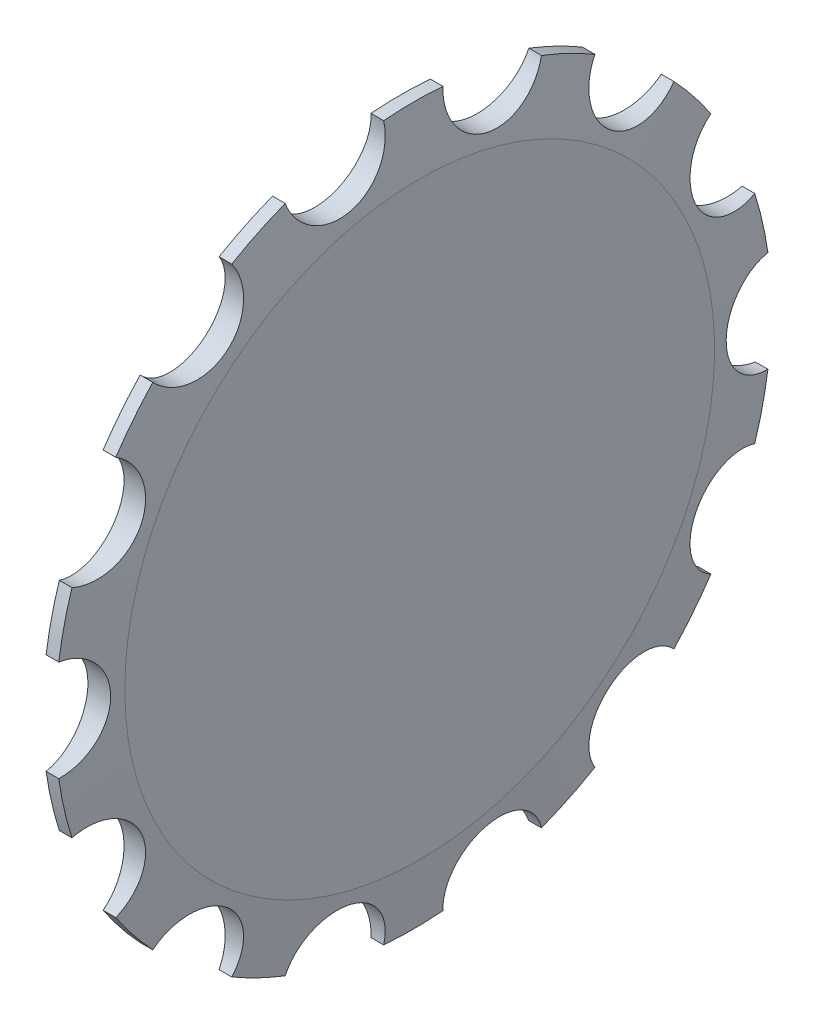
ISO-10303-21;
HEADER;
FILE_DESCRIPTION(('STEP AP214'),'2;1');
FILE_NAME('part.step','',(''),(''),'','','');
FILE_SCHEMA(('AUTOMOTIVE_DESIGN { 1 0 10303 214 1 1 1 1 }'));
ENDSEC;
DATA;
#1=APPLICATION_CONTEXT('core data for automotive mechanical design processes');
#2=APPLICATION_PROTOCOL_DEFINITION('international standard','automotive_design',2000,#1);
#3=PRODUCT_CONTEXT('',#1,'mechanical');
#4=PRODUCT('Part','Part','',(#3));
#5=PRODUCT_RELATED_PRODUCT_CATEGORY('part','',(#4));
#6=PRODUCT_DEFINITION_FORMATION('','',#4);
#7=PRODUCT_DEFINITION_CONTEXT('part definition',#1,'design');
#8=PRODUCT_DEFINITION('design','',#6,#7);
#9=PRODUCT_DEFINITION_SHAPE('','',#8);
#10=(LENGTH_UNIT() NAMED_UNIT(*) SI_UNIT(.MILLI.,.METRE.));
#11=(NAMED_UNIT(*) PLANE_ANGLE_UNIT() SI_UNIT($,.RADIAN.));
#12=(NAMED_UNIT(*) SI_UNIT($,.STERADIAN.) SOLID_ANGLE_UNIT());
#13=UNCERTAINTY_MEASURE_WITH_UNIT(LENGTH_MEASURE(1.E-05),#10,'distance_accuracy_value','');
#14=(GEOMETRIC_REPRESENTATION_CONTEXT(3) GLOBAL_UNCERTAINTY_ASSIGNED_CONTEXT((#13)) GLOBAL_UNIT_ASSIGNED_CONTEXT((#10,
#11,#12)) REPRESENTATION_CONTEXT('',''));
#15=CARTESIAN_POINT('',(0.,0.,0.));
#16=DIRECTION('',(0.,0.,1.));
#17=DIRECTION('',(1.,0.,0.));
#18=AXIS2_PLACEMENT_3D('',#15,#16,#17);
#19=CARTESIAN_POINT('',(-40.,-2.3,0.));
#20=DIRECTION('',(-1.,0.,0.));
#21=DIRECTION('',(0.,0.,1.));
#22=AXIS2_PLACEMENT_3D('',#19,#20,#21);
#23=CYLINDRICAL_SURFACE('',#22,28.3);
#24=CARTESIAN_POINT('',(-0.5,-2.3,0.));
#25=DIRECTION('',(-1.,0.,0.));
#26=DIRECTION('',(0.,0.,1.));
#27=AXIS2_PLACEMENT_3D('',#24,#25,#26);
#28=CIRCLE('',#27,28.3);
#29=CARTESIAN_POINT('',(-0.5,13.4500046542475,23.5122809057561));
#30=VERTEX_POINT('',#29);
#31=CARTESIAN_POINT('',(-0.5,17.1180731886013,20.5870938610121));
#32=VERTEX_POINT('',#31);
#33=EDGE_CURVE('E224',#30,#32,#28,.T.);
#34=ORIENTED_EDGE('',*,*,#33,.F.);
#35=DIRECTION('',(1.,0.,0.));
#36=VECTOR('',#35,1.);
#37=CARTESIAN_POINT('',(0.00415170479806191,13.4500046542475,23.5122809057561));
#38=LINE('',#37,#36);
#39=CARTESIAN_POINT('',(0.500000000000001,13.4500046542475,23.5122809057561));
#40=VERTEX_POINT('',#39);
#41=EDGE_CURVE('E218',#30,#40,#38,.T.);
#42=ORIENTED_EDGE('',*,*,#41,.T.);
#43=CARTESIAN_POINT('',(0.5,-2.3,0.));
#44=DIRECTION('',(-1.,0.,0.));
#45=DIRECTION('',(0.,0.,1.));
#46=AXIS2_PLACEMENT_3D('',#43,#44,#45);
#47=CIRCLE('',#46,28.3);
#48=CARTESIAN_POINT('',(0.5,17.1180731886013,20.5870938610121));
#49=VERTEX_POINT('',#48);
#50=EDGE_CURVE('E56',#40,#49,#47,.T.);
#51=ORIENTED_EDGE('',*,*,#50,.T.);
#52=DIRECTION('',(1.,0.,0.));
#53=VECTOR('',#52,1.);
#54=CARTESIAN_POINT('',(0.00415170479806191,17.1180731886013,20.5870938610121));
#55=LINE('',#54,#53);
#56=EDGE_CURVE('E587',#49,#32,#55,.F.);
#57=ORIENTED_EDGE('',*,*,#56,.T.);
#58=EDGE_LOOP('',(#34,#42,#51,#57));
#59=FACE_BOUND('',#58,.T.);
#60=ADVANCED_FACE('F29',(#59),#23,.T.);
#61=CARTESIAN_POINT('',(-0.5,22.091860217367,14.3501621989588));
#62=VERTEX_POINT('',#61);
#63=CARTESIAN_POINT('',(-0.5,24.1274846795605,10.1231444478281));
#64=VERTEX_POINT('',#63);
#65=EDGE_CURVE('E580',#62,#64,#28,.T.);
#66=ORIENTED_EDGE('',*,*,#65,.F.);
#67=DIRECTION('',(1.,0.,0.));
#68=VECTOR('',#67,1.);
#69=CARTESIAN_POINT('',(0.00415170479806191,22.091860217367,14.3501621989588));
#70=LINE('',#69,#68);
#71=CARTESIAN_POINT('',(0.500000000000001,22.091860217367,14.3501621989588));
#72=VERTEX_POINT('',#71);
#73=EDGE_CURVE('E394',#62,#72,#70,.T.);
#74=ORIENTED_EDGE('',*,*,#73,.T.);
#75=CARTESIAN_POINT('',(0.5,24.1274846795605,10.1231444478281));
#76=VERTEX_POINT('',#75);
#77=EDGE_CURVE('E232',#72,#76,#47,.T.);
#78=ORIENTED_EDGE('',*,*,#77,.T.);
#79=DIRECTION('',(1.,0.,0.));
#80=VECTOR('',#79,1.);
#81=CARTESIAN_POINT('',(0.00415170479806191,24.1274846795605,10.1231444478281));
#82=LINE('',#81,#80);
#83=EDGE_CURVE('E393',#76,#64,#82,.F.);
#84=ORIENTED_EDGE('',*,*,#83,.T.);
#85=EDGE_LOOP('',(#66,#74,#78,#84));
#86=FACE_BOUND('',#85,.T.);
#87=ADVANCED_FACE('F511',(#86),#23,.T.);
#88=CARTESIAN_POINT('',(-0.5,25.9026087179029,2.34581787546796));
#89=VERTEX_POINT('',#88);
#90=CARTESIAN_POINT('',(-0.5,25.902608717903,-2.34581787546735));
#91=VERTEX_POINT('',#90);
#92=EDGE_CURVE('E576',#89,#91,#28,.T.);
#93=ORIENTED_EDGE('',*,*,#92,.F.);
#94=DIRECTION('',(1.,0.,0.));
#95=VECTOR('',#94,1.);
#96=CARTESIAN_POINT('',(0.00415170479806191,25.9026087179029,2.34581787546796));
#97=LINE('',#96,#95);
#98=CARTESIAN_POINT('',(0.500000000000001,25.9026087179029,2.34581787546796));
#99=VERTEX_POINT('',#98);
#100=EDGE_CURVE('E660',#89,#99,#97,.T.);
#101=ORIENTED_EDGE('',*,*,#100,.T.);
#102=CARTESIAN_POINT('',(0.5,25.902608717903,-2.34581787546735));
#103=VERTEX_POINT('',#102);
#104=EDGE_CURVE('E236',#99,#103,#47,.T.);
#105=ORIENTED_EDGE('',*,*,#104,.T.);
#106=DIRECTION('',(1.,0.,0.));
#107=VECTOR('',#106,1.);
#108=CARTESIAN_POINT('',(0.00415170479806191,25.902608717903,-2.34581787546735));
#109=LINE('',#108,#107);
#110=EDGE_CURVE('E655',#103,#91,#109,.F.);
#111=ORIENTED_EDGE('',*,*,#110,.T.);
#112=EDGE_LOOP('',(#93,#101,#105,#111));
#113=FACE_BOUND('',#112,.T.);
#114=ADVANCED_FACE('F515',(#113),#23,.T.);
#115=CARTESIAN_POINT('',(-0.5,24.1274846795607,-10.1231444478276));
#116=VERTEX_POINT('',#115);
#117=CARTESIAN_POINT('',(-0.5,22.0918602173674,-14.3501621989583));
#118=VERTEX_POINT('',#117);
#119=EDGE_CURVE('E572',#116,#118,#28,.T.);
#120=ORIENTED_EDGE('',*,*,#119,.F.);
#121=DIRECTION('',(1.,0.,0.));
#122=VECTOR('',#121,1.);
#123=CARTESIAN_POINT('',(0.00415170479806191,24.1274846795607,-10.1231444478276));
#124=LINE('',#123,#122);
#125=CARTESIAN_POINT('',(0.500000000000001,24.1274846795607,-10.1231444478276));
#126=VERTEX_POINT('',#125);
#127=EDGE_CURVE('E653',#116,#126,#124,.T.);
#128=ORIENTED_EDGE('',*,*,#127,.T.);
#129=CARTESIAN_POINT('',(0.5,22.0918602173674,-14.3501621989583));
#130=VERTEX_POINT('',#129);
#131=EDGE_CURVE('E666',#126,#130,#47,.T.);
#132=ORIENTED_EDGE('',*,*,#131,.T.);
#133=DIRECTION('',(1.,0.,0.));
#134=VECTOR('',#133,1.);
#135=CARTESIAN_POINT('',(0.00415170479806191,22.0918602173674,-14.3501621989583));
#136=LINE('',#135,#134);
#137=EDGE_CURVE('E648',#130,#118,#136,.F.);
#138=ORIENTED_EDGE('',*,*,#137,.T.);
#139=EDGE_LOOP('',(#120,#128,#132,#138));
#140=FACE_BOUND('',#139,.T.);
#141=ADVANCED_FACE('F757',(#140),#23,.T.);
#142=CARTESIAN_POINT('',(-0.5,17.1180731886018,-20.5870938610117));
#143=VERTEX_POINT('',#142);
#144=CARTESIAN_POINT('',(-0.5,13.450004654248,-23.5122809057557));
#145=VERTEX_POINT('',#144);
#146=EDGE_CURVE('E568',#143,#145,#28,.T.);
#147=ORIENTED_EDGE('',*,*,#146,.F.);
#148=DIRECTION('',(1.,0.,0.));
#149=VECTOR('',#148,1.);
#150=CARTESIAN_POINT('',(0.00415170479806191,17.1180731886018,-20.5870938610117));
#151=LINE('',#150,#149);
#152=CARTESIAN_POINT('',(0.500000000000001,17.1180731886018,-20.5870938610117));
#153=VERTEX_POINT('',#152);
#154=EDGE_CURVE('E646',#143,#153,#151,.T.);
#155=ORIENTED_EDGE('',*,*,#154,.T.);
#156=CARTESIAN_POINT('',(0.5,13.450004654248,-23.5122809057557));
#157=VERTEX_POINT('',#156);
#158=EDGE_CURVE('E667',#153,#157,#47,.T.);
#159=ORIENTED_EDGE('',*,*,#158,.T.);
#160=DIRECTION('',(1.,0.,0.));
#161=VECTOR('',#160,1.);
#162=CARTESIAN_POINT('',(0.00415170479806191,13.450004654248,-23.5122809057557));
#163=LINE('',#162,#161);
#164=EDGE_CURVE('E641',#157,#145,#163,.F.);
#165=ORIENTED_EDGE('',*,*,#164,.T.);
#166=EDGE_LOOP('',(#147,#155,#159,#165));
#167=FACE_BOUND('',#166,.T.);
#168=ADVANCED_FACE('F763',(#167),#23,.T.);
#169=CARTESIAN_POINT('',(-0.5,6.26267415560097,-26.9735168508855));
#170=VERTEX_POINT('',#169);
#171=CARTESIAN_POINT('',(-0.5,1.68866750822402,-28.0175040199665));
#172=VERTEX_POINT('',#171);
#173=EDGE_CURVE('E564',#170,#172,#28,.T.);
#174=ORIENTED_EDGE('',*,*,#173,.F.);
#175=DIRECTION('',(1.,0.,0.));
#176=VECTOR('',#175,1.);
#177=CARTESIAN_POINT('',(0.00415170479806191,6.26267415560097,-26.9735168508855));
#178=LINE('',#177,#176);
#179=CARTESIAN_POINT('',(0.500000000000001,6.26267415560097,-26.9735168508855));
#180=VERTEX_POINT('',#179);
#181=EDGE_CURVE('E639',#170,#180,#178,.T.);
#182=ORIENTED_EDGE('',*,*,#181,.T.);
#183=CARTESIAN_POINT('',(0.5,1.68866750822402,-28.0175040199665));
#184=VERTEX_POINT('',#183);
#185=EDGE_CURVE('E668',#180,#184,#47,.T.);
#186=ORIENTED_EDGE('',*,*,#185,.T.);
#187=DIRECTION('',(1.,0.,0.));
#188=VECTOR('',#187,1.);
#189=CARTESIAN_POINT('',(0.00415170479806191,1.68866750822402,-28.0175040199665));
#190=LINE('',#189,#188);
#191=EDGE_CURVE('E634',#184,#172,#190,.F.);
#192=ORIENTED_EDGE('',*,*,#191,.T.);
#193=EDGE_LOOP('',(#174,#182,#186,#192));
#194=FACE_BOUND('',#193,.T.);
#195=ADVANCED_FACE('F769',(#194),#23,.T.);
#196=CARTESIAN_POINT('',(-0.5,-6.28866750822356,-28.0175040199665));
#197=VERTEX_POINT('',#196);
#198=CARTESIAN_POINT('',(-0.5,-10.8626741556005,-26.9735168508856));
#199=VERTEX_POINT('',#198);
#200=EDGE_CURVE('E560',#197,#199,#28,.T.);
#201=ORIENTED_EDGE('',*,*,#200,.F.);
#202=DIRECTION('',(1.,0.,0.));
#203=VECTOR('',#202,1.);
#204=CARTESIAN_POINT('',(0.00415170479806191,-6.28866750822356,-28.0175040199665));
#205=LINE('',#204,#203);
#206=CARTESIAN_POINT('',(0.500000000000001,-6.28866750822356,-28.0175040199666));
#207=VERTEX_POINT('',#206);
#208=EDGE_CURVE('E632',#197,#207,#205,.T.);
#209=ORIENTED_EDGE('',*,*,#208,.T.);
#210=CARTESIAN_POINT('',(0.5,-10.8626741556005,-26.9735168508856));
#211=VERTEX_POINT('',#210);
#212=EDGE_CURVE('E669',#207,#211,#47,.T.);
#213=ORIENTED_EDGE('',*,*,#212,.T.);
#214=DIRECTION('',(1.,0.,0.));
#215=VECTOR('',#214,1.);
#216=CARTESIAN_POINT('',(0.00415170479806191,-10.8626741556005,-26.9735168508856));
#217=LINE('',#216,#215);
#218=EDGE_CURVE('E627',#211,#199,#217,.F.);
#219=ORIENTED_EDGE('',*,*,#218,.T.);
#220=EDGE_LOOP('',(#201,#209,#213,#219));
#221=FACE_BOUND('',#220,.T.);
#222=ADVANCED_FACE('F775',(#221),#23,.T.);
#223=CARTESIAN_POINT('',(-0.5,-18.0500046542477,-23.512280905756));
#224=VERTEX_POINT('',#223);
#225=CARTESIAN_POINT('',(-0.5,-21.7180731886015,-20.587093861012));
#226=VERTEX_POINT('',#225);
#227=EDGE_CURVE('E556',#224,#226,#28,.T.);
#228=ORIENTED_EDGE('',*,*,#227,.F.);
#229=DIRECTION('',(1.,0.,0.));
#230=VECTOR('',#229,1.);
#231=CARTESIAN_POINT('',(0.00415170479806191,-18.0500046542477,-23.512280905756));
#232=LINE('',#231,#230);
#233=CARTESIAN_POINT('',(0.500000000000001,-18.0500046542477,-23.512280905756));
#234=VERTEX_POINT('',#233);
#235=EDGE_CURVE('E625',#224,#234,#232,.T.);
#236=ORIENTED_EDGE('',*,*,#235,.T.);
#237=CARTESIAN_POINT('',(0.5,-21.7180731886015,-20.587093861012));
#238=VERTEX_POINT('',#237);
#239=EDGE_CURVE('E670',#234,#238,#47,.T.);
#240=ORIENTED_EDGE('',*,*,#239,.T.);
#241=DIRECTION('',(1.,0.,0.));
#242=VECTOR('',#241,1.);
#243=CARTESIAN_POINT('',(0.00415170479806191,-21.7180731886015,-20.587093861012));
#244=LINE('',#243,#242);
#245=EDGE_CURVE('E620',#238,#226,#244,.F.);
#246=ORIENTED_EDGE('',*,*,#245,.T.);
#247=EDGE_LOOP('',(#228,#236,#240,#246));
#248=FACE_BOUND('',#247,.T.);
#249=ADVANCED_FACE('F781',(#248),#23,.T.);
#250=CARTESIAN_POINT('',(-0.5,-26.6918602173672,-14.3501621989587));
#251=VERTEX_POINT('',#250);
#252=CARTESIAN_POINT('',(-0.5,-28.7274846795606,-10.123144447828));
#253=VERTEX_POINT('',#252);
#254=EDGE_CURVE('E552',#251,#253,#28,.T.);
#255=ORIENTED_EDGE('',*,*,#254,.F.);
#256=DIRECTION('',(1.,0.,0.));
#257=VECTOR('',#256,1.);
#258=CARTESIAN_POINT('',(0.00415170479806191,-26.6918602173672,-14.3501621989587));
#259=LINE('',#258,#257);
#260=CARTESIAN_POINT('',(0.500000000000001,-26.6918602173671,-14.3501621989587));
#261=VERTEX_POINT('',#260);
#262=EDGE_CURVE('E618',#251,#261,#259,.T.);
#263=ORIENTED_EDGE('',*,*,#262,.T.);
#264=CARTESIAN_POINT('',(0.5,-28.7274846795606,-10.123144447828));
#265=VERTEX_POINT('',#264);
#266=EDGE_CURVE('E671',#261,#265,#47,.T.);
#267=ORIENTED_EDGE('',*,*,#266,.T.);
#268=DIRECTION('',(1.,0.,0.));
#269=VECTOR('',#268,1.);
#270=CARTESIAN_POINT('',(0.00415170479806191,-28.7274846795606,-10.123144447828));
#271=LINE('',#270,#269);
#272=EDGE_CURVE('E613',#265,#253,#271,.F.);
#273=ORIENTED_EDGE('',*,*,#272,.T.);
#274=EDGE_LOOP('',(#255,#263,#267,#273));
#275=FACE_BOUND('',#274,.T.);
#276=ADVANCED_FACE('F787',(#275),#23,.T.);
#277=CARTESIAN_POINT('',(-0.5,-30.502608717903,-2.34581787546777));
#278=VERTEX_POINT('',#277);
#279=CARTESIAN_POINT('',(-0.5,-30.502608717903,2.34581787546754));
#280=VERTEX_POINT('',#279);
#281=EDGE_CURVE('E548',#278,#280,#28,.T.);
#282=ORIENTED_EDGE('',*,*,#281,.F.);
#283=DIRECTION('',(1.,0.,0.));
#284=VECTOR('',#283,1.);
#285=CARTESIAN_POINT('',(0.00415170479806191,-30.502608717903,-2.34581787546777));
#286=LINE('',#285,#284);
#287=CARTESIAN_POINT('',(0.500000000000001,-30.502608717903,-2.34581787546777));
#288=VERTEX_POINT('',#287);
#289=EDGE_CURVE('E611',#278,#288,#286,.T.);
#290=ORIENTED_EDGE('',*,*,#289,.T.);
#291=CARTESIAN_POINT('',(0.5,-30.502608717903,2.34581787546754));
#292=VERTEX_POINT('',#291);
#293=EDGE_CURVE('E672',#288,#292,#47,.T.);
#294=ORIENTED_EDGE('',*,*,#293,.T.);
#295=DIRECTION('',(1.,0.,0.));
#296=VECTOR('',#295,1.);
#297=CARTESIAN_POINT('',(0.00415170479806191,-30.502608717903,2.34581787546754));
#298=LINE('',#297,#296);
#299=EDGE_CURVE('E606',#292,#280,#298,.F.);
#300=ORIENTED_EDGE('',*,*,#299,.T.);
#301=EDGE_LOOP('',(#282,#290,#294,#300));
#302=FACE_BOUND('',#301,.T.);
#303=ADVANCED_FACE('F793',(#302),#23,.T.);
#304=CARTESIAN_POINT('',(-0.5,-28.7274846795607,10.1231444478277));
#305=VERTEX_POINT('',#304);
#306=CARTESIAN_POINT('',(-0.5,-26.6918602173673,14.3501621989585));
#307=VERTEX_POINT('',#306);
#308=EDGE_CURVE('E544',#305,#307,#28,.T.);
#309=ORIENTED_EDGE('',*,*,#308,.F.);
#310=DIRECTION('',(1.,0.,0.));
#311=VECTOR('',#310,1.);
#312=CARTESIAN_POINT('',(0.00415170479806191,-28.7274846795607,10.1231444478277));
#313=LINE('',#312,#311);
#314=CARTESIAN_POINT('',(0.500000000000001,-28.7274846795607,10.1231444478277));
#315=VERTEX_POINT('',#314);
#316=EDGE_CURVE('E604',#305,#315,#313,.T.);
#317=ORIENTED_EDGE('',*,*,#316,.T.);
#318=CARTESIAN_POINT('',(0.5,-26.6918602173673,14.3501621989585));
#319=VERTEX_POINT('',#318);
#320=EDGE_CURVE('E673',#315,#319,#47,.T.);
#321=ORIENTED_EDGE('',*,*,#320,.T.);
#322=DIRECTION('',(1.,0.,0.));
#323=VECTOR('',#322,1.);
#324=CARTESIAN_POINT('',(0.00415170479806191,-26.6918602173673,14.3501621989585));
#325=LINE('',#324,#323);
#326=EDGE_CURVE('E600',#319,#307,#325,.F.);
#327=ORIENTED_EDGE('',*,*,#326,.T.);
#328=EDGE_LOOP('',(#309,#317,#321,#327));
#329=FACE_BOUND('',#328,.T.);
#330=ADVANCED_FACE('F531',(#329),#23,.T.);
#331=CARTESIAN_POINT('',(-0.5,-21.7180731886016,20.5870938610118));
#332=VERTEX_POINT('',#331);
#333=CARTESIAN_POINT('',(-0.5,-18.0500046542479,23.5122809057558));
#334=VERTEX_POINT('',#333);
#335=EDGE_CURVE('E543',#332,#334,#28,.T.);
#336=ORIENTED_EDGE('',*,*,#335,.F.);
#337=DIRECTION('',(1.,0.,0.));
#338=VECTOR('',#337,1.);
#339=CARTESIAN_POINT('',(0.00415170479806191,-21.7180731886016,20.5870938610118));
#340=LINE('',#339,#338);
#341=CARTESIAN_POINT('',(0.500000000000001,-21.7180731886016,20.5870938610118));
#342=VERTEX_POINT('',#341);
#343=EDGE_CURVE('E598',#332,#342,#340,.T.);
#344=ORIENTED_EDGE('',*,*,#343,.T.);
#345=CARTESIAN_POINT('',(0.5,-18.0500046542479,23.5122809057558));
#346=VERTEX_POINT('',#345);
#347=EDGE_CURVE('E674',#342,#346,#47,.T.);
#348=ORIENTED_EDGE('',*,*,#347,.T.);
#349=DIRECTION('',(1.,0.,0.));
#350=VECTOR('',#349,1.);
#351=CARTESIAN_POINT('',(0.00415170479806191,-18.0500046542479,23.5122809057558));
#352=LINE('',#351,#350);
#353=EDGE_CURVE('E595',#346,#334,#352,.F.);
#354=ORIENTED_EDGE('',*,*,#353,.T.);
#355=EDGE_LOOP('',(#336,#344,#348,#354));
#356=FACE_BOUND('',#355,.T.);
#357=ADVANCED_FACE('F524',(#356),#23,.T.);
#358=CARTESIAN_POINT('',(-0.5,-10.8626741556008,26.9735168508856));
#359=VERTEX_POINT('',#358);
#360=CARTESIAN_POINT('',(-0.5,-6.2886675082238,28.0175040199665));
#361=VERTEX_POINT('',#360);
#362=EDGE_CURVE('E234',#359,#361,#28,.T.);
#363=ORIENTED_EDGE('',*,*,#362,.F.);
#364=DIRECTION('',(1.,0.,0.));
#365=VECTOR('',#364,1.);
#366=CARTESIAN_POINT('',(0.00415170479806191,-10.8626741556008,26.9735168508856));
#367=LINE('',#366,#365);
#368=CARTESIAN_POINT('',(0.500000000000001,-10.8626741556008,26.9735168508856));
#369=VERTEX_POINT('',#368);
#370=EDGE_CURVE('E536',#359,#369,#367,.T.);
#371=ORIENTED_EDGE('',*,*,#370,.T.);
#372=CARTESIAN_POINT('',(0.5,-6.28866750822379,28.0175040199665));
#373=VERTEX_POINT('',#372);
#374=EDGE_CURVE('E235',#369,#373,#47,.T.);
#375=ORIENTED_EDGE('',*,*,#374,.T.);
#376=DIRECTION('',(1.,0.,0.));
#377=VECTOR('',#376,1.);
#378=CARTESIAN_POINT('',(0.00415170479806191,-6.2886675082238,28.0175040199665));
#379=LINE('',#378,#377);
#380=EDGE_CURVE('E539',#373,#361,#379,.F.);
#381=ORIENTED_EDGE('',*,*,#380,.T.);
#382=EDGE_LOOP('',(#363,#371,#375,#381));
#383=FACE_BOUND('',#382,.T.);
#384=ADVANCED_FACE('F519',(#383),#23,.T.);
#385=CARTESIAN_POINT('',(-0.995848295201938,-2.3,0.));
#386=DIRECTION('',(1.,0.,0.));
#387=DIRECTION('',(0.,0.,-1.));
#388=AXIS2_PLACEMENT_3D('',#385,#386,#387);
#389=PLANE('',#388);
#390=CARTESIAN_POINT('',(-0.995848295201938,-2.3,0.));
#391=DIRECTION('',(-1.,0.,0.));
#392=DIRECTION('',(0.,0.,1.));
#393=AXIS2_PLACEMENT_3D('',#390,#391,#392);
#394=CIRCLE('',#393,23.3);
#395=CARTESIAN_POINT('',(-0.995848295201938,-2.3,23.3));
#396=VERTEX_POINT('',#395);
#397=EDGE_CURVE('E244',#396,#396,#394,.T.);
#398=ORIENTED_EDGE('',*,*,#397,.T.);
#399=EDGE_LOOP('',(#398));
#400=FACE_BOUND('',#399,.T.);
#401=ADVANCED_FACE('F31',(#400),#389,.F.);
#402=CARTESIAN_POINT('',(-0.5,-2.3,0.));
#403=DIRECTION('',(1.,0.,0.));
#404=DIRECTION('',(0.,0.,-1.));
#405=AXIS2_PLACEMENT_3D('',#402,#403,#404);
#406=CONICAL_SURFACE('',#405,28.3,1.47194986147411);
#407=ORIENTED_EDGE('',*,*,#397,.F.);
#408=EDGE_LOOP('',(#407));
#409=FACE_BOUND('',#408,.T.);
#410=CARTESIAN_POINT('',(-0.5,1.68866750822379,28.0175040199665));
#411=VERTEX_POINT('',#410);
#412=CARTESIAN_POINT('',(-0.5,6.26267415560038,26.9735168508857));
#413=VERTEX_POINT('',#412);
#414=EDGE_CURVE('E241',#411,#413,#28,.T.);
#415=ORIENTED_EDGE('',*,*,#414,.T.);
#416=CARTESIAN_POINT('',(-0.4998,6.26341213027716,26.9753985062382));
#417=CARTESIAN_POINT('',(-0.510975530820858,6.22213666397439,26.8702629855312));
#418=CARTESIAN_POINT('',(-0.522182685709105,6.18533690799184,26.7633796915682));
#419=CARTESIAN_POINT('',(-0.544579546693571,6.12090230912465,26.5468881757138));
#420=CARTESIAN_POINT('',(-0.555769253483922,6.09326709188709,26.4372800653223));
#421=CARTESIAN_POINT('',(-0.578045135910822,6.04738465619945,26.2161634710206));
#422=CARTESIAN_POINT('',(-0.589131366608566,6.02913212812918,26.1046560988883));
#423=CARTESIAN_POINT('',(-0.611118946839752,6.00211485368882,25.8805121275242));
#424=CARTESIAN_POINT('',(-0.622020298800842,5.99334998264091,25.7678755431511));
#425=CARTESIAN_POINT('',(-0.654331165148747,5.98142705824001,25.4293327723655));
#426=CARTESIAN_POINT('',(-0.675356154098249,5.99262293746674,25.2027076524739));
#427=CARTESIAN_POINT('',(-0.715618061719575,6.05312102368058,24.7546122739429));
#428=CARTESIAN_POINT('',(-0.734855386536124,6.10241455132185,24.5331408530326));
#429=CARTESIAN_POINT('',(-0.770829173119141,6.23762374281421,24.1019177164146));
#430=CARTESIAN_POINT('',(-0.787570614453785,6.32346513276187,23.8921432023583));
#431=CARTESIAN_POINT('',(-0.817944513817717,6.52942529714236,23.4898758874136));
#432=CARTESIAN_POINT('',(-0.831576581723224,6.64954836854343,23.2973852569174));
#433=CARTESIAN_POINT('',(-0.855095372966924,6.91995414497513,22.9362916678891));
#434=CARTESIAN_POINT('',(-0.865002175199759,7.07006828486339,22.7675638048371));
#435=CARTESIAN_POINT('',(-0.88074096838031,7.39661755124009,22.4576554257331));
#436=CARTESIAN_POINT('',(-0.886573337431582,7.57305023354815,22.3164723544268));
#437=CARTESIAN_POINT('',(-0.893879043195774,7.94615749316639,22.0664409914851));
#438=CARTESIAN_POINT('',(-0.895376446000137,8.14271401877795,21.9574172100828));
#439=CARTESIAN_POINT('',(-0.894012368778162,8.55127544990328,21.7737759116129));
#440=CARTESIAN_POINT('',(-0.89115095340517,8.76328012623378,21.6991578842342));
#441=CARTESIAN_POINT('',(-0.881211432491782,9.19618834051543,21.5865568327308));
#442=CARTESIAN_POINT('',(-0.8741429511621,9.41707049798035,21.5484907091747));
#443=CARTESIAN_POINT('',(-0.856110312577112,9.86193870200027,21.5097082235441));
#444=CARTESIAN_POINT('',(-0.845145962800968,10.0859249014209,21.5089937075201));
#445=CARTESIAN_POINT('',(-0.819752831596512,10.5312825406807,21.5448964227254));
#446=CARTESIAN_POINT('',(-0.805314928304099,10.752645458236,21.5816127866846));
#447=CARTESIAN_POINT('',(-0.773570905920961,11.1859316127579,21.6913902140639));
#448=CARTESIAN_POINT('',(-0.756264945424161,11.3978553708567,21.7644492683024));
#449=CARTESIAN_POINT('',(-0.719324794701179,11.807570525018,21.9452968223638));
#450=CARTESIAN_POINT('',(-0.699677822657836,12.0052739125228,22.0532820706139));
#451=CARTESIAN_POINT('',(-0.658821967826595,12.3796896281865,22.3007542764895));
#452=CARTESIAN_POINT('',(-0.637613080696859,12.5564018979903,22.4402413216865));
#453=CARTESIAN_POINT('',(-0.596977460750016,12.8637942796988,22.7279300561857));
#454=CARTESIAN_POINT('',(-0.5776517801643,12.997462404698,22.8729572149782));
#455=CARTESIAN_POINT('',(-0.548507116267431,13.1807991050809,23.1038792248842));
#456=CARTESIAN_POINT('',(-0.538765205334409,13.2390554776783,23.1830921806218));
#457=CARTESIAN_POINT('',(-0.51927528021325,13.3495880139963,23.345599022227));
#458=CARTESIAN_POINT('',(-0.509527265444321,13.401863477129,23.4288933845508));
#459=CARTESIAN_POINT('',(-0.499799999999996,13.4510156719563,23.5140310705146));
#460=B_SPLINE_CURVE_WITH_KNOTS('',3,(#416,#417,#418,#419,#420,#421,#422,#423,#424,#425,#426,
#427,#428,#429,#430,#431,#432,#433,#434,#435,#436,#437,#438,#439,#440,#441,#442,#443,#444,#445,
#446,#447,#448,#449,#450,#451,#452,#453,#454,#455,#456,#457,#458,#459),.UNSPECIFIED.,.F.,.F.,(4,
2,2,2,2,2,2,2,2,2,2,2,2,2,2,2,2,2,2,2,2,4),(0.,0.340386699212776,0.680759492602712,
1.0209394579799,1.36111495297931,2.0412047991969,2.72113975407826,3.39969946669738,
4.07834426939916,4.75327693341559,5.42814695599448,6.09926310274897,6.77036929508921,
7.43994611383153,8.10955602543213,8.78094396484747,9.45229479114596,10.1274953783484,
10.8026978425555,11.3949708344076,11.6911676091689,11.9873990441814),.UNSPECIFIED.);
#461=EDGE_CURVE('E225',#413,#30,#460,.T.);
#462=ORIENTED_EDGE('',*,*,#461,.T.);
#463=ORIENTED_EDGE('',*,*,#33,.T.);
#464=CARTESIAN_POINT('',(-0.233205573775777,19.8677601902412,21.6561315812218));
#465=CARTESIAN_POINT('',(-0.24113321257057,19.7552362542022,21.6569186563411));
#466=CARTESIAN_POINT('',(-0.249361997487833,19.642703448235,21.6529338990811));
#467=CARTESIAN_POINT('',(-0.266373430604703,19.418416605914,21.6355126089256));
#468=CARTESIAN_POINT('',(-0.275156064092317,19.3066625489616,21.6220763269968));
#469=CARTESIAN_POINT('',(-0.293242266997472,19.0845385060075,21.5858136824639));
#470=CARTESIAN_POINT('',(-0.302546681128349,18.9741711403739,21.5629716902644));
#471=CARTESIAN_POINT('',(-0.321609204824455,18.755798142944,21.5080739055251));
#472=CARTESIAN_POINT('',(-0.331367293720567,18.6477924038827,21.4760185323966));
#473=CARTESIAN_POINT('',(-0.351337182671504,18.434296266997,21.4027213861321));
#474=CARTESIAN_POINT('',(-0.361551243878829,18.328823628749,21.361428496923));
#475=CARTESIAN_POINT('',(-0.382319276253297,18.1217857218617,21.2700648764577));
#476=CARTESIAN_POINT('',(-0.39287324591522,18.0202204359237,21.219994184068));
#477=CARTESIAN_POINT('',(-0.414226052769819,17.8219923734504,21.1115898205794));
#478=CARTESIAN_POINT('',(-0.425024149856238,17.7253170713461,21.0532788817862));
#479=CARTESIAN_POINT('',(-0.446819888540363,17.5372957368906,20.9287332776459));
#480=CARTESIAN_POINT('',(-0.457817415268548,17.4459467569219,20.862503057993));
#481=CARTESIAN_POINT('',(-0.474008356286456,17.3165961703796,20.7601143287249));
#482=CARTESIAN_POINT('',(-0.479152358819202,17.2762510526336,20.7268710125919));
#483=CARTESIAN_POINT('',(-0.489461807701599,17.1968909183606,20.6588268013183));
#484=CARTESIAN_POINT('',(-0.494627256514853,17.1578760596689,20.6240257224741));
#485=CARTESIAN_POINT('',(-0.510954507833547,17.0369178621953,20.5117943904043));
#486=CARTESIAN_POINT('',(-0.522142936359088,16.9575051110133,20.4316059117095));
#487=CARTESIAN_POINT('',(-0.544508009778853,16.8057037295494,20.2647736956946));
#488=CARTESIAN_POINT('',(-0.555684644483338,16.7333190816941,20.1781263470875));
#489=CARTESIAN_POINT('',(-0.57796207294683,16.5959933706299,19.9988400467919));
#490=CARTESIAN_POINT('',(-0.589062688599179,16.5310662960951,19.9061903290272));
#491=CARTESIAN_POINT('',(-0.611082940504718,16.4092675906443,19.7157058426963));
#492=CARTESIAN_POINT('',(-0.622002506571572,16.3523990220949,19.6178691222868));
#493=CARTESIAN_POINT('',(-0.654334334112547,16.1946667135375,19.3178311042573));
#494=CARTESIAN_POINT('',(-0.675362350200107,16.1064142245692,19.1087590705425));
#495=CARTESIAN_POINT('',(-0.715623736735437,15.966510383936,18.6787864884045));
#496=CARTESIAN_POINT('',(-0.734858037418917,15.9148399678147,18.4578921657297));
#497=CARTESIAN_POINT('',(-0.770829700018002,15.8495624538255,18.0107348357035));
#498=CARTESIAN_POINT('',(-0.787571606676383,15.8358852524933,17.7844824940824));
#499=CARTESIAN_POINT('',(-0.817945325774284,15.8469139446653,17.3326894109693));
#500=CARTESIAN_POINT('',(-0.831576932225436,15.8716223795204,17.1071487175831));
#501=CARTESIAN_POINT('',(-0.855095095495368,15.9585746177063,16.6645017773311));
#502=CARTESIAN_POINT('',(-0.865001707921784,16.020612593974,16.4473561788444));
#503=CARTESIAN_POINT('',(-0.880740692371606,16.1803574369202,16.0264533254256));
#504=CARTESIAN_POINT('',(-0.886573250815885,16.2780626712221,15.8226954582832));
#505=CARTESIAN_POINT('',(-0.893879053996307,16.5057391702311,15.4355346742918));
#506=CARTESIAN_POINT('',(-0.895376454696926,16.6355272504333,15.2520244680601));
#507=CARTESIAN_POINT('',(-0.89401235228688,16.9239495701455,14.9093013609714));
#508=CARTESIAN_POINT('',(-0.891150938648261,17.0825832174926,14.7500879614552));
#509=CARTESIAN_POINT('',(-0.881211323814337,17.4237675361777,14.4608033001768));
#510=CARTESIAN_POINT('',(-0.874142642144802,17.6062634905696,14.330667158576));
#511=CARTESIAN_POINT('',(-0.856109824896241,17.9902497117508,14.1027057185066));
#512=CARTESIAN_POINT('',(-0.845145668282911,18.1917400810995,14.0048805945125));
#513=CARTESIAN_POINT('',(-0.819753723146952,18.6085517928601,13.8440015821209));
#514=CARTESIAN_POINT('',(-0.805316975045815,18.8239078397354,13.781039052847));
#515=CARTESIAN_POINT('',(-0.773573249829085,19.2619156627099,13.6919447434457));
#516=CARTESIAN_POINT('',(-0.756266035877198,19.484568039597,13.6658160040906));
#517=CARTESIAN_POINT('',(-0.719322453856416,19.9322182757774,13.6509817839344));
#518=CARTESIAN_POINT('',(-0.699673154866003,20.1572222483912,13.662494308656));
#519=CARTESIAN_POINT('',(-0.658815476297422,20.6019441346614,13.7230237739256));
#520=CARTESIAN_POINT('',(-0.637607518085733,20.8216634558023,13.7720306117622));
#521=CARTESIAN_POINT('',(-0.59698007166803,21.2233626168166,13.8978205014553));
#522=CARTESIAN_POINT('',(-0.577660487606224,21.4066648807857,13.9704569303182));
#523=CARTESIAN_POINT('',(-0.538795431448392,21.7605417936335,14.1418372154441));
#524=CARTESIAN_POINT('',(-0.519250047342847,21.9311212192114,14.2405712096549));
#525=CARTESIAN_POINT('',(-0.479753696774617,22.2609185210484,14.4654240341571));
#526=CARTESIAN_POINT('',(-0.459808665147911,22.4196277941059,14.5922895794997));
#527=CARTESIAN_POINT('',(-0.420534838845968,22.7161538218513,14.8687550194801));
#528=CARTESIAN_POINT('',(-0.401206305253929,22.8539618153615,15.0183643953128));
#529=CARTESIAN_POINT('',(-0.371926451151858,23.0495922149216,15.2661122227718));
#530=CARTESIAN_POINT('',(-0.361612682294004,23.1158119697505,15.3577078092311));
#531=CARTESIAN_POINT('',(-0.341361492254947,23.2403053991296,15.5462302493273));
#532=CARTESIAN_POINT('',(-0.331424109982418,23.2985782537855,15.6431576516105));
#533=CARTESIAN_POINT('',(-0.311975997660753,23.4067919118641,15.841762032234));
#534=CARTESIAN_POINT('',(-0.302465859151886,23.4567214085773,15.9434452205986));
#535=CARTESIAN_POINT('',(-0.283940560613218,23.5478021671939,16.150710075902));
#536=CARTESIAN_POINT('',(-0.274925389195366,23.5889536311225,16.2562916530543));
#537=CARTESIAN_POINT('',(-0.2661845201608,23.6255418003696,16.3634597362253));
#538=B_SPLINE_CURVE_WITH_KNOTS('',3,(#464,#465,#466,#467,#468,#469,#470,#471,#472,#473,#474,
#475,#476,#477,#478,#479,#480,#481,#482,#483,#484,#485,#486,#487,#488,#489,#490,#491,#492,#493,
#494,#495,#496,#497,#498,#499,#500,#501,#502,#503,#504,#505,#506,#507,#508,#509,#510,#511,#512,
#513,#514,#515,#516,#517,#518,#519,#520,#521,#522,#523,#524,#525,#526,#527,#528,#529,#530,#531,
#532,#533,#534,#535,#536,#537),.UNSPECIFIED.,.F.,.F.,(4,2,2,2,2,2,2,2,2,2,2,2,2,2,2,2,2,2,2,2,2,
2,2,2,2,2,2,2,2,2,2,2,2,2,2,2,4),(0.,0.338311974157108,0.676614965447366,1.01548240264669,
1.35433441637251,1.69511001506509,2.03588410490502,2.37573581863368,2.71539763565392,
2.87295132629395,3.03052364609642,3.37031271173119,3.71029320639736,4.05090135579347,
4.39163859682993,5.07182836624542,5.75166339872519,6.43024319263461,7.10886791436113,
7.78378470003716,8.45867060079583,9.12978865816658,9.80089293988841,10.4704844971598,
11.1400796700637,11.811421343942,12.482818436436,13.1581109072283,13.8332214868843,
14.4254846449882,15.0175243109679,15.6277133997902,16.2381575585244,16.5782970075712,
16.9184715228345,17.2591033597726,17.5997273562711),.UNSPECIFIED.);
#539=EDGE_CURVE('E385',#32,#62,#538,.T.);
#540=ORIENTED_EDGE('',*,*,#539,.T.);
#541=ORIENTED_EDGE('',*,*,#65,.T.);
#542=CARTESIAN_POINT('',(-0.499799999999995,24.1294159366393,10.1237406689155));
#543=CARTESIAN_POINT('',(-0.510975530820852,24.0214828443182,10.0904602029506));
#544=CARTESIAN_POINT('',(-0.522182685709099,23.9149738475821,10.0525907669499));
#545=CARTESIAN_POINT('',(-0.544579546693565,23.7055396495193,9.96798751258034));
#546=CARTESIAN_POINT('',(-0.555769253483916,23.6026143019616,9.92125405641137));
#547=CARTESIAN_POINT('',(-0.578045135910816,23.4011311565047,9.81926244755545));
#548=CARTESIAN_POINT('',(-0.58913136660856,23.3025709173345,9.76400913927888));
#549=CARTESIAN_POINT('',(-0.611118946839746,23.110483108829,9.6453806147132));
#550=CARTESIAN_POINT('',(-0.622020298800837,23.0169554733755,9.58200550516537));
#551=CARTESIAN_POINT('',(-0.654331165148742,22.7448382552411,9.38024925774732));
#552=CARTESIAN_POINT('',(-0.675356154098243,22.5746361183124,9.23019751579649));
#553=CARTESIAN_POINT('',(-0.71561806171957,22.2620209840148,8.90351530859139));
#554=CARTESIAN_POINT('',(-0.734855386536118,22.1196016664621,8.72689090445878));
#555=CARTESIAN_POINT('',(-0.770829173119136,21.8667593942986,8.35231687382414));
#556=CARTESIAN_POINT('',(-0.787570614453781,21.7562723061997,8.15441110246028));
#557=CARTESIAN_POINT('',(-0.817944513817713,21.5701811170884,7.74257539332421));
#558=CARTESIAN_POINT('',(-0.83157658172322,21.4945813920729,7.52864344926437));
#559=CARTESIAN_POINT('',(-0.855095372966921,21.380862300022,7.09209352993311));
#560=CARTESIAN_POINT('',(-0.865002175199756,21.3425401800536,6.86952946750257));
#561=CARTESIAN_POINT('',(-0.880740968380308,21.3038441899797,6.42099825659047));
#562=CARTESIAN_POINT('',(-0.886573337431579,21.3034667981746,6.19503142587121));
#563=CARTESIAN_POINT('',(-0.893879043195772,21.3406129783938,5.74743241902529));
#564=CARTESIAN_POINT('',(-0.895376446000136,21.3779257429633,5.52578312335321));
#565=CARTESIAN_POINT('',(-0.894012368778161,21.4890830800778,5.0918584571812));
#566=CARTESIAN_POINT('',(-0.891150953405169,21.5629271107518,4.8795829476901));
#567=CARTESIAN_POINT('',(-0.881211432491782,21.744805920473,4.47091606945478));
#568=CARTESIAN_POINT('',(-0.874142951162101,21.8527623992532,4.27448960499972));
#569=CARTESIAN_POINT('',(-0.856110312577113,22.0998118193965,3.9024971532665));
#570=CARTESIAN_POINT('',(-0.845145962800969,22.23890629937,3.72693219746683));
#571=CARTESIAN_POINT('',(-0.819752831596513,22.544652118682,3.40112255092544));
#572=CARTESIAN_POINT('',(-0.805314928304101,22.7113756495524,3.25094633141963));
#573=CARTESIAN_POINT('',(-0.773570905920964,23.0673525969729,2.9806346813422));
#574=CARTESIAN_POINT('',(-0.756264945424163,23.2566047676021,2.86049759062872));
#575=CARTESIAN_POINT('',(-0.719324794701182,23.6534502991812,2.65292598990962));
#576=CARTESIAN_POINT('',(-0.69967782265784,23.8611426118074,2.56568295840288));
#577=CARTESIAN_POINT('',(-0.658821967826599,24.2880685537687,2.4272493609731));
#578=CARTESIAN_POINT('',(-0.637613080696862,24.5073022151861,2.37605889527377));
#579=CARTESIAN_POINT('',(-0.59697746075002,24.9238823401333,2.31510084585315));
#580=CARTESIAN_POINT('',(-0.577651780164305,25.1206098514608,2.30101785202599));
#581=CARTESIAN_POINT('',(-0.548507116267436,25.4154605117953,2.30165696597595));
#582=CARTESIAN_POINT('',(-0.538765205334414,25.513713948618,2.30549876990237));
#583=CARTESIAN_POINT('',(-0.519275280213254,25.7096828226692,2.3204023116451));
#584=CARTESIAN_POINT('',(-0.509527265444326,25.8073981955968,2.33146489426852));
#585=CARTESIAN_POINT('',(-0.4998,25.9046074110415,2.34611863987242));
#586=B_SPLINE_CURVE_WITH_KNOTS('',3,(#542,#543,#544,#545,#546,#547,#548,#549,#550,#551,#552,
#553,#554,#555,#556,#557,#558,#559,#560,#561,#562,#563,#564,#565,#566,#567,#568,#569,#570,#571,
#572,#573,#574,#575,#576,#577,#578,#579,#580,#581,#582,#583,#584,#585),.UNSPECIFIED.,.F.,.F.,(4,
2,2,2,2,2,2,2,2,2,2,2,2,2,2,2,2,2,2,2,2,4),(0.,0.340386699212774,0.680759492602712,
1.02093945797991,1.3611149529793,2.0412047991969,2.72113975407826,3.39969946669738,
4.07834426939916,4.75327693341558,5.42814695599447,6.09926310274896,6.7703692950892,
7.43994611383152,8.10955602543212,8.78094396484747,9.45229479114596,10.1274953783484,
10.8026978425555,11.3949708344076,11.6911676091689,11.9873990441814),.UNSPECIFIED.);
#587=EDGE_CURVE('E377',#64,#89,#586,.T.);
#588=ORIENTED_EDGE('',*,*,#587,.T.);
#589=ORIENTED_EDGE('',*,*,#92,.T.);
#590=CARTESIAN_POINT('',(-0.4998,25.9046074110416,-2.3461186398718));
#591=CARTESIAN_POINT('',(-0.510975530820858,25.7929232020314,-2.32927288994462));
#592=CARTESIAN_POINT('',(-0.522182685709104,25.6805309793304,-2.31717955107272));
#593=CARTESIAN_POINT('',(-0.544579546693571,25.4551293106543,-2.3025343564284));
#594=CARTESIAN_POINT('',(-0.555769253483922,25.3421198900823,-2.2999821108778));
#595=CARTESIAN_POINT('',(-0.578045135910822,25.1163373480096,-2.30445311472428));
#596=CARTESIAN_POINT('',(-0.589131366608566,25.0035641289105,-2.31147094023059));
#597=CARTESIAN_POINT('',(-0.611118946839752,24.779028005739,-2.33500777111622));
#598=CARTESIAN_POINT('',(-0.622020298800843,24.6672650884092,-2.3515266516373));
#599=CARTESIAN_POINT('',(-0.654331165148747,24.3345571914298,-2.41523551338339));
#600=CARTESIAN_POINT('',(-0.675356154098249,24.1161053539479,-2.47657952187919));
#601=CARTESIAN_POINT('',(-0.715618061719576,23.6927067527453,-2.63527139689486));
#602=CARTESIAN_POINT('',(-0.734855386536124,23.4877569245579,-2.73261106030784));
#603=CARTESIAN_POINT('',(-0.770829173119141,23.0974323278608,-2.96038645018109));
#604=CARTESIAN_POINT('',(-0.787570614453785,22.9120188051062,-3.09075483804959));
#605=CARTESIAN_POINT('',(-0.817944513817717,22.5656676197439,-3.38106404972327));
#606=CARTESIAN_POINT('',(-0.831576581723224,22.4047330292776,-3.54100857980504));
#607=CARTESIAN_POINT('',(-0.855095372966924,22.1128637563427,-3.88498560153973));
#608=CARTESIAN_POINT('',(-0.865002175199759,21.9817697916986,-4.06888154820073));
#609=CARTESIAN_POINT('',(-0.88074096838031,21.7522955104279,-4.45620464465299));
#610=CARTESIAN_POINT('',(-0.886573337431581,21.6539121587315,-4.65962998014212));
#611=CARTESIAN_POINT('',(-0.893879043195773,21.4931737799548,-5.07901987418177));
#612=CARTESIAN_POINT('',(-0.895376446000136,21.4306213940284,-5.29490839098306));
#613=CARTESIAN_POINT('',(-0.894012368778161,21.3424978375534,-5.73409036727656));
#614=CARTESIAN_POINT('',(-0.891150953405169,21.3169261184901,-5.95738371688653));
#615=CARTESIAN_POINT('',(-0.881211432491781,21.3034793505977,-6.40449410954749));
#616=CARTESIAN_POINT('',(-0.874142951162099,21.3155185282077,-6.62830879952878));
#617=CARTESIAN_POINT('',(-0.856110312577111,21.3767008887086,-7.07065314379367));
#618=CARTESIAN_POINT('',(-0.845145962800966,21.4258459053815,-7.28918253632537));
#619=CARTESIAN_POINT('',(-0.81975283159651,21.559949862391,-7.71538502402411));
#620=CARTESIAN_POINT('',(-0.805314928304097,21.6450035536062,-7.92302775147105));
#621=CARTESIAN_POINT('',(-0.773570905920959,21.8484438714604,-8.32102274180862));
#622=CARTESIAN_POINT('',(-0.756264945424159,21.9668286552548,-8.5113759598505));
#623=CARTESIAN_POINT('',(-0.719324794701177,22.2343121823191,-8.87057633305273));
#624=CARTESIAN_POINT('',(-0.699677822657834,22.3835831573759,-9.03929390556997));
#625=CARTESIAN_POINT('',(-0.658821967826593,22.7081660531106,-9.34925449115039));
#626=CARTESIAN_POINT('',(-0.637613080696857,22.8834780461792,-9.49049742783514));
#627=CARTESIAN_POINT('',(-0.596977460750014,23.2323550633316,-9.72616607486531));
#628=CARTESIAN_POINT('',(-0.577651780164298,23.4034900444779,-9.82421128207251));
#629=CARTESIAN_POINT('',(-0.548507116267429,23.66941861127,-9.95156636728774));
#630=CARTESIAN_POINT('',(-0.538765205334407,23.7596087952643,-9.99073559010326));
#631=CARTESIAN_POINT('',(-0.519275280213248,23.9426370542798,-10.0623356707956));
#632=CARTESIAN_POINT('',(-0.50952726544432,24.035475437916,-10.0947657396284));
#633=CARTESIAN_POINT('',(-0.499799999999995,24.1294159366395,-10.1237406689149));
#634=B_SPLINE_CURVE_WITH_KNOTS('',3,(#590,#591,#592,#593,#594,#595,#596,#597,#598,#599,#600,
#601,#602,#603,#604,#605,#606,#607,#608,#609,#610,#611,#612,#613,#614,#615,#616,#617,#618,#619,
#620,#621,#622,#623,#624,#625,#626,#627,#628,#629,#630,#631,#632,#633),.UNSPECIFIED.,.F.,.F.,(4,
2,2,2,2,2,2,2,2,2,2,2,2,2,2,2,2,2,2,2,2,4),(0.,0.340386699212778,0.680759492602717,
1.02093945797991,1.36111495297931,2.0412047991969,2.72113975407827,3.39969946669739,
4.07834426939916,4.7532769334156,5.42814695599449,6.09926310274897,6.77036929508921,
7.43994611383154,8.10955602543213,8.78094396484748,9.45229479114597,10.1274953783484,
10.8026978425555,11.3949708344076,11.6911676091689,11.9873990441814),.UNSPECIFIED.);
#635=EDGE_CURVE('E369',#91,#116,#634,.T.);
#636=ORIENTED_EDGE('',*,*,#635,.T.);
#637=ORIENTED_EDGE('',*,*,#119,.T.);
#638=CARTESIAN_POINT('',(-0.266184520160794,23.62554180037,-16.3634597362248));
#639=CARTESIAN_POINT('',(-0.274908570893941,23.5890239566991,-16.256497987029));
#640=CARTESIAN_POINT('',(-0.283905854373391,23.5479605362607,-16.1511166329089));
#641=CARTESIAN_POINT('',(-0.302393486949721,23.4570894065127,-15.9442368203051));
#642=CARTESIAN_POINT('',(-0.311883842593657,23.4072815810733,-15.8427384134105));
#643=CARTESIAN_POINT('',(-0.331287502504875,23.2993611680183,-15.6445178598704));
#644=CARTESIAN_POINT('',(-0.341200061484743,23.2412628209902,-15.5477878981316));
#645=CARTESIAN_POINT('',(-0.361400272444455,23.117152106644,-15.3596312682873));
#646=CARTESIAN_POINT('',(-0.371687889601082,23.0511404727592,-15.2682041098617));
#647=CARTESIAN_POINT('',(-0.400976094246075,22.8555805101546,-15.0201830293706));
#648=CARTESIAN_POINT('',(-0.420343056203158,22.7175585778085,-14.8701776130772));
#649=CARTESIAN_POINT('',(-0.459704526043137,22.4204570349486,-14.5929505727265));
#650=CARTESIAN_POINT('',(-0.479699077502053,22.2613759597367,-14.4657305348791));
#651=CARTESIAN_POINT('',(-0.522136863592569,21.9070145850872,-14.2241414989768));
#652=CARTESIAN_POINT('',(-0.544605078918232,21.709676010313,-14.1127761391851));
#653=CARTESIAN_POINT('',(-0.589158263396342,21.2989608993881,-13.9248612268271));
#654=CARTESIAN_POINT('',(-0.611243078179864,21.0855780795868,-13.8483253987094));
#655=CARTESIAN_POINT('',(-0.654342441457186,20.648864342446,-13.7323119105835));
#656=CARTESIAN_POINT('',(-0.675357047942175,20.4255339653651,-13.6928322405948));
#657=CARTESIAN_POINT('',(-0.715612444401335,19.9752779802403,-13.6521224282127));
#658=CARTESIAN_POINT('',(-0.734853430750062,19.7483527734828,-13.6508880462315));
#659=CARTESIAN_POINT('',(-0.770831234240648,19.2978088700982,-13.6867468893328));
#660=CARTESIAN_POINT('',(-0.787573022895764,19.0741844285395,-13.7237628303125));
#661=CARTESIAN_POINT('',(-0.817946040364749,18.636178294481,-13.8350527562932));
#662=CARTESIAN_POINT('',(-0.83157728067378,18.4217965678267,-13.9093266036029));
#663=CARTESIAN_POINT('',(-0.855095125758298,18.0096029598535,-14.0925930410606));
#664=CARTESIAN_POINT('',(-0.86500166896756,17.8117073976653,-14.2013948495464));
#665=CARTESIAN_POINT('',(-0.880740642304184,17.4369042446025,-14.4507941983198));
#666=CARTESIAN_POINT('',(-0.88657323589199,17.2599958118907,-14.5913904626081));
#667=CARTESIAN_POINT('',(-0.893879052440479,16.9332044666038,-14.8995101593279));
#668=CARTESIAN_POINT('',(-0.895376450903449,16.783176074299,-15.0668787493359));
#669=CARTESIAN_POINT('',(-0.894012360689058,16.5132256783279,-15.4243327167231));
#670=CARTESIAN_POINT('',(-0.891150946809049,16.3933031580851,-15.6144177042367));
#671=CARTESIAN_POINT('',(-0.88121130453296,16.187191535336,-16.0114208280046));
#672=CARTESIAN_POINT('',(-0.874142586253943,16.100927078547,-16.218300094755));
#673=CARTESIAN_POINT('',(-0.856109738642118,15.9641263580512,-16.6433852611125));
#674=CARTESIAN_POINT('',(-0.845145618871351,15.9135900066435,-16.8615911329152));
#675=CARTESIAN_POINT('',(-0.819753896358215,15.8494944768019,-17.3037475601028));
#676=CARTESIAN_POINT('',(-0.805317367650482,15.8360317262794,-17.5277115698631));
#677=CARTESIAN_POINT('',(-0.773573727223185,15.846636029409,-17.9745629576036));
#678=CARTESIAN_POINT('',(-0.756266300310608,15.8707072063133,-18.1974502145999));
#679=CARTESIAN_POINT('',(-0.71932151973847,15.9558593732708,-18.6371919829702));
#680=CARTESIAN_POINT('',(-0.699671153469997,16.0171556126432,-18.8540036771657));
#681=CARTESIAN_POINT('',(-0.658813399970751,16.1751301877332,-19.274104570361));
#682=CARTESIAN_POINT('',(-0.637606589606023,16.271795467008,-19.4773987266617));
#683=CARTESIAN_POINT('',(-0.596982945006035,16.4837992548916,-19.8410006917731));
#684=CARTESIAN_POINT('',(-0.577666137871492,16.5953864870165,-20.0035214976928));
#685=CARTESIAN_POINT('',(-0.538802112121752,16.8411992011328,-20.3103902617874));
#686=CARTESIAN_POINT('',(-0.519254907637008,16.9754233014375,-20.4547393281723));
#687=CARTESIAN_POINT('',(-0.477484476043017,17.2848785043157,-20.7418620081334));
#688=CARTESIAN_POINT('',(-0.455290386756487,17.4632372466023,-20.8812831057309));
#689=CARTESIAN_POINT('',(-0.411717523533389,17.841210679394,-21.1282519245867));
#690=CARTESIAN_POINT('',(-0.390339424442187,18.0408424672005,-21.2357737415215));
#691=CARTESIAN_POINT('',(-0.359316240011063,18.3516873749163,-21.370677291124));
#692=CARTESIAN_POINT('',(-0.349140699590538,18.4572996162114,-21.4112726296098));
#693=CARTESIAN_POINT('',(-0.329195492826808,18.6716052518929,-21.4833827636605));
#694=CARTESIAN_POINT('',(-0.319425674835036,18.7802974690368,-21.5149009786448));
#695=CARTESIAN_POINT('',(-0.300363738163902,18.9998251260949,-21.5685806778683));
#696=CARTESIAN_POINT('',(-0.291070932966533,19.1106571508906,-21.5907559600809));
#697=CARTESIAN_POINT('',(-0.273003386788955,19.3337964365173,-21.625645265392));
#698=CARTESIAN_POINT('',(-0.264228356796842,19.4461028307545,-21.6383646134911));
#699=CARTESIAN_POINT('',(-0.251858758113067,19.6101817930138,-21.6499403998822));
#700=CARTESIAN_POINT('',(-0.248039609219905,19.6616952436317,-21.6525741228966));
#701=CARTESIAN_POINT('',(-0.240528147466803,19.764724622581,-21.6558457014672));
#702=CARTESIAN_POINT('',(-0.23683567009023,19.8162404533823,-21.6564862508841));
#703=CARTESIAN_POINT('',(-0.233205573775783,19.8677601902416,-21.6561315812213));
#704=B_SPLINE_CURVE_WITH_KNOTS('',3,(#638,#639,#640,#641,#642,#643,#644,#645,#646,#647,#648,
#649,#650,#651,#652,#653,#654,#655,#656,#657,#658,#659,#660,#661,#662,#663,#664,#665,#666,#667,
#668,#669,#670,#671,#672,#673,#674,#675,#676,#677,#678,#679,#680,#681,#682,#683,#684,#685,#686,
#687,#688,#689,#690,#691,#692,#693,#694,#695,#696,#697,#698,#699,#700,#701,#702,#703),
.UNSPECIFIED.,.F.,.F.,(4,2,2,2,2,2,2,2,2,2,2,2,2,2,2,2,2,2,2,2,2,2,2,2,2,2,2,2,2,2,2,2,4),(0.,
0.339968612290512,0.679941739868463,1.01933777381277,1.35870237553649,1.97042858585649,
2.58219736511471,3.26201670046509,3.94210368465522,4.6221537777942,5.30212848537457,
5.98073199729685,6.65933300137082,7.33424788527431,8.00913568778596,8.68025261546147,
9.35135802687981,10.020952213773,10.6905447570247,11.3618772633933,12.0332835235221,
12.7086095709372,13.3836865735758,13.975856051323,14.5679893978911,15.2471890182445,
15.926938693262,16.2674118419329,16.607756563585,16.9475968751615,17.287245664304,
17.4423791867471,17.5973029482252),.UNSPECIFIED.);
#705=EDGE_CURVE('E360',#118,#143,#704,.T.);
#706=ORIENTED_EDGE('',*,*,#705,.T.);
#707=ORIENTED_EDGE('',*,*,#146,.T.);
#708=CARTESIAN_POINT('',(-0.4998,13.4510156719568,-23.5140310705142));
#709=CARTESIAN_POINT('',(-0.510975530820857,13.3945522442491,-23.4162096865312));
#710=CARTESIAN_POINT('',(-0.522182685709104,13.333931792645,-23.3207978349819));
#711=CARTESIAN_POINT('',(-0.544579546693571,13.2048462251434,-23.1354405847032));
#712=CARTESIAN_POINT('',(-0.555769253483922,13.1363814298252,-23.0454949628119));
#713=CARTESIAN_POINT('',(-0.578045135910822,12.9921127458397,-22.8717586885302));
#714=CARTESIAN_POINT('',(-0.589131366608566,12.9163130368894,-22.7879645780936));
#715=CARTESIAN_POINT('',(-0.611118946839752,12.7579152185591,-22.6270901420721));
#716=CARTESIAN_POINT('',(-0.622020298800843,12.6753171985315,-22.5500097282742));
#717=CARTESIAN_POINT('',(-0.654331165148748,12.4180676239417,-22.3296100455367));
#718=CARTESIAN_POINT('',(-0.675356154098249,12.2339044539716,-22.1970648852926));
#719=CARTESIAN_POINT('',(-0.715618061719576,11.8458494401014,-21.9649812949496));
#720=CARTESIAN_POINT('',(-0.734855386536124,11.6419620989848,-21.8654353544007));
#721=CARTESIAN_POINT('',(-0.770829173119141,11.2205167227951,-21.7022829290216));
#722=CARTESIAN_POINT('',(-0.787570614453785,11.0029871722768,-21.6386041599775));
#723=CARTESIAN_POINT('',(-0.817944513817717,10.5600678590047,-21.5488207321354));
#724=CARTESIAN_POINT('',(-0.831576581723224,10.3346771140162,-21.5227207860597));
#725=CARTESIAN_POINT('',(-0.855095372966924,9.88376753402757,-21.5089943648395));
#726=CARTESIAN_POINT('',(-0.865002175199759,9.6582561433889,-21.5211582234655));
#727=CARTESIAN_POINT('',(-0.88074096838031,9.21235987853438,-21.5832400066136));
#728=CARTESIAN_POINT('',(-0.886573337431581,8.99197453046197,-21.6331544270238));
#729=CARTESIAN_POINT('',(-0.893879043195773,8.5638635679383,-21.7689694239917));
#730=CARTESIAN_POINT('',(-0.895376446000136,8.35607435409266,-21.854668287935));
#731=CARTESIAN_POINT('',(-0.894012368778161,7.95776391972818,-22.0595960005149));
#732=CARTESIAN_POINT('',(-0.891150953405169,7.76724244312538,-22.1788243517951));
#733=CARTESIAN_POINT('',(-0.881211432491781,7.40929353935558,-22.4470800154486));
#734=CARTESIAN_POINT('',(-0.874142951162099,7.24181447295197,-22.5960388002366));
#735=CARTESIAN_POINT('',(-0.856110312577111,6.93412231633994,-22.9196702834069));
#736=CARTESIAN_POINT('',(-0.845145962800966,6.79391057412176,-23.0943442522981));
#737=CARTESIAN_POINT('',(-0.81975283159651,6.54430450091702,-23.4649238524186));
#738=CARTESIAN_POINT('',(-0.805314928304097,6.43499298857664,-23.6608846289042));
#739=CARTESIAN_POINT('',(-0.773570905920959,6.25067093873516,-24.0680864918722));
#740=CARTESIAN_POINT('',(-0.756264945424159,6.17565850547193,-24.2793267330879));
#741=CARTESIAN_POINT('',(-0.719324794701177,6.061597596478,-24.7124115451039));
#742=CARTESIAN_POINT('',(-0.699677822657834,6.02275781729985,-24.9343099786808));
#743=CARTESIAN_POINT('',(-0.658821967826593,5.98279499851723,-25.3813363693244));
#744=CARTESIAN_POINT('',(-0.637613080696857,5.98167206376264,-25.6064643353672));
#745=CARTESIAN_POINT('',(-0.596977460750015,6.01494015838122,-26.0261643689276));
#746=CARTESIAN_POINT('',(-0.5776517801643,6.04498624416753,-26.2210932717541));
#747=CARTESIAN_POINT('',(-0.548507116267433,6.11121977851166,-26.5084091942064));
#748=CARTESIAN_POINT('',(-0.538765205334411,6.13682870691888,-26.6033443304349));
#749=CARTESIAN_POINT('',(-0.519275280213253,6.19496576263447,-26.7910835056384));
#750=CARTESIAN_POINT('',(-0.509527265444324,6.2274946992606,-26.8838872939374));
#751=CARTESIAN_POINT('',(-0.4998,6.26341213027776,-26.975398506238));
#752=B_SPLINE_CURVE_WITH_KNOTS('',3,(#708,#709,#710,#711,#712,#713,#714,#715,#716,#717,#718,
#719,#720,#721,#722,#723,#724,#725,#726,#727,#728,#729,#730,#731,#732,#733,#734,#735,#736,#737,
#738,#739,#740,#741,#742,#743,#744,#745,#746,#747,#748,#749,#750,#751),.UNSPECIFIED.,.F.,.F.,(4,
2,2,2,2,2,2,2,2,2,2,2,2,2,2,2,2,2,2,2,2,4),(0.,0.340386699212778,0.680759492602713,
1.02093945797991,1.36111495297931,2.0412047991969,2.72113975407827,3.39969946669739,
4.07834426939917,4.75327693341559,5.42814695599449,6.09926310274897,6.77036929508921,
7.43994611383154,8.10955602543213,8.78094396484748,9.45229479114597,10.1274953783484,
10.8026978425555,11.3949708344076,11.6911676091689,11.9873990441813),.UNSPECIFIED.);
#753=EDGE_CURVE('E351',#145,#170,#752,.T.);
#754=ORIENTED_EDGE('',*,*,#753,.T.);
#755=ORIENTED_EDGE('',*,*,#173,.T.);
#756=CARTESIAN_POINT('',(-0.4998,1.68881903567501,-28.0195195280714));
#757=CARTESIAN_POINT('',(-0.510975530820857,1.68039035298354,-27.9068869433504));
#758=CARTESIAN_POINT('',(-0.522182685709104,1.66717086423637,-27.7946216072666));
#759=CARTESIAN_POINT('',(-0.544579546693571,1.63129228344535,-27.5716123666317));
#760=CARTESIAN_POINT('',(-0.555769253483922,1.60863357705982,-27.4608684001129));
#761=CARTESIAN_POINT('',(-0.578045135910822,1.55403332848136,-27.2417415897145));
#762=CARTESIAN_POINT('',(-0.589131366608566,1.52209705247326,-27.1333574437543));
#763=CARTESIAN_POINT('',(-0.611118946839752,1.44918635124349,-26.9196883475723));
#764=CARTESIAN_POINT('',(-0.622020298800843,1.40821204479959,-26.814403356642));
#765=CARTESIAN_POINT('',(-0.654331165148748,1.27206602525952,-26.5042136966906));
#766=CARTESIAN_POINT('',(-0.675356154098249,1.16364993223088,-26.3048892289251));
#767=CARTESIAN_POINT('',(-0.715618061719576,0.914721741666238,-25.9274183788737));
#768=CARTESIAN_POINT('',(-0.734855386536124,0.774216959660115,-25.7492671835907));
#769=CARTESIAN_POINT('',(-0.770829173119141,0.465296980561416,-25.4194136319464));
#770=CARTESIAN_POINT('',(-0.787570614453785,0.296938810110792,-25.2676585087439));
#771=CARTESIAN_POINT('',(-0.817944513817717,-0.0631621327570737,-24.9945909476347));
#772=CARTESIAN_POINT('',(-0.831576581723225,-0.254907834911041,-24.8732823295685));
#773=CARTESIAN_POINT('',(-0.855095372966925,-0.655207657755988,-24.6652729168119));
#774=CARTESIAN_POINT('',(-0.86500217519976,-0.863664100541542,-24.5783864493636));
#775=CARTESIAN_POINT('',(-0.880740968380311,-1.29233902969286,-24.4408530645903));
#776=CARTESIAN_POINT('',(-0.886573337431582,-1.51255642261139,-24.3902027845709));
#777=CARTESIAN_POINT('',(-0.893879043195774,-1.95719899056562,-24.3268174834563));
#778=CARTESIAN_POINT('',(-0.895376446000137,-2.18159394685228,-24.3138731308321));
#779=CARTESIAN_POINT('',(-0.894012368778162,-2.62937405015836,-24.3256861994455));
#780=CARTESIAN_POINT('',(-0.89115095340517,-2.85275921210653,-24.3504430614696));
#781=CARTESIAN_POINT('',(-0.881211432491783,-3.29165180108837,-24.4368248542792));
#782=CARTESIAN_POINT('',(-0.874142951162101,-3.50717602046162,-24.4983656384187));
#783=CARTESIAN_POINT('',(-0.856110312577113,-3.92481551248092,-24.6564449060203));
#784=CARTESIAN_POINT('',(-0.845145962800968,-4.12693012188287,-24.7529851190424));
#785=CARTESIAN_POINT('',(-0.819752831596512,-4.51260588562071,-24.9785657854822));
#786=CARTESIAN_POINT('',(-0.8053149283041,-4.69611634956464,-25.1076918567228));
#787=CARTESIAN_POINT('',(-0.773570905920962,-5.03886304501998,-25.3945937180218));
#788=CARTESIAN_POINT('',(-0.756264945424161,-5.19810061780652,-25.5523679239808));
#789=CARTESIAN_POINT('',(-0.71932479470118,-5.48877440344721,-25.8930746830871));
#790=CARTESIAN_POINT('',(-0.699677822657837,-5.62004595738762,-26.07614631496));
#791=CARTESIAN_POINT('',(-0.658821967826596,-5.85000869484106,-26.4615639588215));
#792=CARTESIAN_POINT('',(-0.63761308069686,-5.94869978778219,-26.6639100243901));
#793=CARTESIAN_POINT('',(-0.596977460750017,-6.10082729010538,-27.0564811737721));
#794=CARTESIAN_POINT('',(-0.577651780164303,-6.15833318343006,-27.24514255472));
#795=CARTESIAN_POINT('',(-0.548507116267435,-6.22332053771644,-27.5327429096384));
#796=CARTESIAN_POINT('',(-0.538765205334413,-6.24143850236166,-27.6293878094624));
#797=CARTESIAN_POINT('',(-0.519275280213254,-6.27051580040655,-27.8237596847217));
#798=CARTESIAN_POINT('',(-0.509527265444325,-6.28147429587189,-27.9214867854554));
#799=CARTESIAN_POINT('',(-0.4998,-6.28881903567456,-28.0195195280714));
#800=B_SPLINE_CURVE_WITH_KNOTS('',3,(#756,#757,#758,#759,#760,#761,#762,#763,#764,#765,#766,
#767,#768,#769,#770,#771,#772,#773,#774,#775,#776,#777,#778,#779,#780,#781,#782,#783,#784,#785,
#786,#787,#788,#789,#790,#791,#792,#793,#794,#795,#796,#797,#798,#799),.UNSPECIFIED.,.F.,.F.,(4,
2,2,2,2,2,2,2,2,2,2,2,2,2,2,2,2,2,2,2,2,4),(0.,0.340386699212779,0.68075949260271,
1.02093945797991,1.36111495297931,2.0412047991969,2.72113975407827,3.39969946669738,
4.07834426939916,4.75327693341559,5.42814695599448,6.09926310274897,6.77036929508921,
7.43994611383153,8.10955602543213,8.78094396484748,9.45229479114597,10.1274953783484,
10.8026978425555,11.3949708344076,11.6911676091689,11.9873990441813),.UNSPECIFIED.);
#801=EDGE_CURVE('E342',#172,#197,#800,.T.);
#802=ORIENTED_EDGE('',*,*,#801,.T.);
#803=ORIENTED_EDGE('',*,*,#200,.T.);
#804=CARTESIAN_POINT('',(-0.499800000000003,-10.8634121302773,-26.9753985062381));
#805=CARTESIAN_POINT('',(-0.510975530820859,-10.8221366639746,-26.8702629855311));
#806=CARTESIAN_POINT('',(-0.522182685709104,-10.785336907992,-26.7633796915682));
#807=CARTESIAN_POINT('',(-0.54457954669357,-10.7209023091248,-26.5468881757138));
#808=CARTESIAN_POINT('',(-0.555769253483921,-10.6932670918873,-26.4372800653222));
#809=CARTESIAN_POINT('',(-0.578045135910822,-10.6473846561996,-26.2161634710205));
#810=CARTESIAN_POINT('',(-0.589131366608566,-10.6291321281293,-26.1046560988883));
#811=CARTESIAN_POINT('',(-0.611118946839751,-10.602114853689,-25.8805121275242));
#812=CARTESIAN_POINT('',(-0.622020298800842,-10.5933499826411,-25.767875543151));
#813=CARTESIAN_POINT('',(-0.654331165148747,-10.5814270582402,-25.4293327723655));
#814=CARTESIAN_POINT('',(-0.675356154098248,-10.5926229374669,-25.2027076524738));
#815=CARTESIAN_POINT('',(-0.715618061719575,-10.6531210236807,-24.7546122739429));
#816=CARTESIAN_POINT('',(-0.734855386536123,-10.702414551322,-24.5331408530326));
#817=CARTESIAN_POINT('',(-0.77082917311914,-10.8376237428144,-24.1019177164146));
#818=CARTESIAN_POINT('',(-0.787570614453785,-10.923465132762,-23.8921432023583));
#819=CARTESIAN_POINT('',(-0.817944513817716,-11.1294252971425,-23.4898758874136));
#820=CARTESIAN_POINT('',(-0.831576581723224,-11.2495483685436,-23.2973852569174));
#821=CARTESIAN_POINT('',(-0.855095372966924,-11.5199541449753,-22.936291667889));
#822=CARTESIAN_POINT('',(-0.865002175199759,-11.6700682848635,-22.7675638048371));
#823=CARTESIAN_POINT('',(-0.88074096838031,-11.9966175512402,-22.457655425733));
#824=CARTESIAN_POINT('',(-0.886573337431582,-12.1730502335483,-22.3164723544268));
#825=CARTESIAN_POINT('',(-0.893879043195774,-12.5461574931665,-22.066440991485));
#826=CARTESIAN_POINT('',(-0.895376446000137,-12.7427140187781,-21.9574172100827));
#827=CARTESIAN_POINT('',(-0.894012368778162,-13.1512754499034,-21.7737759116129));
#828=CARTESIAN_POINT('',(-0.89115095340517,-13.3632801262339,-21.6991578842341));
#829=CARTESIAN_POINT('',(-0.881211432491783,-13.7961883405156,-21.5865568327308));
#830=CARTESIAN_POINT('',(-0.874142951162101,-14.0170704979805,-21.5484907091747));
#831=CARTESIAN_POINT('',(-0.856110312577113,-14.4619387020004,-21.509708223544));
#832=CARTESIAN_POINT('',(-0.845145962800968,-14.685924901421,-21.50899370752));
#833=CARTESIAN_POINT('',(-0.819752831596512,-15.1312825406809,-21.5448964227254));
#834=CARTESIAN_POINT('',(-0.8053149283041,-15.3526454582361,-21.5816127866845));
#835=CARTESIAN_POINT('',(-0.773570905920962,-15.785931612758,-21.6913902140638));
#836=CARTESIAN_POINT('',(-0.756264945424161,-15.9978553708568,-21.7644492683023));
#837=CARTESIAN_POINT('',(-0.71932479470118,-16.4075705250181,-21.9452968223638));
#838=CARTESIAN_POINT('',(-0.699677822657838,-16.6052739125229,-22.0532820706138));
#839=CARTESIAN_POINT('',(-0.658821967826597,-16.9796896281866,-22.3007542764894));
#840=CARTESIAN_POINT('',(-0.63761308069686,-17.1564018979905,-22.4402413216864));
#841=CARTESIAN_POINT('',(-0.596977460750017,-17.463794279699,-22.7279300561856));
#842=CARTESIAN_POINT('',(-0.577651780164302,-17.5974624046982,-22.8729572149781));
#843=CARTESIAN_POINT('',(-0.548507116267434,-17.780799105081,-23.1038792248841));
#844=CARTESIAN_POINT('',(-0.538765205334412,-17.8390554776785,-23.1830921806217));
#845=CARTESIAN_POINT('',(-0.519275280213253,-17.9495880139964,-23.3455990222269));
#846=CARTESIAN_POINT('',(-0.509527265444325,-18.0018634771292,-23.4288933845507));
#847=CARTESIAN_POINT('',(-0.4998,-18.0510156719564,-23.5140310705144));
#848=B_SPLINE_CURVE_WITH_KNOTS('',3,(#804,#805,#806,#807,#808,#809,#810,#811,#812,#813,#814,
#815,#816,#817,#818,#819,#820,#821,#822,#823,#824,#825,#826,#827,#828,#829,#830,#831,#832,#833,
#834,#835,#836,#837,#838,#839,#840,#841,#842,#843,#844,#845,#846,#847),.UNSPECIFIED.,.F.,.F.,(4,
2,2,2,2,2,2,2,2,2,2,2,2,2,2,2,2,2,2,2,2,4),(0.,0.340386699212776,0.680759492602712,
1.0209394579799,1.3611149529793,2.04120479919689,2.72113975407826,3.39969946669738,
4.07834426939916,4.75327693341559,5.42814695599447,6.09926310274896,6.7703692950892,
7.43994611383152,8.10955602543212,8.78094396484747,9.45229479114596,10.1274953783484,
10.8026978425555,11.3949708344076,11.6911676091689,11.9873990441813),.UNSPECIFIED.);
#849=EDGE_CURVE('E333',#199,#224,#848,.T.);
#850=ORIENTED_EDGE('',*,*,#849,.T.);
#851=ORIENTED_EDGE('',*,*,#227,.T.);
#852=CARTESIAN_POINT('',(-0.233205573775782,-24.4677601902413,-21.6561315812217));
#853=CARTESIAN_POINT('',(-0.241133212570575,-24.3552362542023,-21.656918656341));
#854=CARTESIAN_POINT('',(-0.249361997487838,-24.2427034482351,-21.6529338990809));
#855=CARTESIAN_POINT('',(-0.266373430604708,-24.0184166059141,-21.6355126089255));
#856=CARTESIAN_POINT('',(-0.275156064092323,-23.9066625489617,-21.6220763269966));
#857=CARTESIAN_POINT('',(-0.293242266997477,-23.6845385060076,-21.5858136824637));
#858=CARTESIAN_POINT('',(-0.302546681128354,-23.574171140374,-21.5629716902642));
#859=CARTESIAN_POINT('',(-0.321609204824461,-23.3557981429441,-21.5080739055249));
#860=CARTESIAN_POINT('',(-0.331367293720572,-23.2477924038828,-21.4760185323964));
#861=CARTESIAN_POINT('',(-0.35133718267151,-23.0342962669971,-21.4027213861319));
#862=CARTESIAN_POINT('',(-0.361551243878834,-22.9288236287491,-21.3614284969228));
#863=CARTESIAN_POINT('',(-0.382319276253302,-22.7217857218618,-21.2700648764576));
#864=CARTESIAN_POINT('',(-0.392873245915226,-22.6202204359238,-21.2199941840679));
#865=CARTESIAN_POINT('',(-0.414226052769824,-22.4219923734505,-21.1115898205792));
#866=CARTESIAN_POINT('',(-0.425024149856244,-22.3253170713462,-21.0532788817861));
#867=CARTESIAN_POINT('',(-0.446819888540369,-22.1372957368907,-20.9287332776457));
#868=CARTESIAN_POINT('',(-0.457817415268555,-22.045946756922,-20.8625030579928));
#869=CARTESIAN_POINT('',(-0.474008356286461,-21.9165961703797,-20.7601143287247));
#870=CARTESIAN_POINT('',(-0.479152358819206,-21.8762510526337,-20.7268710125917));
#871=CARTESIAN_POINT('',(-0.489461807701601,-21.7968909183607,-20.6588268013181));
#872=CARTESIAN_POINT('',(-0.494627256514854,-21.757876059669,-20.624025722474));
#873=CARTESIAN_POINT('',(-0.510954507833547,-21.6369178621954,-20.5117943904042));
#874=CARTESIAN_POINT('',(-0.522142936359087,-21.5575051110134,-20.4316059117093));
#875=CARTESIAN_POINT('',(-0.544508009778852,-21.4057037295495,-20.2647736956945));
#876=CARTESIAN_POINT('',(-0.555684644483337,-21.3333190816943,-20.1781263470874));
#877=CARTESIAN_POINT('',(-0.577962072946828,-21.19599337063,-19.9988400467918));
#878=CARTESIAN_POINT('',(-0.589062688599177,-21.1310662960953,-19.9061903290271));
#879=CARTESIAN_POINT('',(-0.611082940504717,-21.0092675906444,-19.7157058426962));
#880=CARTESIAN_POINT('',(-0.622002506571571,-20.9523990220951,-19.6178691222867));
#881=CARTESIAN_POINT('',(-0.654334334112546,-20.7946667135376,-19.3178311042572));
#882=CARTESIAN_POINT('',(-0.675362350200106,-20.7064142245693,-19.1087590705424));
#883=CARTESIAN_POINT('',(-0.715623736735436,-20.5665103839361,-18.6787864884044));
#884=CARTESIAN_POINT('',(-0.734858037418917,-20.5148399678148,-18.4578921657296));
#885=CARTESIAN_POINT('',(-0.770829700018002,-20.4495624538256,-18.0107348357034));
#886=CARTESIAN_POINT('',(-0.787571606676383,-20.4358852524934,-17.7844824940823));
#887=CARTESIAN_POINT('',(-0.817945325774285,-20.4469139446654,-17.3326894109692));
#888=CARTESIAN_POINT('',(-0.831576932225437,-20.4716223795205,-17.1071487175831));
#889=CARTESIAN_POINT('',(-0.855095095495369,-20.5585746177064,-16.664501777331));
#890=CARTESIAN_POINT('',(-0.865001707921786,-20.620612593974,-16.4473561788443));
#891=CARTESIAN_POINT('',(-0.880740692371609,-20.7803574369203,-16.0264533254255));
#892=CARTESIAN_POINT('',(-0.886573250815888,-20.8780626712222,-15.8226954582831));
#893=CARTESIAN_POINT('',(-0.89387905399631,-21.1057391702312,-15.4355346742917));
#894=CARTESIAN_POINT('',(-0.89537645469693,-21.2355272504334,-15.25202446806));
#895=CARTESIAN_POINT('',(-0.894012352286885,-21.5239495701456,-14.9093013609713));
#896=CARTESIAN_POINT('',(-0.891150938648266,-21.6825832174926,-14.7500879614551));
#897=CARTESIAN_POINT('',(-0.881211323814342,-22.0237675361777,-14.4608033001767));
#898=CARTESIAN_POINT('',(-0.874142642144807,-22.2062634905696,-14.3306671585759));
#899=CARTESIAN_POINT('',(-0.856109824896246,-22.5902497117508,-14.1027057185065));
#900=CARTESIAN_POINT('',(-0.845145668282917,-22.7917400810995,-14.0048805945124));
#901=CARTESIAN_POINT('',(-0.819753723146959,-23.2085517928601,-13.8440015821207));
#902=CARTESIAN_POINT('',(-0.805316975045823,-23.4239078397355,-13.7810390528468));
#903=CARTESIAN_POINT('',(-0.773573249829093,-23.8619156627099,-13.6919447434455));
#904=CARTESIAN_POINT('',(-0.756266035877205,-24.084568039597,-13.6658160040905));
#905=CARTESIAN_POINT('',(-0.719322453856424,-24.5322182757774,-13.6509817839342));
#906=CARTESIAN_POINT('',(-0.699673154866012,-24.7572222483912,-13.6624943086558));
#907=CARTESIAN_POINT('',(-0.65881547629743,-25.2019441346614,-13.7230237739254));
#908=CARTESIAN_POINT('',(-0.637607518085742,-25.4216634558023,-13.772030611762));
#909=CARTESIAN_POINT('',(-0.596980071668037,-25.8233626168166,-13.8978205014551));
#910=CARTESIAN_POINT('',(-0.57766048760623,-26.0066648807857,-13.970456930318));
#911=CARTESIAN_POINT('',(-0.538795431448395,-26.3605417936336,-14.1418372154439));
#912=CARTESIAN_POINT('',(-0.519250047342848,-26.5311212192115,-14.2405712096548));
#913=CARTESIAN_POINT('',(-0.479753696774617,-26.8609185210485,-14.4654240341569));
#914=CARTESIAN_POINT('',(-0.459808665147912,-27.019627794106,-14.5922895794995));
#915=CARTESIAN_POINT('',(-0.420534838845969,-27.3161538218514,-14.86875501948));
#916=CARTESIAN_POINT('',(-0.40120630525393,-27.4539618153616,-15.0183643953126));
#917=CARTESIAN_POINT('',(-0.371926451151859,-27.6495922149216,-15.2661122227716));
#918=CARTESIAN_POINT('',(-0.361612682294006,-27.7158119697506,-15.3577078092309));
#919=CARTESIAN_POINT('',(-0.34136149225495,-27.8403053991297,-15.5462302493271));
#920=CARTESIAN_POINT('',(-0.33142410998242,-27.8985782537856,-15.6431576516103));
#921=CARTESIAN_POINT('',(-0.311975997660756,-28.0067919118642,-15.8417620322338));
#922=CARTESIAN_POINT('',(-0.302465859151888,-28.0567214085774,-15.9434452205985));
#923=CARTESIAN_POINT('',(-0.28394056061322,-28.147802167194,-16.1507100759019));
#924=CARTESIAN_POINT('',(-0.274925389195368,-28.1889536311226,-16.2562916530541));
#925=CARTESIAN_POINT('',(-0.266184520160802,-28.2255418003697,-16.3634597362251));
#926=B_SPLINE_CURVE_WITH_KNOTS('',3,(#852,#853,#854,#855,#856,#857,#858,#859,#860,#861,#862,
#863,#864,#865,#866,#867,#868,#869,#870,#871,#872,#873,#874,#875,#876,#877,#878,#879,#880,#881,
#882,#883,#884,#885,#886,#887,#888,#889,#890,#891,#892,#893,#894,#895,#896,#897,#898,#899,#900,
#901,#902,#903,#904,#905,#906,#907,#908,#909,#910,#911,#912,#913,#914,#915,#916,#917,#918,#919,
#920,#921,#922,#923,#924,#925),.UNSPECIFIED.,.F.,.F.,(4,2,2,2,2,2,2,2,2,2,2,2,2,2,2,2,2,2,2,2,2,
2,2,2,2,2,2,2,2,2,2,2,2,2,2,2,4),(0.,0.338311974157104,0.676614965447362,1.01548240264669,
1.35433441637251,1.69511001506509,2.03588410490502,2.37573581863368,2.71539763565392,
2.87295132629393,3.03052364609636,3.37031271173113,3.71029320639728,4.0509013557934,
4.39163859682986,5.07182836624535,5.75166339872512,6.43024319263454,7.10886791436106,
7.7837847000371,8.45867060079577,9.12978865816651,9.80089293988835,10.4704844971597,
11.1400796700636,11.8114213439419,12.4828184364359,13.1581109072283,13.8332214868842,
14.4254846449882,15.0175243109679,15.6277133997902,16.2381575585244,16.5782970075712,
16.9184715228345,17.2591033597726,17.5997273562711),.UNSPECIFIED.);
#927=EDGE_CURVE('E324',#226,#251,#926,.T.);
#928=ORIENTED_EDGE('',*,*,#927,.T.);
#929=ORIENTED_EDGE('',*,*,#254,.T.);
#930=CARTESIAN_POINT('',(-0.499799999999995,-28.7294159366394,-10.1237406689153));
#931=CARTESIAN_POINT('',(-0.510975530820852,-28.6214828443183,-10.0904602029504));
#932=CARTESIAN_POINT('',(-0.522182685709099,-28.5149738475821,-10.0525907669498));
#933=CARTESIAN_POINT('',(-0.544579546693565,-28.3055396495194,-9.96798751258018));
#934=CARTESIAN_POINT('',(-0.555769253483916,-28.2026143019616,-9.92125405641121));
#935=CARTESIAN_POINT('',(-0.578045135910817,-28.0011311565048,-9.81926244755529));
#936=CARTESIAN_POINT('',(-0.58913136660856,-27.9025709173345,-9.76400913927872));
#937=CARTESIAN_POINT('',(-0.611118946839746,-27.7104831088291,-9.64538061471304));
#938=CARTESIAN_POINT('',(-0.622020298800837,-27.6169554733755,-9.58200550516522));
#939=CARTESIAN_POINT('',(-0.654331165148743,-27.3448382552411,-9.38024925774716));
#940=CARTESIAN_POINT('',(-0.675356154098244,-27.1746361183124,-9.23019751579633));
#941=CARTESIAN_POINT('',(-0.715618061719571,-26.8620209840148,-8.90351530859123));
#942=CARTESIAN_POINT('',(-0.73485538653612,-26.7196016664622,-8.72689090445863));
#943=CARTESIAN_POINT('',(-0.770829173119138,-26.4667593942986,-8.35231687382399));
#944=CARTESIAN_POINT('',(-0.787570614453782,-26.3562723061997,-8.15441110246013));
#945=CARTESIAN_POINT('',(-0.817944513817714,-26.1701811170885,-7.74257539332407));
#946=CARTESIAN_POINT('',(-0.831576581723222,-26.0945813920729,-7.52864344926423));
#947=CARTESIAN_POINT('',(-0.855095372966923,-25.980862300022,-7.09209352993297));
#948=CARTESIAN_POINT('',(-0.865002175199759,-25.9425401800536,-6.86952946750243));
#949=CARTESIAN_POINT('',(-0.88074096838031,-25.9038441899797,-6.42099825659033));
#950=CARTESIAN_POINT('',(-0.886573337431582,-25.9034667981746,-6.19503142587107));
#951=CARTESIAN_POINT('',(-0.893879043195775,-25.9406129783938,-5.74743241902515));
#952=CARTESIAN_POINT('',(-0.895376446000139,-25.9779257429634,-5.52578312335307));
#953=CARTESIAN_POINT('',(-0.894012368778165,-26.0890830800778,-5.09185845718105));
#954=CARTESIAN_POINT('',(-0.891150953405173,-26.1629271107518,-4.87958294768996));
#955=CARTESIAN_POINT('',(-0.881211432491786,-26.344805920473,-4.47091606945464));
#956=CARTESIAN_POINT('',(-0.874142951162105,-26.4527623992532,-4.27448960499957));
#957=CARTESIAN_POINT('',(-0.856110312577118,-26.6998118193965,-3.90249715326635));
#958=CARTESIAN_POINT('',(-0.845145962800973,-26.83890629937,-3.72693219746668));
#959=CARTESIAN_POINT('',(-0.819752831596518,-27.144652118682,-3.40112255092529));
#960=CARTESIAN_POINT('',(-0.805314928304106,-27.3113756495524,-3.25094633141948));
#961=CARTESIAN_POINT('',(-0.773570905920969,-27.6673525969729,-2.98063468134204));
#962=CARTESIAN_POINT('',(-0.756264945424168,-27.856604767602,-2.86049759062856));
#963=CARTESIAN_POINT('',(-0.719324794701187,-28.2534502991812,-2.65292598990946));
#964=CARTESIAN_POINT('',(-0.699677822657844,-28.4611426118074,-2.56568295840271));
#965=CARTESIAN_POINT('',(-0.658821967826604,-28.8880685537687,-2.42724936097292));
#966=CARTESIAN_POINT('',(-0.637613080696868,-29.1073022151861,-2.37605889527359));
#967=CARTESIAN_POINT('',(-0.596977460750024,-29.5238823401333,-2.31510084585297));
#968=CARTESIAN_POINT('',(-0.577651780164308,-29.7206098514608,-2.30101785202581));
#969=CARTESIAN_POINT('',(-0.548507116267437,-30.0154605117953,-2.30165696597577));
#970=CARTESIAN_POINT('',(-0.538765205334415,-30.113713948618,-2.30549876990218));
#971=CARTESIAN_POINT('',(-0.519275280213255,-30.3096828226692,-2.32040231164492));
#972=CARTESIAN_POINT('',(-0.509527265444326,-30.4073981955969,-2.33146489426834));
#973=CARTESIAN_POINT('',(-0.4998,-30.5046074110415,-2.34611863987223));
#974=B_SPLINE_CURVE_WITH_KNOTS('',3,(#930,#931,#932,#933,#934,#935,#936,#937,#938,#939,#940,
#941,#942,#943,#944,#945,#946,#947,#948,#949,#950,#951,#952,#953,#954,#955,#956,#957,#958,#959,
#960,#961,#962,#963,#964,#965,#966,#967,#968,#969,#970,#971,#972,#973),.UNSPECIFIED.,.F.,.F.,(4,
2,2,2,2,2,2,2,2,2,2,2,2,2,2,2,2,2,2,2,2,4),(0.,0.340386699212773,0.680759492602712,
1.02093945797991,1.36111495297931,2.0412047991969,2.72113975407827,3.39969946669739,
4.07834426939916,4.75327693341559,5.42814695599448,6.09926310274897,6.77036929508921,
7.43994611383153,8.10955602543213,8.78094396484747,9.45229479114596,10.1274953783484,
10.8026978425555,11.3949708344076,11.691167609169,11.9873990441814),.UNSPECIFIED.);
#975=EDGE_CURVE('E315',#253,#278,#974,.T.);
#976=ORIENTED_EDGE('',*,*,#975,.T.);
#977=ORIENTED_EDGE('',*,*,#281,.T.);
#978=CARTESIAN_POINT('',(-0.4998,-30.5046074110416,2.346118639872));
#979=CARTESIAN_POINT('',(-0.510975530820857,-30.3929232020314,2.32927288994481));
#980=CARTESIAN_POINT('',(-0.522182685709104,-30.2805309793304,2.31717955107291));
#981=CARTESIAN_POINT('',(-0.544579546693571,-30.0551293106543,2.30253435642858));
#982=CARTESIAN_POINT('',(-0.555769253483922,-29.9421198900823,2.29998211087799));
#983=CARTESIAN_POINT('',(-0.578045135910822,-29.7163373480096,2.30445311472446));
#984=CARTESIAN_POINT('',(-0.589131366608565,-29.6035641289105,2.31147094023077));
#985=CARTESIAN_POINT('',(-0.611118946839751,-29.379028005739,2.3350077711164));
#986=CARTESIAN_POINT('',(-0.622020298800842,-29.2672650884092,2.35152665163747));
#987=CARTESIAN_POINT('',(-0.654331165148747,-28.9345571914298,2.41523551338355));
#988=CARTESIAN_POINT('',(-0.675356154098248,-28.7161053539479,2.47657952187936));
#989=CARTESIAN_POINT('',(-0.715618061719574,-28.2927067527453,2.63527139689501));
#990=CARTESIAN_POINT('',(-0.734855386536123,-28.0877569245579,2.73261106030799));
#991=CARTESIAN_POINT('',(-0.770829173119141,-27.6974323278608,2.96038645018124));
#992=CARTESIAN_POINT('',(-0.787570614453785,-27.5120188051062,3.09075483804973));
#993=CARTESIAN_POINT('',(-0.817944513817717,-27.1656676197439,3.38106404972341));
#994=CARTESIAN_POINT('',(-0.831576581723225,-27.0047330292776,3.54100857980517));
#995=CARTESIAN_POINT('',(-0.855095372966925,-26.7128637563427,3.88498560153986));
#996=CARTESIAN_POINT('',(-0.86500217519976,-26.5817697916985,4.06888154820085));
#997=CARTESIAN_POINT('',(-0.880740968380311,-26.3522955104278,4.45620464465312));
#998=CARTESIAN_POINT('',(-0.886573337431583,-26.2539121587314,4.65962998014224));
#999=CARTESIAN_POINT('',(-0.893879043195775,-26.0931737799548,5.07901987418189));
#1000=CARTESIAN_POINT('',(-0.895376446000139,-26.0306213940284,5.29490839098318));
#1001=CARTESIAN_POINT('',(-0.894012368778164,-25.9424978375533,5.73409036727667));
#1002=CARTESIAN_POINT('',(-0.891150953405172,-25.91692611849,5.95738371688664));
#1003=CARTESIAN_POINT('',(-0.881211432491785,-25.9034793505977,6.4044941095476));
#1004=CARTESIAN_POINT('',(-0.874142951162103,-25.9155185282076,6.62830879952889));
#1005=CARTESIAN_POINT('',(-0.856110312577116,-25.9767008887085,7.07065314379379));
#1006=CARTESIAN_POINT('',(-0.845145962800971,-26.0258459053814,7.28918253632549));
#1007=CARTESIAN_POINT('',(-0.819752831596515,-26.1599498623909,7.71538502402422));
#1008=CARTESIAN_POINT('',(-0.805314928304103,-26.2450035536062,7.92302775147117));
#1009=CARTESIAN_POINT('',(-0.773570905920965,-26.4484438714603,8.32102274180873));
#1010=CARTESIAN_POINT('',(-0.756264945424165,-26.5668286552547,8.51137595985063));
#1011=CARTESIAN_POINT('',(-0.719324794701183,-26.834312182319,8.87057633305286));
#1012=CARTESIAN_POINT('',(-0.699677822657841,-26.9835831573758,9.03929390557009));
#1013=CARTESIAN_POINT('',(-0.6588219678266,-27.3081660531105,9.34925449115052));
#1014=CARTESIAN_POINT('',(-0.637613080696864,-27.4834780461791,9.49049742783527));
#1015=CARTESIAN_POINT('',(-0.59697746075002,-27.8323550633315,9.72616607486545));
#1016=CARTESIAN_POINT('',(-0.577651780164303,-28.0034900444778,9.82421128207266));
#1017=CARTESIAN_POINT('',(-0.548507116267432,-28.26941861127,9.9515663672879));
#1018=CARTESIAN_POINT('',(-0.53876520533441,-28.3596087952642,9.99073559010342));
#1019=CARTESIAN_POINT('',(-0.519275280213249,-28.5426370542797,10.0623356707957));
#1020=CARTESIAN_POINT('',(-0.50952726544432,-28.6354754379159,10.0947657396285));
#1021=CARTESIAN_POINT('',(-0.499799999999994,-28.7294159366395,10.1237406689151));
#1022=B_SPLINE_CURVE_WITH_KNOTS('',3,(#978,#979,#980,#981,#982,#983,#984,#985,#986,#987,#988,
#989,#990,#991,#992,#993,#994,#995,#996,#997,#998,#999,#1000,#1001,#1002,#1003,#1004,#1005,
#1006,#1007,#1008,#1009,#1010,#1011,#1012,#1013,#1014,#1015,#1016,#1017,#1018,#1019,#1020,
#1021),.UNSPECIFIED.,.F.,.F.,(4,2,2,2,2,2,2,2,2,2,2,2,2,2,2,2,2,2,2,2,2,4),(0.,
0.340386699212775,0.680759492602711,1.0209394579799,1.3611149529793,2.04120479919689,
2.72113975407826,3.39969946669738,4.07834426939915,4.75327693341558,5.42814695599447,
6.09926310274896,6.7703692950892,7.43994611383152,8.10955602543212,8.78094396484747,
9.45229479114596,10.1274953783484,10.8026978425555,11.3949708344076,11.691167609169,
11.9873990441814),.UNSPECIFIED.);
#1023=EDGE_CURVE('E306',#280,#305,#1022,.T.);
#1024=ORIENTED_EDGE('',*,*,#1023,.T.);
#1025=ORIENTED_EDGE('',*,*,#308,.T.);
#1026=CARTESIAN_POINT('',(-0.266184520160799,-28.2255418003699,16.363459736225));
#1027=CARTESIAN_POINT('',(-0.274908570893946,-28.189023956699,16.2564979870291));
#1028=CARTESIAN_POINT('',(-0.283905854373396,-28.1479605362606,16.1511166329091));
#1029=CARTESIAN_POINT('',(-0.302393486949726,-28.0570894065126,15.9442368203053));
#1030=CARTESIAN_POINT('',(-0.311883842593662,-28.0072815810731,15.8427384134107));
#1031=CARTESIAN_POINT('',(-0.33128750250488,-27.8993611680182,15.6445178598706));
#1032=CARTESIAN_POINT('',(-0.341200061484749,-27.8412628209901,15.5477878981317));
#1033=CARTESIAN_POINT('',(-0.36140027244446,-27.7171521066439,15.3596312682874));
#1034=CARTESIAN_POINT('',(-0.371687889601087,-27.6511404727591,15.2682041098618));
#1035=CARTESIAN_POINT('',(-0.400976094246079,-27.4555805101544,15.0201830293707));
#1036=CARTESIAN_POINT('',(-0.420343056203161,-27.3175585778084,14.8701776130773));
#1037=CARTESIAN_POINT('',(-0.459704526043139,-27.0204570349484,14.5929505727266));
#1038=CARTESIAN_POINT('',(-0.479699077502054,-26.8613759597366,14.4657305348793));
#1039=CARTESIAN_POINT('',(-0.522136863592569,-26.5070145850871,14.224141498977));
#1040=CARTESIAN_POINT('',(-0.544605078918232,-26.309676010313,14.1127761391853));
#1041=CARTESIAN_POINT('',(-0.589158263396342,-25.8989608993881,13.9248612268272));
#1042=CARTESIAN_POINT('',(-0.611243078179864,-25.6855780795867,13.8483253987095));
#1043=CARTESIAN_POINT('',(-0.654342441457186,-25.2488643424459,13.7323119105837));
#1044=CARTESIAN_POINT('',(-0.675357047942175,-25.025533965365,13.692832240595));
#1045=CARTESIAN_POINT('',(-0.715612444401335,-24.5752779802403,13.6521224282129));
#1046=CARTESIAN_POINT('',(-0.734853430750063,-24.3483527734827,13.6508880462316));
#1047=CARTESIAN_POINT('',(-0.770831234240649,-23.8978088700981,13.6867468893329));
#1048=CARTESIAN_POINT('',(-0.787573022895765,-23.6741844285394,13.7237628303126));
#1049=CARTESIAN_POINT('',(-0.81794604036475,-23.2361782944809,13.8350527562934));
#1050=CARTESIAN_POINT('',(-0.831577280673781,-23.0217965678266,13.909326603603));
#1051=CARTESIAN_POINT('',(-0.855095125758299,-22.6096029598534,14.0925930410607));
#1052=CARTESIAN_POINT('',(-0.865001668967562,-22.4117073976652,14.2013948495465));
#1053=CARTESIAN_POINT('',(-0.880740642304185,-22.0369042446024,14.4507941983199));
#1054=CARTESIAN_POINT('',(-0.886573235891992,-21.8599958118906,14.5913904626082));
#1055=CARTESIAN_POINT('',(-0.893879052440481,-21.5332044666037,14.899510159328));
#1056=CARTESIAN_POINT('',(-0.895376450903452,-21.3831760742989,15.066878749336));
#1057=CARTESIAN_POINT('',(-0.894012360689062,-21.1132256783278,15.4243327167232));
#1058=CARTESIAN_POINT('',(-0.891150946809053,-20.993303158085,15.6144177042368));
#1059=CARTESIAN_POINT('',(-0.881211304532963,-20.7871915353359,16.0114208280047));
#1060=CARTESIAN_POINT('',(-0.874142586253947,-20.7009270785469,16.2183000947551));
#1061=CARTESIAN_POINT('',(-0.856109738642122,-20.5641263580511,16.6433852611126));
#1062=CARTESIAN_POINT('',(-0.845145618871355,-20.5135900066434,16.8615911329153));
#1063=CARTESIAN_POINT('',(-0.81975389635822,-20.4494944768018,17.3037475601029));
#1064=CARTESIAN_POINT('',(-0.805317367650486,-20.4360317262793,17.5277115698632));
#1065=CARTESIAN_POINT('',(-0.77357372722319,-20.4466360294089,17.9745629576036));
#1066=CARTESIAN_POINT('',(-0.756266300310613,-20.4707072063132,18.1974502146));
#1067=CARTESIAN_POINT('',(-0.719321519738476,-20.5558593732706,18.6371919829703));
#1068=CARTESIAN_POINT('',(-0.699671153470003,-20.617155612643,18.8540036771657));
#1069=CARTESIAN_POINT('',(-0.658813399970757,-20.775130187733,19.2741045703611));
#1070=CARTESIAN_POINT('',(-0.637606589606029,-20.8717954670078,19.4773987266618));
#1071=CARTESIAN_POINT('',(-0.59698294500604,-21.0837992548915,19.8410006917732));
#1072=CARTESIAN_POINT('',(-0.577666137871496,-21.1953864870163,20.0035214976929));
#1073=CARTESIAN_POINT('',(-0.538802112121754,-21.4411992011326,20.3103902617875));
#1074=CARTESIAN_POINT('',(-0.519254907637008,-21.5754233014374,20.4547393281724));
#1075=CARTESIAN_POINT('',(-0.477484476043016,-21.8848785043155,20.7418620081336));
#1076=CARTESIAN_POINT('',(-0.455290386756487,-22.0632372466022,20.8812831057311));
#1077=CARTESIAN_POINT('',(-0.411717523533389,-22.4412106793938,21.1282519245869));
#1078=CARTESIAN_POINT('',(-0.390339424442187,-22.6408424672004,21.2357737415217));
#1079=CARTESIAN_POINT('',(-0.359316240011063,-22.9516873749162,21.3706772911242));
#1080=CARTESIAN_POINT('',(-0.349140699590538,-23.0572996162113,21.41127262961));
#1081=CARTESIAN_POINT('',(-0.329195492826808,-23.2716052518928,21.4833827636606));
#1082=CARTESIAN_POINT('',(-0.319425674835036,-23.3802974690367,21.5149009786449));
#1083=CARTESIAN_POINT('',(-0.300363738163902,-23.5998251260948,21.5685806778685));
#1084=CARTESIAN_POINT('',(-0.291070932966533,-23.7106571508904,21.590755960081));
#1085=CARTESIAN_POINT('',(-0.273003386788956,-23.9337964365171,21.6256452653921));
#1086=CARTESIAN_POINT('',(-0.264228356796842,-24.0461028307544,21.6383646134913));
#1087=CARTESIAN_POINT('',(-0.251858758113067,-24.2101817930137,21.6499403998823));
#1088=CARTESIAN_POINT('',(-0.248039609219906,-24.2616952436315,21.6525741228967));
#1089=CARTESIAN_POINT('',(-0.240528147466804,-24.3647246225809,21.6558457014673));
#1090=CARTESIAN_POINT('',(-0.236835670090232,-24.4162404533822,21.6564862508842));
#1091=CARTESIAN_POINT('',(-0.233205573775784,-24.4677601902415,21.6561315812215));
#1092=B_SPLINE_CURVE_WITH_KNOTS('',3,(#1026,#1027,#1028,#1029,#1030,#1031,#1032,#1033,#1034,
#1035,#1036,#1037,#1038,#1039,#1040,#1041,#1042,#1043,#1044,#1045,#1046,#1047,#1048,#1049,#1050,
#1051,#1052,#1053,#1054,#1055,#1056,#1057,#1058,#1059,#1060,#1061,#1062,#1063,#1064,#1065,#1066,
#1067,#1068,#1069,#1070,#1071,#1072,#1073,#1074,#1075,#1076,#1077,#1078,#1079,#1080,#1081,#1082,
#1083,#1084,#1085,#1086,#1087,#1088,#1089,#1090,#1091),.UNSPECIFIED.,.F.,.F.,(4,2,2,2,2,2,2,2,2,
2,2,2,2,2,2,2,2,2,2,2,2,2,2,2,2,2,2,2,2,2,2,2,4),(0.,0.339968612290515,0.679941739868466,
1.01933777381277,1.35870237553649,1.97042858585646,2.58219736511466,3.26201670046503,
3.94210368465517,4.62215377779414,5.30212848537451,5.98073199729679,6.65933300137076,
7.33424788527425,8.0091356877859,8.68025261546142,9.35135802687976,10.0209522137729,
10.6905447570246,11.3618772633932,12.033283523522,12.7086095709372,13.3836865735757,
13.975856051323,14.5679893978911,15.2471890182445,15.926938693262,16.2674118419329,
16.607756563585,16.9475968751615,17.287245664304,17.4423791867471,17.5973029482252),.UNSPECIFIED.);
#1093=EDGE_CURVE('E298',#307,#332,#1092,.T.);
#1094=ORIENTED_EDGE('',*,*,#1093,.T.);
#1095=ORIENTED_EDGE('',*,*,#335,.T.);
#1096=CARTESIAN_POINT('',(-0.499799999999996,-18.0510156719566,23.5140310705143));
#1097=CARTESIAN_POINT('',(-0.510975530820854,-17.994552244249,23.4162096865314));
#1098=CARTESIAN_POINT('',(-0.522182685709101,-17.9339317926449,23.3207978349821));
#1099=CARTESIAN_POINT('',(-0.544579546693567,-17.8048462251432,23.1354405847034));
#1100=CARTESIAN_POINT('',(-0.555769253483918,-17.736381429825,23.0454949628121));
#1101=CARTESIAN_POINT('',(-0.578045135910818,-17.5921127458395,22.8717586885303));
#1102=CARTESIAN_POINT('',(-0.589131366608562,-17.5163130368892,22.7879645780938));
#1103=CARTESIAN_POINT('',(-0.611118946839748,-17.3579152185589,22.6270901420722));
#1104=CARTESIAN_POINT('',(-0.622020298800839,-17.2753171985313,22.5500097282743));
#1105=CARTESIAN_POINT('',(-0.654331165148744,-17.0180676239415,22.3296100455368));
#1106=CARTESIAN_POINT('',(-0.675356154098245,-16.8339044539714,22.1970648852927));
#1107=CARTESIAN_POINT('',(-0.715618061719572,-16.4458494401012,21.9649812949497));
#1108=CARTESIAN_POINT('',(-0.734855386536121,-16.2419620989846,21.8654353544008));
#1109=CARTESIAN_POINT('',(-0.770829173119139,-15.820516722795,21.7022829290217));
#1110=CARTESIAN_POINT('',(-0.787570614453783,-15.6029871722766,21.6386041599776));
#1111=CARTESIAN_POINT('',(-0.817944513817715,-15.1600678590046,21.5488207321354));
#1112=CARTESIAN_POINT('',(-0.831576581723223,-14.9346771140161,21.5227207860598));
#1113=CARTESIAN_POINT('',(-0.855095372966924,-14.4837675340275,21.5089943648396));
#1114=CARTESIAN_POINT('',(-0.865002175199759,-14.2582561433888,21.5211582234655));
#1115=CARTESIAN_POINT('',(-0.88074096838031,-13.8123598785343,21.5832400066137));
#1116=CARTESIAN_POINT('',(-0.886573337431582,-13.5919745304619,21.6331544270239));
#1117=CARTESIAN_POINT('',(-0.893879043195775,-13.1638635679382,21.7689694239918));
#1118=CARTESIAN_POINT('',(-0.895376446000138,-12.9560743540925,21.854668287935));
#1119=CARTESIAN_POINT('',(-0.894012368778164,-12.5577639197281,22.0595960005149));
#1120=CARTESIAN_POINT('',(-0.891150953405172,-12.3672424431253,22.1788243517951));
#1121=CARTESIAN_POINT('',(-0.881211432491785,-12.0092935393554,22.4470800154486));
#1122=CARTESIAN_POINT('',(-0.874142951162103,-11.8418144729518,22.5960388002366));
#1123=CARTESIAN_POINT('',(-0.856110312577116,-11.5341223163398,22.9196702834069));
#1124=CARTESIAN_POINT('',(-0.845145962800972,-11.3939105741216,23.0943442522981));
#1125=CARTESIAN_POINT('',(-0.819752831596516,-11.1443045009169,23.4649238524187));
#1126=CARTESIAN_POINT('',(-0.805314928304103,-11.0349929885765,23.6608846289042));
#1127=CARTESIAN_POINT('',(-0.773570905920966,-10.850670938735,24.0680864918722));
#1128=CARTESIAN_POINT('',(-0.756264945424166,-10.7756585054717,24.2793267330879));
#1129=CARTESIAN_POINT('',(-0.719324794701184,-10.6615975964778,24.7124115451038));
#1130=CARTESIAN_POINT('',(-0.699677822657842,-10.6227578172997,24.9343099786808));
#1131=CARTESIAN_POINT('',(-0.658821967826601,-10.582794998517,25.3813363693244));
#1132=CARTESIAN_POINT('',(-0.637613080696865,-10.5816720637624,25.6064643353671));
#1133=CARTESIAN_POINT('',(-0.596977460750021,-10.614940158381,26.0261643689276));
#1134=CARTESIAN_POINT('',(-0.577651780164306,-10.6449862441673,26.2210932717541));
#1135=CARTESIAN_POINT('',(-0.548507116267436,-10.7112197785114,26.5084091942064));
#1136=CARTESIAN_POINT('',(-0.538765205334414,-10.7368287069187,26.6033443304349));
#1137=CARTESIAN_POINT('',(-0.519275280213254,-10.7949657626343,26.7910835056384));
#1138=CARTESIAN_POINT('',(-0.509527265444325,-10.8274946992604,26.8838872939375));
#1139=CARTESIAN_POINT('',(-0.4998,-10.8634121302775,26.9753985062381));
#1140=B_SPLINE_CURVE_WITH_KNOTS('',3,(#1096,#1097,#1098,#1099,#1100,#1101,#1102,#1103,#1104,
#1105,#1106,#1107,#1108,#1109,#1110,#1111,#1112,#1113,#1114,#1115,#1116,#1117,#1118,#1119,#1120,
#1121,#1122,#1123,#1124,#1125,#1126,#1127,#1128,#1129,#1130,#1131,#1132,#1133,#1134,#1135,#1136,
#1137,#1138,#1139),.UNSPECIFIED.,.F.,.F.,(4,2,2,2,2,2,2,2,2,2,2,2,2,2,2,2,2,2,2,2,2,4),(0.,
0.340386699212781,0.680759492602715,1.02093945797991,1.36111495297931,2.0412047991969,
2.72113975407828,3.39969946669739,4.07834426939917,4.7532769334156,5.42814695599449,
6.09926310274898,6.77036929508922,7.43994611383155,8.10955602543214,8.78094396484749,
9.45229479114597,10.1274953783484,10.8026978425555,11.3949708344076,11.6911676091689,
11.9873990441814),.UNSPECIFIED.);
#1141=EDGE_CURVE('E291',#334,#359,#1140,.T.);
#1142=ORIENTED_EDGE('',*,*,#1141,.T.);
#1143=ORIENTED_EDGE('',*,*,#362,.T.);
#1144=CARTESIAN_POINT('',(-0.4998,-6.28881903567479,28.0195195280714));
#1145=CARTESIAN_POINT('',(-0.510975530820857,-6.28039035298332,27.9068869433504));
#1146=CARTESIAN_POINT('',(-0.522182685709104,-6.26717086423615,27.7946216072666));
#1147=CARTESIAN_POINT('',(-0.544579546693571,-6.23129228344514,27.5716123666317));
#1148=CARTESIAN_POINT('',(-0.555769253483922,-6.2086335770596,27.460868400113));
#1149=CARTESIAN_POINT('',(-0.578045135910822,-6.15403332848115,27.2417415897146));
#1150=CARTESIAN_POINT('',(-0.589131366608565,-6.12209705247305,27.1333574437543));
#1151=CARTESIAN_POINT('',(-0.611118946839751,-6.04918635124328,26.9196883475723));
#1152=CARTESIAN_POINT('',(-0.622020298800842,-6.00821204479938,26.8144033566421));
#1153=CARTESIAN_POINT('',(-0.654331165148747,-5.87206602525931,26.5042136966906));
#1154=CARTESIAN_POINT('',(-0.675356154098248,-5.76364993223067,26.3048892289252));
#1155=CARTESIAN_POINT('',(-0.715618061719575,-5.51472174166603,25.9274183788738));
#1156=CARTESIAN_POINT('',(-0.734855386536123,-5.37421695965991,25.7492671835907));
#1157=CARTESIAN_POINT('',(-0.770829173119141,-5.06529698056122,25.4194136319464));
#1158=CARTESIAN_POINT('',(-0.787570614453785,-4.89693881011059,25.2676585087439));
#1159=CARTESIAN_POINT('',(-0.817944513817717,-4.53683786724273,24.9945909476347));
#1160=CARTESIAN_POINT('',(-0.831576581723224,-4.34509216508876,24.8732823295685));
#1161=CARTESIAN_POINT('',(-0.855095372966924,-3.94479234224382,24.665272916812));
#1162=CARTESIAN_POINT('',(-0.86500217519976,-3.73633589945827,24.5783864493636));
#1163=CARTESIAN_POINT('',(-0.880740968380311,-3.30766097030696,24.4408530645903));
#1164=CARTESIAN_POINT('',(-0.886573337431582,-3.08744357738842,24.3902027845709));
#1165=CARTESIAN_POINT('',(-0.893879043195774,-2.64280100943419,24.3268174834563));
#1166=CARTESIAN_POINT('',(-0.895376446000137,-2.41840605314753,24.3138731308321));
#1167=CARTESIAN_POINT('',(-0.894012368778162,-1.97062594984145,24.3256861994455));
#1168=CARTESIAN_POINT('',(-0.89115095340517,-1.74724078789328,24.3504430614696));
#1169=CARTESIAN_POINT('',(-0.881211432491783,-1.30834819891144,24.4368248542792));
#1170=CARTESIAN_POINT('',(-0.874142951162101,-1.09282397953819,24.4983656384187));
#1171=CARTESIAN_POINT('',(-0.856110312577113,-0.675184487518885,24.6564449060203));
#1172=CARTESIAN_POINT('',(-0.845145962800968,-0.473069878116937,24.7529851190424));
#1173=CARTESIAN_POINT('',(-0.819752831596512,-0.0873941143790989,24.9785657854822));
#1174=CARTESIAN_POINT('',(-0.8053149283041,0.0961163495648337,25.1076918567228));
#1175=CARTESIAN_POINT('',(-0.773570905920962,0.43886304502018,25.3945937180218));
#1176=CARTESIAN_POINT('',(-0.756264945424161,0.598100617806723,25.5523679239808));
#1177=CARTESIAN_POINT('',(-0.71932479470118,0.888774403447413,25.8930746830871));
#1178=CARTESIAN_POINT('',(-0.699677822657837,1.02004595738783,26.0761463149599));
#1179=CARTESIAN_POINT('',(-0.658821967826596,1.25000869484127,26.4615639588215));
#1180=CARTESIAN_POINT('',(-0.63761308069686,1.3486997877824,26.6639100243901));
#1181=CARTESIAN_POINT('',(-0.596977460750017,1.5008272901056,27.0564811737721));
#1182=CARTESIAN_POINT('',(-0.577651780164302,1.55833318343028,27.24514255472));
#1183=CARTESIAN_POINT('',(-0.548507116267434,1.62332053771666,27.5327429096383));
#1184=CARTESIAN_POINT('',(-0.538765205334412,1.64143850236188,27.6293878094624));
#1185=CARTESIAN_POINT('',(-0.519275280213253,1.67051580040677,27.8237596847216));
#1186=CARTESIAN_POINT('',(-0.509527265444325,1.68147429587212,27.9214867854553));
#1187=CARTESIAN_POINT('',(-0.4998,1.68881903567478,28.0195195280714));
#1188=B_SPLINE_CURVE_WITH_KNOTS('',3,(#1144,#1145,#1146,#1147,#1148,#1149,#1150,#1151,#1152,
#1153,#1154,#1155,#1156,#1157,#1158,#1159,#1160,#1161,#1162,#1163,#1164,#1165,#1166,#1167,#1168,
#1169,#1170,#1171,#1172,#1173,#1174,#1175,#1176,#1177,#1178,#1179,#1180,#1181,#1182,#1183,#1184,
#1185,#1186,#1187),.UNSPECIFIED.,.F.,.F.,(4,2,2,2,2,2,2,2,2,2,2,2,2,2,2,2,2,2,2,2,2,4),(0.,
0.340386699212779,0.680759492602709,1.02093945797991,1.36111495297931,2.0412047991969,
2.72113975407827,3.39969946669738,4.07834426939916,4.75327693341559,5.42814695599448,
6.09926310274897,6.77036929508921,7.43994611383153,8.10955602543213,8.78094396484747,
9.45229479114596,10.1274953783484,10.8026978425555,11.3949708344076,11.6911676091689,
11.9873990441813),.UNSPECIFIED.);
#1189=EDGE_CURVE('E272',#361,#411,#1188,.T.);
#1190=ORIENTED_EDGE('',*,*,#1189,.T.);
#1191=EDGE_LOOP('',(#415,#462,#463,#540,#541,#588,#589,#636,#637,#706,#707,#754,#755,#802,#803,
#850,#851,#928,#929,#976,#977,#1024,#1025,#1094,#1095,#1142,#1143,#1190));
#1192=FACE_BOUND('',#1191,.T.);
#1193=ADVANCED_FACE('F280',(#409,#1192),#406,.T.);
#1194=CARTESIAN_POINT('',(0.500000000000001,1.68866750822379,28.0175040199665));
#1195=VERTEX_POINT('',#1194);
#1196=CARTESIAN_POINT('',(0.5,6.26267415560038,26.9735168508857));
#1197=VERTEX_POINT('',#1196);
#1198=EDGE_CURVE('E231',#1195,#1197,#47,.T.);
#1199=ORIENTED_EDGE('',*,*,#1198,.T.);
#1200=DIRECTION('',(1.,0.,0.));
#1201=VECTOR('',#1200,1.);
#1202=CARTESIAN_POINT('',(0.00415170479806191,6.26267415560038,26.9735168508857));
#1203=LINE('',#1202,#1201);
#1204=EDGE_CURVE('E49',#1197,#413,#1203,.F.);
#1205=ORIENTED_EDGE('',*,*,#1204,.T.);
#1206=ORIENTED_EDGE('',*,*,#414,.F.);
#1207=DIRECTION('',(1.,0.,0.));
#1208=VECTOR('',#1207,1.);
#1209=CARTESIAN_POINT('',(0.00415170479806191,1.68866750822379,28.0175040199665));
#1210=LINE('',#1209,#1208);
#1211=EDGE_CURVE('E278',#411,#1195,#1210,.T.);
#1212=ORIENTED_EDGE('',*,*,#1211,.T.);
#1213=EDGE_LOOP('',(#1199,#1205,#1206,#1212));
#1214=FACE_BOUND('',#1213,.T.);
#1215=ADVANCED_FACE('F283',(#1214),#23,.T.);
#1216=CARTESIAN_POINT('',(1.00415170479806,-2.3,0.));
#1217=DIRECTION('',(-1.,0.,0.));
#1218=DIRECTION('',(0.,0.,1.));
#1219=AXIS2_PLACEMENT_3D('',#1216,#1217,#1218);
#1220=CONICAL_SURFACE('',#1219,23.3,1.47030562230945);
#1221=ORIENTED_EDGE('',*,*,#50,.F.);
#1222=CARTESIAN_POINT('',(0.499799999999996,13.4509990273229,23.5140022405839));
#1223=CARTESIAN_POINT('',(0.511164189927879,13.3945272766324,23.4161683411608));
#1224=CARTESIAN_POINT('',(0.522560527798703,13.3338974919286,23.3207447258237));
#1225=CARTESIAN_POINT('',(0.545335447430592,13.204791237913,23.1353654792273));
#1226=CARTESIAN_POINT('',(0.556714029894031,13.1363150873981,23.0454096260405));
#1227=CARTESIAN_POINT('',(0.579365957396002,12.9920213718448,22.8716540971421));
#1228=CARTESIAN_POINT('',(0.590639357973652,12.9162079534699,22.7878509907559));
#1229=CARTESIAN_POINT('',(0.612998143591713,12.7577806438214,22.6269603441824));
#1230=CARTESIAN_POINT('',(0.624083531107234,12.6751668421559,22.5498727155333));
#1231=CARTESIAN_POINT('',(0.656939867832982,12.417866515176,22.3294541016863));
#1232=CARTESIAN_POINT('',(0.678319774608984,12.2336651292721,22.1969001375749));
#1233=CARTESIAN_POINT('',(0.719261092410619,11.8455251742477,21.9648090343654));
#1234=CARTESIAN_POINT('',(0.73882291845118,11.6415911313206,21.8652643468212));
#1235=CARTESIAN_POINT('',(0.775401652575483,11.2200594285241,21.7021332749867));
#1236=CARTESIAN_POINT('',(0.79242380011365,11.002491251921,21.6384720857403));
#1237=CARTESIAN_POINT('',(0.823306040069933,10.5594903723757,21.5487353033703));
#1238=CARTESIAN_POINT('',(0.837165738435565,10.3340566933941,21.5226643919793));
#1239=CARTESIAN_POINT('',(0.861073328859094,9.8831022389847,21.5090115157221));
#1240=CARTESIAN_POINT('',(0.871142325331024,9.65758915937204,21.5212128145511));
#1241=CARTESIAN_POINT('',(0.887136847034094,9.21169149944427,21.5833714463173));
#1242=CARTESIAN_POINT('',(0.893062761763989,8.99130643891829,21.6333252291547));
#1243=CARTESIAN_POINT('',(0.900481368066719,8.56324147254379,21.7692078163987));
#1244=CARTESIAN_POINT('',(0.901999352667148,8.35549580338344,21.8549281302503));
#1245=CARTESIAN_POINT('',(0.900604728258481,7.95727317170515,22.0598864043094));
#1246=CARTESIAN_POINT('',(0.897692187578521,7.76679594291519,22.1791238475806));
#1247=CARTESIAN_POINT('',(0.887581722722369,7.40894830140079,22.4473738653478));
#1248=CARTESIAN_POINT('',(0.880393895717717,7.24152458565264,22.596315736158));
#1249=CARTESIAN_POINT('',(0.862059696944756,6.93393576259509,22.919894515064));
#1250=CARTESIAN_POINT('',(0.850913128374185,6.79377201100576,23.0945327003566));
#1251=CARTESIAN_POINT('',(0.825098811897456,6.54423854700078,23.4650391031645));
#1252=CARTESIAN_POINT('',(0.810421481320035,6.43495442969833,23.6609642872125));
#1253=CARTESIAN_POINT('',(0.778152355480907,6.25067556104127,24.0680818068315));
#1254=CARTESIAN_POINT('',(0.760560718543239,6.17567894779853,24.2792733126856));
#1255=CARTESIAN_POINT('',(0.723008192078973,6.06162269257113,24.7122919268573));
#1256=CARTESIAN_POINT('',(0.7030338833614,6.02277859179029,24.9341746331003));
#1257=CARTESIAN_POINT('',(0.66149771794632,5.98280157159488,25.3811658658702));
#1258=CARTESIAN_POINT('',(0.639935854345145,5.98166881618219,25.6062744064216));
#1259=CARTESIAN_POINT('',(0.59861926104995,6.0149157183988,26.0259865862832));
#1260=CARTESIAN_POINT('',(0.57896708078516,6.04495845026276,26.2209464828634));
#1261=CARTESIAN_POINT('',(0.549330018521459,6.1111932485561,26.5083072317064));
#1262=CARTESIAN_POINT('',(0.539423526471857,6.13680361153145,26.6032569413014));
#1263=CARTESIAN_POINT('',(0.519604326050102,6.19494559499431,26.7910247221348));
#1264=CARTESIAN_POINT('',(0.509691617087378,6.22747802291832,26.8838425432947));
#1265=CARTESIAN_POINT('',(0.4998,6.26339996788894,26.975367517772));
#1266=B_SPLINE_CURVE_WITH_KNOTS('',3,(#1222,#1223,#1224,#1225,#1226,#1227,#1228,#1229,#1230,
#1231,#1232,#1233,#1234,#1235,#1236,#1237,#1238,#1239,#1240,#1241,#1242,#1243,#1244,#1245,#1246,
#1247,#1248,#1249,#1250,#1251,#1252,#1253,#1254,#1255,#1256,#1257,#1258,#1259,#1260,#1261,#1262,
#1263,#1264,#1265),.UNSPECIFIED.,.F.,.F.,(4,2,2,2,2,2,2,2,2,2,2,2,2,2,2,2,2,2,2,2,2,4),(0.,
0.340487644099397,0.6809614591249,1.02124396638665,1.36152199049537,2.04181761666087,
2.72195756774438,3.4006743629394,4.07947568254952,4.75443989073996,5.42934063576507,
6.10036102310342,6.77137106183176,7.44080259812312,8.11026741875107,8.78157011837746,
9.45283636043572,10.1280795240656,10.8033256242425,11.3957840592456,11.6920729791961,
11.9883964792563),.UNSPECIFIED.);
#1267=EDGE_CURVE('E11',#40,#1197,#1266,.T.);
#1268=ORIENTED_EDGE('',*,*,#1267,.T.);
#1269=ORIENTED_EDGE('',*,*,#1198,.F.);
#1270=CARTESIAN_POINT('',(0.4998,1.68881654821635,28.0194863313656));
#1271=CARTESIAN_POINT('',(0.511164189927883,1.68038579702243,27.9068388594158));
#1272=CARTESIAN_POINT('',(0.522560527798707,1.66716300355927,27.7945588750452));
#1273=CARTESIAN_POINT('',(0.545335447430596,1.63127532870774,27.5715208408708));
#1274=CARTESIAN_POINT('',(0.556714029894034,1.60861083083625,27.4607627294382));
#1275=CARTESIAN_POINT('',(0.579365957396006,1.55399638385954,27.2416077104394));
#1276=CARTESIAN_POINT('',(0.590639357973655,1.52205165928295,27.1332095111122));
#1277=CARTESIAN_POINT('',(0.612998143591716,1.44912142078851,26.9195130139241));
#1278=CARTESIAN_POINT('',(0.624083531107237,1.40813602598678,26.8142146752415));
#1279=CARTESIAN_POINT('',(0.656939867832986,1.27195249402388,26.5039859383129));
#1280=CARTESIAN_POINT('',(0.678319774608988,1.16350578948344,26.3046369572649));
#1281=CARTESIAN_POINT('',(0.719261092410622,0.914504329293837,25.9271224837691));
#1282=CARTESIAN_POINT('',(0.738822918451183,0.773956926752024,25.7489521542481));
#1283=CARTESIAN_POINT('',(0.775401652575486,0.464949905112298,25.4190803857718));
#1284=CARTESIAN_POINT('',(0.792423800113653,0.29654930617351,25.2673243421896));
#1285=CARTESIAN_POINT('',(0.823306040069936,-0.0636453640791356,24.994263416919));
#1286=CARTESIAN_POINT('',(0.837165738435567,-0.255442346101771,24.8729623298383));
#1287=CARTESIAN_POINT('',(0.861073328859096,-0.655814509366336,24.6649997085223));
#1288=CARTESIAN_POINT('',(0.871142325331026,-0.864288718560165,24.578146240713));
#1289=CARTESIAN_POINT('',(0.887136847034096,-1.29299824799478,24.4406814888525));
#1290=CARTESIAN_POINT('',(0.89306276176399,-1.51323246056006,24.3900667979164));
#1291=CARTESIAN_POINT('',(0.90048136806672,-1.95786291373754,24.3267623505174));
#1292=CARTESIAN_POINT('',(0.901999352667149,-2.18222794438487,24.3138562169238));
#1293=CARTESIAN_POINT('',(0.900604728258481,-2.62994220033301,24.3257349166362));
#1294=CARTESIAN_POINT('',(0.897692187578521,-2.85329144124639,24.3505191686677));
#1295=CARTESIAN_POINT('',(0.887581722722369,-3.2920903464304,24.4369398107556));
#1296=CARTESIAN_POINT('',(0.880393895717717,-3.50755735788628,24.4984893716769));
#1297=CARTESIAN_POINT('',(0.862059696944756,-3.9250808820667,24.6565659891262));
#1298=CARTESIAN_POINT('',(0.850913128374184,-4.12713672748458,24.7530947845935));
#1299=CARTESIAN_POINT('',(0.825098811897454,-4.51271531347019,24.9786410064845));
#1300=CARTESIAN_POINT('',(0.810421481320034,-4.69618565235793,25.1077468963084));
#1301=CARTESIAN_POINT('',(0.778152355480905,-5.03885684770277,25.3945915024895));
#1302=CARTESIAN_POINT('',(0.760560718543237,-5.19805902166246,25.5523286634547));
#1303=CARTESIAN_POINT('',(0.723008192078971,-5.4886998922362,25.8929777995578));
#1304=CARTESIAN_POINT('',(0.703033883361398,-5.61996851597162,26.0760333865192));
#1305=CARTESIAN_POINT('',(0.661497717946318,-5.84992879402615,26.461413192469));
#1306=CARTESIAN_POINT('',(0.639935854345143,-5.94862030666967,26.6637374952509));
#1307=CARTESIAN_POINT('',(0.598619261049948,-6.10077217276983,27.0563103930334));
#1308=CARTESIAN_POINT('',(0.578967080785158,-6.15829453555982,27.2449982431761));
#1309=CARTESIAN_POINT('',(0.549330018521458,-6.22330020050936,27.532639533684));
#1310=CARTESIAN_POINT('',(0.539423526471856,-6.24142319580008,27.6292981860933));
#1311=CARTESIAN_POINT('',(0.519604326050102,-6.27050846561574,27.8236979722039));
#1312=CARTESIAN_POINT('',(0.509691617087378,-6.28146990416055,27.9214392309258));
#1313=CARTESIAN_POINT('',(0.4998,-6.28881654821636,28.0194863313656));
#1314=B_SPLINE_CURVE_WITH_KNOTS('',3,(#1270,#1271,#1272,#1273,#1274,#1275,#1276,#1277,#1278,
#1279,#1280,#1281,#1282,#1283,#1284,#1285,#1286,#1287,#1288,#1289,#1290,#1291,#1292,#1293,#1294,
#1295,#1296,#1297,#1298,#1299,#1300,#1301,#1302,#1303,#1304,#1305,#1306,#1307,#1308,#1309,#1310,
#1311,#1312,#1313),.UNSPECIFIED.,.F.,.F.,(4,2,2,2,2,2,2,2,2,2,2,2,2,2,2,2,2,2,2,2,2,4),(0.,
0.340487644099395,0.680961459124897,1.02124396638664,1.36152199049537,2.04181761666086,
2.72195756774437,3.4006743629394,4.07947568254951,4.75443989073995,5.42934063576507,
6.10036102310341,6.77137106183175,7.44080259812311,8.11026741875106,8.78157011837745,
9.45283636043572,10.1280795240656,10.8033256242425,11.3957840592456,11.6920729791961,
11.9883964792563),.UNSPECIFIED.);
#1315=EDGE_CURVE('E247',#1195,#373,#1314,.T.);
#1316=ORIENTED_EDGE('',*,*,#1315,.T.);
#1317=ORIENTED_EDGE('',*,*,#374,.F.);
#1318=CARTESIAN_POINT('',(0.4998,-10.8633999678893,26.9753675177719));
#1319=CARTESIAN_POINT('',(0.511164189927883,-10.8221199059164,26.8702176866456));
#1320=CARTESIAN_POINT('',(0.522560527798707,-10.7853167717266,26.7633197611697));
#1321=CARTESIAN_POINT('',(0.545335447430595,-10.7208778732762,26.5467983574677));
#1322=CARTESIAN_POINT('',(0.556714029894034,-10.6932417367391,26.4371749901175));
#1323=CARTESIAN_POINT('',(0.579365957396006,-10.6473598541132,26.216026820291));
#1324=CARTESIAN_POINT('',(0.590639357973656,-10.6291088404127,26.104503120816));
#1325=CARTESIAN_POINT('',(0.612998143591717,-10.6020972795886,25.880325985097));
#1326=CARTESIAN_POINT('',(0.624083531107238,-10.5933366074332,25.7676725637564));
#1327=CARTESIAN_POINT('',(0.656939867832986,-10.5814305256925,25.4290783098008));
#1328=CARTESIAN_POINT('',(0.678319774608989,-10.5926433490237,25.2024178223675));
#1329=CARTESIAN_POINT('',(0.719261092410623,-10.6531885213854,24.7542513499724));
#1330=CARTESIAN_POINT('',(0.738822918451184,-10.7025121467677,24.5327441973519));
#1331=CARTESIAN_POINT('',(0.775401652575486,-10.8377918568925,24.1014668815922));
#1332=CARTESIAN_POINT('',(0.792423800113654,-10.9236710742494,23.8916731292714));
#1333=CARTESIAN_POINT('',(0.823306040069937,-11.1297185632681,23.4893711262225));
#1334=CARTESIAN_POINT('',(0.837165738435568,-11.2498911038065,23.2968650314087));
#1335=CARTESIAN_POINT('',(0.861073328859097,-11.5203823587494,22.9357822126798));
#1336=CARTESIAN_POINT('',(0.871142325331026,-11.6705268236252,22.7670763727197));
#1337=CARTESIAN_POINT('',(0.887136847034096,-11.9971370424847,22.457214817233));
#1338=CARTESIAN_POINT('',(0.893062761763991,-12.1736003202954,22.3160565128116));
#1339=CARTESIAN_POINT('',(0.900481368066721,-12.5467317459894,22.0661032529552));
#1340=CARTESIAN_POINT('',(0.90199935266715,-12.7432778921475,21.9571268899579));
#1341=CARTESIAN_POINT('',(0.900604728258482,-13.15180847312,21.7735732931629));
#1342=CARTESIAN_POINT('',(0.897692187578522,-13.3637926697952,21.698995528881));
#1343=CARTESIAN_POINT('',(0.887581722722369,-13.7966333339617,21.5864701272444));
#1344=CARTESIAN_POINT('',(0.880393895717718,-14.017467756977,21.5484367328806));
#1345=CARTESIAN_POINT('',(0.862059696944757,-14.4622303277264,21.5097021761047));
#1346=CARTESIAN_POINT('',(0.850913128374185,-14.6861586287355,21.5090028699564));
#1347=CARTESIAN_POINT('',(0.825098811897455,-15.1314137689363,21.5449167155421));
#1348=CARTESIAN_POINT('',(0.810421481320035,-15.3527317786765,21.5816323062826));
#1349=CARTESIAN_POINT('',(0.778152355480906,-15.7859250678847,21.6913909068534));
#1350=CARTESIAN_POINT('',(0.760560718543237,-15.9978008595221,21.764431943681));
#1351=CARTESIAN_POINT('',(0.723008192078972,-16.4074613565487,21.9452418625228));
#1352=CARTESIAN_POINT('',(0.703033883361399,-16.6051551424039,22.0532139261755));
#1353=CARTESIAN_POINT('',(0.661497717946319,-16.9795522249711,22.3006531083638));
#1354=CARTESIAN_POINT('',(0.639935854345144,-17.1562554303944,22.4401203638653));
#1355=CARTESIAN_POINT('',(0.598619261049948,-17.4636705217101,22.7278001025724));
#1356=CARTESIAN_POINT('',(0.578967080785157,-17.597364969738,22.8728439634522));
#1357=CARTESIAN_POINT('',(0.549330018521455,-17.780735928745,23.103794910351));
#1358=CARTESIAN_POINT('',(0.539423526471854,-17.8390028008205,23.1830180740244));
#1359=CARTESIAN_POINT('',(0.519604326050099,-17.9495546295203,23.3455466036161));
#1360=CARTESIAN_POINT('',(0.509691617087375,-18.0018388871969,23.4288524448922));
#1361=CARTESIAN_POINT('',(0.499799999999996,-18.0509990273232,23.5140022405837));
#1362=B_SPLINE_CURVE_WITH_KNOTS('',3,(#1318,#1319,#1320,#1321,#1322,#1323,#1324,#1325,#1326,
#1327,#1328,#1329,#1330,#1331,#1332,#1333,#1334,#1335,#1336,#1337,#1338,#1339,#1340,#1341,#1342,
#1343,#1344,#1345,#1346,#1347,#1348,#1349,#1350,#1351,#1352,#1353,#1354,#1355,#1356,#1357,#1358,
#1359,#1360,#1361),.UNSPECIFIED.,.F.,.F.,(4,2,2,2,2,2,2,2,2,2,2,2,2,2,2,2,2,2,2,2,2,4),(0.,
0.340487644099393,0.680961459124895,1.02124396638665,1.36152199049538,2.04181761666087,
2.72195756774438,3.40067436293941,4.07947568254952,4.75443989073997,5.42934063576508,
6.10036102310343,6.77137106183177,7.44080259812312,8.11026741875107,8.78157011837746,
9.45283636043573,10.1280795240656,10.8033256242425,11.3957840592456,11.6920729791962,
11.9883964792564),.UNSPECIFIED.);
#1363=EDGE_CURVE('E254',#369,#346,#1362,.T.);
#1364=ORIENTED_EDGE('',*,*,#1363,.T.);
#1365=ORIENTED_EDGE('',*,*,#347,.F.);
#1366=CARTESIAN_POINT('',(0.228821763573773,-24.4665892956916,21.6561394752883));
#1367=CARTESIAN_POINT('',(0.236884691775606,-24.3540594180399,21.6568936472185));
#1368=CARTESIAN_POINT('',(0.245253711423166,-24.2415228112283,21.6528755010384));
#1369=CARTESIAN_POINT('',(0.262554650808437,-24.0172327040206,21.6353870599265));
#1370=CARTESIAN_POINT('',(0.27148655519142,-23.9054791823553,21.6219170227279));
#1371=CARTESIAN_POINT('',(0.289879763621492,-23.6833603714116,21.5855870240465));
#1372=CARTESIAN_POINT('',(0.299341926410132,-23.5729977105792,21.5627114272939));
#1373=CARTESIAN_POINT('',(0.318727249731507,-23.3546381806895,21.5077471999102));
#1374=CARTESIAN_POINT('',(0.328650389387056,-23.246641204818,21.475658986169));
#1375=CARTESIAN_POINT('',(0.348959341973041,-23.0331489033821,21.4022911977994));
#1376=CARTESIAN_POINT('',(0.359347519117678,-22.9276718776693,21.3609590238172));
#1377=CARTESIAN_POINT('',(0.380469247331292,-22.720630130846,21.2695157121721));
#1378=CARTESIAN_POINT('',(0.391202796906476,-22.6190653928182,21.2194046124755));
#1379=CARTESIAN_POINT('',(0.412918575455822,-22.4208434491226,21.1109190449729));
#1380=CARTESIAN_POINT('',(0.423900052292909,-22.3241736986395,21.0525673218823));
#1381=CARTESIAN_POINT('',(0.44606559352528,-22.1361682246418,20.927940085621));
#1382=CARTESIAN_POINT('',(0.457249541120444,-22.0448295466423,20.8616690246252));
#1383=CARTESIAN_POINT('',(0.473691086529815,-21.9156827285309,20.7593675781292));
#1384=CARTESIAN_POINT('',(0.47889845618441,-21.8755234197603,20.7262594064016));
#1385=CARTESIAN_POINT('',(0.489334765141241,-21.7965235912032,20.6584994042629));
#1386=CARTESIAN_POINT('',(0.494563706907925,-21.7576832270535,20.6238473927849));
#1387=CARTESIAN_POINT('',(0.511142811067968,-21.6368831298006,20.5117608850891));
#1388=CARTESIAN_POINT('',(0.522520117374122,-21.5574609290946,20.4315606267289));
#1389=CARTESIAN_POINT('',(0.545262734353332,-21.4056425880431,20.2647032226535));
#1390=CARTESIAN_POINT('',(0.556628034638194,-21.3332504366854,20.1780424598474));
#1391=CARTESIAN_POINT('',(0.579281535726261,-21.1959115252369,19.9987274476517));
#1392=CARTESIAN_POINT('',(0.590569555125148,-21.1309787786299,19.9060624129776));
#1393=CARTESIAN_POINT('',(0.612961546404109,-21.0091709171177,19.7155456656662));
#1394=CARTESIAN_POINT('',(0.624065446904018,-20.952298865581,19.6176920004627));
#1395=CARTESIAN_POINT('',(0.656943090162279,-20.7945594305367,19.3176003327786));
#1396=CARTESIAN_POINT('',(0.678326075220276,-20.7063068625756,19.1084890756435));
#1397=CARTESIAN_POINT('',(0.719266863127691,-20.5664146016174,18.6784320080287));
#1398=CARTESIAN_POINT('',(0.738825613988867,-20.5147557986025,18.4574924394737));
#1399=CARTESIAN_POINT('',(0.775402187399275,-20.4495183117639,18.0102557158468));
#1400=CARTESIAN_POINT('',(0.792424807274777,-20.4358668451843,17.7839696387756));
#1401=CARTESIAN_POINT('',(0.823306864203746,-20.4469591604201,17.3321074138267));
#1402=CARTESIAN_POINT('',(0.837166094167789,-20.4717054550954,17.1065313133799));
#1403=CARTESIAN_POINT('',(0.861073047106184,-20.5587393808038,16.6638569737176));
#1404=CARTESIAN_POINT('',(0.871141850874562,-20.6208142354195,16.4467180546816));
#1405=CARTESIAN_POINT('',(0.887136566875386,-20.7806343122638,16.0258309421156));
#1406=CARTESIAN_POINT('',(0.893062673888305,-20.8783778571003,15.822082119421));
#1407=CARTESIAN_POINT('',(0.900481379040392,-21.1061100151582,15.4349812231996));
#1408=CARTESIAN_POINT('',(0.90199936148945,-21.2359093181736,15.2515182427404));
#1409=CARTESIAN_POINT('',(0.900604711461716,-21.5243418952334,14.9088875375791));
#1410=CARTESIAN_POINT('',(0.897692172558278,-21.6829745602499,14.749719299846));
#1411=CARTESIAN_POINT('',(0.887581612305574,-22.0241308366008,14.4605321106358));
#1412=CARTESIAN_POINT('',(0.880393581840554,-22.2065979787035,14.330446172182));
#1413=CARTESIAN_POINT('',(0.862059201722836,-22.5905098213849,14.1025737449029));
#1414=CARTESIAN_POINT('',(0.850912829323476,-22.7919546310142,14.0047874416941));
#1415=CARTESIAN_POINT('',(0.825099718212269,-23.208678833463,13.8439629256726));
#1416=CARTESIAN_POINT('',(0.810423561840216,-23.4239940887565,13.7810191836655));
#1417=CARTESIAN_POINT('',(0.778154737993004,-23.8619100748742,13.6919482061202));
#1418=CARTESIAN_POINT('',(0.760561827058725,-24.0845114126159,13.6658240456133));
#1419=CARTESIAN_POINT('',(0.723005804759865,-24.5320961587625,13.6509796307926));
#1420=CARTESIAN_POINT('',(0.70302912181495,-24.7570858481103,13.6624844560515));
#1421=CARTESIAN_POINT('',(0.661491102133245,-25.2017766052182,13.7229922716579));
#1422=CARTESIAN_POINT('',(0.639930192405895,-25.4214790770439,13.7719851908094));
#1423=CARTESIAN_POINT('',(0.598621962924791,-25.8231942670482,13.8977569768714));
#1424=CARTESIAN_POINT('',(0.578976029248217,-26.0065270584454,13.9703968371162));
#1425=CARTESIAN_POINT('',(0.53945437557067,-26.360461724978,14.1417917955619));
#1426=CARTESIAN_POINT('',(0.519578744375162,-26.5310683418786,14.2405371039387));
#1427=CARTESIAN_POINT('',(0.479392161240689,-26.8611041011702,14.4655485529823));
#1428=CARTESIAN_POINT('',(0.459087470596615,-27.0200051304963,14.5925901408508));
#1429=CARTESIAN_POINT('',(0.419106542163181,-27.3168586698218,14.8694635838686));
#1430=CARTESIAN_POINT('',(0.399430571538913,-27.4548023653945,15.0193049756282));
#1431=CARTESIAN_POINT('',(0.369638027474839,-27.650512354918,15.2673473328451));
#1432=CARTESIAN_POINT('',(0.359151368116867,-27.7167080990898,15.3589844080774));
#1433=CARTESIAN_POINT('',(0.33856102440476,-27.8411491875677,15.547589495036));
#1434=CARTESIAN_POINT('',(0.32845737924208,-27.8993937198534,15.6445580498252));
#1435=CARTESIAN_POINT('',(0.308684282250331,-28.0075459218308,15.8432436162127));
#1436=CARTESIAN_POINT('',(0.299015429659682,-28.0574423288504,15.944966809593));
#1437=CARTESIAN_POINT('',(0.280181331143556,-28.1484524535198,16.1523108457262));
#1438=CARTESIAN_POINT('',(0.271016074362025,-28.18956636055,16.257931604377));
#1439=CARTESIAN_POINT('',(0.262129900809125,-28.2261146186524,16.3651382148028));
#1440=B_SPLINE_CURVE_WITH_KNOTS('',3,(#1366,#1367,#1368,#1369,#1370,#1371,#1372,#1373,#1374,
#1375,#1376,#1377,#1378,#1379,#1380,#1381,#1382,#1383,#1384,#1385,#1386,#1387,#1388,#1389,#1390,
#1391,#1392,#1393,#1394,#1395,#1396,#1397,#1398,#1399,#1400,#1401,#1402,#1403,#1404,#1405,#1406,
#1407,#1408,#1409,#1410,#1411,#1412,#1413,#1414,#1415,#1416,#1417,#1418,#1419,#1420,#1421,#1422,
#1423,#1424,#1425,#1426,#1427,#1428,#1429,#1430,#1431,#1432,#1433,#1434,#1435,#1436,#1437,#1438,
#1439),.UNSPECIFIED.,.F.,.F.,(4,2,2,2,2,2,2,2,2,2,2,2,2,2,2,2,2,2,2,2,2,2,2,2,2,2,2,2,2,2,2,2,2,
2,2,2,4),(0.,0.338357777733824,0.676706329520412,1.01561962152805,1.35451757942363,
1.69539532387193,2.03627159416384,2.37622477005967,2.71598771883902,2.87287602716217,
3.02978278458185,3.36967279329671,3.7097545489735,4.05046509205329,4.39130477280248,
5.07170035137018,5.75174035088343,6.43047719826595,7.10925846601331,7.7842068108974,
8.45912341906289,9.13014571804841,9.80115384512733,10.4706000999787,11.1400502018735,
11.8113066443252,12.4826191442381,13.1579544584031,13.8331084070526,14.4255555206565,
15.0177807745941,15.6288426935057,16.2401609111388,16.5804063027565,16.9206864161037,
17.2614219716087,17.6021501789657),.UNSPECIFIED.);
#1441=EDGE_CURVE('E493',#342,#319,#1440,.T.);
#1442=ORIENTED_EDGE('',*,*,#1441,.T.);
#1443=ORIENTED_EDGE('',*,*,#320,.F.);
#1444=CARTESIAN_POINT('',(0.499799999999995,-28.729384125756,10.1237308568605));
#1445=CARTESIAN_POINT('',(0.511164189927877,-28.621436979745,10.0904450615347));
#1446=CARTESIAN_POINT('',(0.522560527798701,-28.5149144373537,10.0525691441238));
#1447=CARTESIAN_POINT('',(0.54533544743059,-28.3054541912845,9.96795061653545));
#1448=CARTESIAN_POINT('',(0.556714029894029,-28.2025163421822,9.92120836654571));
#1449=CARTESIAN_POINT('',(0.579365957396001,-28.0010088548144,9.81919663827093));
#1450=CARTESIAN_POINT('',(0.59063935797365,-27.9024367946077,9.76393196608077));
#1451=CARTESIAN_POINT('',(0.612998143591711,-27.710326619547,9.64527829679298));
#1452=CARTESIAN_POINT('',(0.624083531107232,-27.6167884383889,9.58188940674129));
#1453=CARTESIAN_POINT('',(0.656939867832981,-27.3446414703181,9.38008789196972));
#1454=CARTESIAN_POINT('',(0.678319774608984,-27.1744222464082,9.23000085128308));
#1455=CARTESIAN_POINT('',(0.719261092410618,-26.8617808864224,8.90323750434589));
#1456=CARTESIAN_POINT('',(0.738822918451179,-26.7193523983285,8.7265672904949));
#1457=CARTESIAN_POINT('',(0.775401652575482,-26.4665117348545,8.35190434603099));
#1458=CARTESIAN_POINT('',(0.79242380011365,-26.3560331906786,8.15395700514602));
#1459=CARTESIAN_POINT('',(0.823306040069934,-26.1699693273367,7.74203139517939));
#1460=CARTESIAN_POINT('',(0.837165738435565,-26.0943883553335,7.52805113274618));
#1461=CARTESIAN_POINT('',(0.861073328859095,-25.9807309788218,7.09144109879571));
#1462=CARTESIAN_POINT('',(0.871142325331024,-25.9424449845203,6.86886705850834));
#1463=CARTESIAN_POINT('',(0.887136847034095,-25.9038236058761,6.42031738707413));
#1464=CARTESIAN_POINT('',(0.89306276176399,-25.9034846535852,6.19434207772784));
#1465=CARTESIAN_POINT('',(0.900481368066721,-25.9407069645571,5.74677287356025));
#1466=CARTESIAN_POINT('',(0.90199935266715,-25.9780503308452,5.52516125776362));
#1467=CARTESIAN_POINT('',(0.900604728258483,-26.0892570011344,5.09131539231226));
#1468=CARTESIAN_POINT('',(0.897692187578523,-26.1631197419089,4.87908099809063));
#1469=CARTESIAN_POINT('',(0.887581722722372,-26.3450155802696,4.47051409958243));
#1470=CARTESIAN_POINT('',(0.88039389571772,-26.4529678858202,4.27414536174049));
#1471=CARTESIAN_POINT('',(0.86205969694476,-26.6999889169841,3.90226538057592));
#1472=CARTESIAN_POINT('',(0.850913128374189,-26.8390591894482,3.72675517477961));
#1473=CARTESIAN_POINT('',(0.82509881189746,-27.144749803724,3.40103260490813));
#1474=CARTESIAN_POINT('',(0.810421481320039,-27.311444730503,3.2508910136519));
#1475=CARTESIAN_POINT('',(0.778152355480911,-27.6673490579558,2.98064023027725));
#1476=CARTESIAN_POINT('',(0.760560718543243,-27.8565572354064,2.86052940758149));
#1477=CARTESIAN_POINT('',(0.723008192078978,-28.2533392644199,2.6529770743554));
#1478=CARTESIAN_POINT('',(0.703033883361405,-28.4610152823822,2.56573332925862));
#1479=CARTESIAN_POINT('',(0.661497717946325,-28.8879037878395,2.42729370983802));
#1480=CARTESIAN_POINT('',(0.63993585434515,-29.1071163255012,2.37609799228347));
#1481=CARTESIAN_POINT('',(0.598619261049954,-29.5237035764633,2.31511657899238));
#1482=CARTESIAN_POINT('',(0.578967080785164,-29.7204605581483,2.30102341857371));
#1483=CARTESIAN_POINT('',(0.549330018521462,-30.0153552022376,2.30165378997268));
#1484=CARTESIAN_POINT('',(0.539423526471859,-30.1136231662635,2.3054937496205));
#1485=CARTESIAN_POINT('',(0.519604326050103,-30.3096210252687,2.32039573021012));
#1486=CARTESIAN_POINT('',(0.509691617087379,-30.4073508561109,2.33145859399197));
#1487=CARTESIAN_POINT('',(0.4998,-30.5045744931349,2.34611367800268));
#1488=B_SPLINE_CURVE_WITH_KNOTS('',3,(#1444,#1445,#1446,#1447,#1448,#1449,#1450,#1451,#1452,
#1453,#1454,#1455,#1456,#1457,#1458,#1459,#1460,#1461,#1462,#1463,#1464,#1465,#1466,#1467,#1468,
#1469,#1470,#1471,#1472,#1473,#1474,#1475,#1476,#1477,#1478,#1479,#1480,#1481,#1482,#1483,#1484,
#1485,#1486,#1487),.UNSPECIFIED.,.F.,.F.,(4,2,2,2,2,2,2,2,2,2,2,2,2,2,2,2,2,2,2,2,2,4),(0.,
0.340487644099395,0.680961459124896,1.02124396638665,1.36152199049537,2.04181761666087,
2.72195756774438,3.40067436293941,4.07947568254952,4.75443989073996,5.42934063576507,
6.10036102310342,6.77137106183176,7.44080259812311,8.11026741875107,8.78157011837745,
9.45283636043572,10.1280795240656,10.8033256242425,11.3957840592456,11.6920729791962,
11.9883964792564),.UNSPECIFIED.);
#1489=EDGE_CURVE('E488',#315,#292,#1488,.T.);
#1490=ORIENTED_EDGE('',*,*,#1489,.T.);
#1491=ORIENTED_EDGE('',*,*,#293,.F.);
#1492=CARTESIAN_POINT('',(0.4998,-30.5045744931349,-2.34611367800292));
#1493=CARTESIAN_POINT('',(0.511164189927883,-30.3928753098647,-2.32926663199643));
#1494=CARTESIAN_POINT('',(0.522560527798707,-30.2804680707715,-2.31717325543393));
#1495=CARTESIAN_POINT('',(0.545335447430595,-30.0550363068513,-2.30253051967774));
#1496=CARTESIAN_POINT('',(0.556714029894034,-29.942011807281,-2.299980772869));
#1497=CARTESIAN_POINT('',(0.579365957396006,-29.7161986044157,-2.30445934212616));
#1498=CARTESIAN_POINT('',(0.590639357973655,-29.6034098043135,-2.31148227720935));
#1499=CARTESIAN_POINT('',(0.612998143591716,-29.3788426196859,-2.33503205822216));
#1500=CARTESIAN_POINT('',(0.624083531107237,-29.267064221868,-2.35155877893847));
#1501=CARTESIAN_POINT('',(0.656939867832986,-28.9343098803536,-2.41529551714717));
#1502=CARTESIAN_POINT('',(0.678319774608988,-28.7158273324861,-2.47666391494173));
#1503=CARTESIAN_POINT('',(0.719261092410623,-28.2923698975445,-2.6354175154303));
#1504=CARTESIAN_POINT('',(0.738822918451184,-28.0873919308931,-2.73279447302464));
#1505=CARTESIAN_POINT('',(0.775401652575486,-27.6970302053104,-2.96065066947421));
#1506=CARTESIAN_POINT('',(0.792423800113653,-27.5116063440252,-3.09106021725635));
#1507=CARTESIAN_POINT('',(0.823306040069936,-27.1652407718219,-3.38146228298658));
#1508=CARTESIAN_POINT('',(0.837165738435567,-27.0043021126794,-3.54145848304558));
#1509=CARTESIAN_POINT('',(0.861073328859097,-26.7124623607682,-3.88551644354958));
#1510=CARTESIAN_POINT('',(0.871142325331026,-26.5813966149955,-4.0694370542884));
#1511=CARTESIAN_POINT('',(0.887136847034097,-26.3519815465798,-4.45680915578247));
#1512=CARTESIAN_POINT('',(0.893062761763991,-26.2536291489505,-4.66025880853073));
#1513=CARTESIAN_POINT('',(0.900481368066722,-26.0929722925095,-5.0796548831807));
#1514=CARTESIAN_POINT('',(0.90199935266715,-26.030463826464,-5.2955227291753));
#1515=CARTESIAN_POINT('',(0.900604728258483,-25.9424189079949,-5.73465511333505));
#1516=CARTESIAN_POINT('',(0.897692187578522,-25.9168818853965,-5.95791953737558));
#1517=CARTESIAN_POINT('',(0.88758172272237,-25.9034938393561,-6.4049472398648));
#1518=CARTESIAN_POINT('',(0.880393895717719,-25.9155543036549,-6.62870810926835));
#1519=CARTESIAN_POINT('',(0.862059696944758,-25.9767598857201,-7.07093880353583));
#1520=CARTESIAN_POINT('',(0.850913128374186,-26.0259068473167,-7.28940836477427));
#1521=CARTESIAN_POINT('',(0.825098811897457,-26.1599988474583,-7.71550844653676));
#1522=CARTESIAN_POINT('',(0.810421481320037,-26.2450417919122,-7.92310756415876));
#1523=CARTESIAN_POINT('',(0.778152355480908,-26.4484430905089,-8.3210162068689));
#1524=CARTESIAN_POINT('',(0.760560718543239,-26.5667996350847,-8.51132667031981));
#1525=CARTESIAN_POINT('',(0.723008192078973,-26.8342343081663,-8.87048213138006));
#1526=CARTESIAN_POINT('',(0.703033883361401,-26.9834902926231,-9.03919327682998));
#1527=CARTESIAN_POINT('',(0.661497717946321,-27.3080368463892,-9.3491430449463));
#1528=CARTESIAN_POINT('',(0.639935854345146,-27.483327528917,-9.49038154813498));
#1529=CARTESIAN_POINT('',(0.598619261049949,-27.8322008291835,-9.7260743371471));
#1530=CARTESIAN_POINT('',(0.578967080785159,-28.0033579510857,-9.82414149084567));
#1531=CARTESIAN_POINT('',(0.549330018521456,-28.2693223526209,-9.95152353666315));
#1532=CARTESIAN_POINT('',(0.539423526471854,-28.3595248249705,-9.99070072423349));
#1533=CARTESIAN_POINT('',(0.519604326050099,-28.5425785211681,-10.0623147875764));
#1534=CARTESIAN_POINT('',(0.509691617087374,-28.6354300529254,-10.0947508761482));
#1535=CARTESIAN_POINT('',(0.499799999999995,-28.7293841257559,-10.1237308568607));
#1536=B_SPLINE_CURVE_WITH_KNOTS('',3,(#1492,#1493,#1494,#1495,#1496,#1497,#1498,#1499,#1500,
#1501,#1502,#1503,#1504,#1505,#1506,#1507,#1508,#1509,#1510,#1511,#1512,#1513,#1514,#1515,#1516,
#1517,#1518,#1519,#1520,#1521,#1522,#1523,#1524,#1525,#1526,#1527,#1528,#1529,#1530,#1531,#1532,
#1533,#1534,#1535),.UNSPECIFIED.,.F.,.F.,(4,2,2,2,2,2,2,2,2,2,2,2,2,2,2,2,2,2,2,2,2,4),(0.,
0.340487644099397,0.680961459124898,1.02124396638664,1.36152199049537,2.04181761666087,
2.72195756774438,3.4006743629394,4.07947568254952,4.75443989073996,5.42934063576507,
6.10036102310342,6.77137106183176,7.44080259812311,8.11026741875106,8.78157011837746,
9.45283636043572,10.1280795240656,10.8033256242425,11.3957840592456,11.6920729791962,
11.9883964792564),.UNSPECIFIED.);
#1537=EDGE_CURVE('E482',#288,#265,#1536,.T.);
#1538=ORIENTED_EDGE('',*,*,#1537,.T.);
#1539=ORIENTED_EDGE('',*,*,#266,.F.);
#1540=CARTESIAN_POINT('',(0.262129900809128,-28.2261146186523,-16.365138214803));
#1541=CARTESIAN_POINT('',(0.270998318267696,-28.1896393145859,-16.2581459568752));
#1542=CARTESIAN_POINT('',(0.280144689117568,-28.1486167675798,-16.1527332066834));
#1543=CARTESIAN_POINT('',(0.298939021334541,-28.0578241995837,-15.9457891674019));
#1544=CARTESIAN_POINT('',(0.308586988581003,-28.0080540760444,-15.8442579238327));
#1545=CARTESIAN_POINT('',(0.328313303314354,-27.9002054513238,-15.6459695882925));
#1546=CARTESIAN_POINT('',(0.338390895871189,-27.8421411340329,-15.5492047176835));
#1547=CARTESIAN_POINT('',(0.35892773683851,-27.7180952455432,-15.360976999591));
#1548=CARTESIAN_POINT('',(0.369386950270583,-27.6521143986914,-15.2695136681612));
#1549=CARTESIAN_POINT('',(0.399188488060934,-27.4564761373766,-15.0211865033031));
#1550=CARTESIAN_POINT('',(0.418905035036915,-27.3183101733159,-14.8709339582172));
#1551=CARTESIAN_POINT('',(0.458978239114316,-27.020860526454,-14.5932721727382));
#1552=CARTESIAN_POINT('',(0.479334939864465,-26.861575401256,-14.4658644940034));
#1553=CARTESIAN_POINT('',(0.522514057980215,-26.5069603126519,-14.2241067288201));
#1554=CARTESIAN_POINT('',(0.545361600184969,-26.3095928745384,-14.1127302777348));
#1555=CARTESIAN_POINT('',(0.590666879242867,-25.8988159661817,-13.9248027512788));
#1556=CARTESIAN_POINT('',(0.613124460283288,-25.685400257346,-13.8482653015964));
#1557=CARTESIAN_POINT('',(0.656951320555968,-25.2486156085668,-13.7322587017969));
#1558=CARTESIAN_POINT('',(0.678320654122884,-25.0252471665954,-13.692787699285));
#1559=CARTESIAN_POINT('',(0.71925535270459,-24.5749114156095,-13.6521079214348));
#1560=CARTESIAN_POINT('',(0.738820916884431,-24.3479445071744,-13.6508949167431));
#1561=CARTESIAN_POINT('',(0.775403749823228,-23.8973319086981,-13.6868104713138));
#1562=CARTESIAN_POINT('',(0.792426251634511,-23.6736802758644,-13.7238590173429));
#1563=CARTESIAN_POINT('',(0.823307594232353,-23.2356208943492,-13.8352263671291));
#1564=CARTESIAN_POINT('',(0.837166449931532,-23.0212131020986,-13.9095449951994));
#1565=CARTESIAN_POINT('',(0.861073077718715,-22.6090109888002,-14.0928971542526));
#1566=CARTESIAN_POINT('',(0.871141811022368,-22.4111301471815,-14.2017334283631));
#1567=CARTESIAN_POINT('',(0.887136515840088,-22.0363590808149,-14.4512026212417));
#1568=CARTESIAN_POINT('',(0.893062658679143,-21.859467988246,-14.5918342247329));
#1569=CARTESIAN_POINT('',(0.900481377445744,-21.5327474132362,-14.8999948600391));
#1570=CARTESIAN_POINT('',(0.901999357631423,-21.3827675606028,-15.0673638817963));
#1571=CARTESIAN_POINT('',(0.900604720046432,-21.1129095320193,-15.4248072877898));
#1572=CARTESIAN_POINT('',(0.897692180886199,-20.9930308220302,-15.6148812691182));
#1573=CARTESIAN_POINT('',(0.887581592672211,-20.7870079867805,-16.0118353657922));
#1574=CARTESIAN_POINT('',(0.880393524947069,-20.7007860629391,-16.2186753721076));
#1575=CARTESIAN_POINT('',(0.862059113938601,-20.5640555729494,-16.6436682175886));
#1576=CARTESIAN_POINT('',(0.850912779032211,-20.5135469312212,-16.861821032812));
#1577=CARTESIAN_POINT('',(0.825099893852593,-20.4494850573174,-17.3038800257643));
#1578=CARTESIAN_POINT('',(0.810423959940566,-20.4360315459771,-17.5278000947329));
#1579=CARTESIAN_POINT('',(0.778155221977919,-20.4466381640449,-17.974556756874));
#1580=CARTESIAN_POINT('',(0.760562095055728,-20.4707024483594,-18.197393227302));
#1581=CARTESIAN_POINT('',(0.723004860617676,-20.5558300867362,-18.6370733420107));
#1582=CARTESIAN_POINT('',(0.703027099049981,-20.6171156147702,-18.8538727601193));
#1583=CARTESIAN_POINT('',(0.661489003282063,-20.7750621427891,-19.2739481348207));
#1584=CARTESIAN_POINT('',(0.63992925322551,-20.8717101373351,-19.4772290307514));
#1585=CARTESIAN_POINT('',(0.598624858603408,-21.0836999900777,-19.8408509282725));
#1586=CARTESIAN_POINT('',(0.578981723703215,-21.1952975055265,-20.0034009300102));
#1587=CARTESIAN_POINT('',(0.539461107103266,-21.4411375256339,-20.3103227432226));
#1588=CARTESIAN_POINT('',(0.519583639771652,-21.5753786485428,-20.4546956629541));
#1589=CARTESIAN_POINT('',(0.477108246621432,-21.884871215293,-20.7418578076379));
#1590=CARTESIAN_POINT('',(0.454539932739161,-22.0632503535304,-20.8812946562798));
#1591=CARTESIAN_POINT('',(0.410232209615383,-22.4412717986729,-21.1282888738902));
#1592=CARTESIAN_POINT('',(0.388493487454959,-22.6409312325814,-21.2358202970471));
#1593=CARTESIAN_POINT('',(0.356946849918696,-22.9518234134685,-21.3707322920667));
#1594=CARTESIAN_POINT('',(0.346599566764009,-23.0574527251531,-21.4113295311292));
#1595=CARTESIAN_POINT('',(0.326317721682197,-23.271794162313,-21.4834409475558));
#1596=CARTESIAN_POINT('',(0.316383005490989,-23.3805051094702,-21.5149585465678));
#1597=CARTESIAN_POINT('',(0.296999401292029,-23.6000711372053,-21.5686340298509));
#1598=CARTESIAN_POINT('',(0.287549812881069,-23.7109227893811,-21.5908057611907));
#1599=CARTESIAN_POINT('',(0.269177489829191,-23.9341024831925,-21.6256848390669));
#1600=CARTESIAN_POINT('',(0.260254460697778,-24.0464296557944,-21.6383975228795));
#1601=CARTESIAN_POINT('',(0.247696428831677,-24.2102768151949,-21.6499426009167));
#1602=CARTESIAN_POINT('',(0.243832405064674,-24.2615367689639,-21.6525637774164));
#1603=CARTESIAN_POINT('',(0.236232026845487,-24.3640595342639,-21.6558298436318));
#1604=CARTESIAN_POINT('',(0.232495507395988,-24.4153222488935,-21.6564773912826));
#1605=CARTESIAN_POINT('',(0.228821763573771,-24.4665892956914,-21.6561394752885));
#1606=B_SPLINE_CURVE_WITH_KNOTS('',3,(#1540,#1541,#1542,#1543,#1544,#1545,#1546,#1547,#1548,
#1549,#1550,#1551,#1552,#1553,#1554,#1555,#1556,#1557,#1558,#1559,#1560,#1561,#1562,#1563,#1564,
#1565,#1566,#1567,#1568,#1569,#1570,#1571,#1572,#1573,#1574,#1575,#1576,#1577,#1578,#1579,#1580,
#1581,#1582,#1583,#1584,#1585,#1586,#1587,#1588,#1589,#1590,#1591,#1592,#1593,#1594,#1595,#1596,
#1597,#1598,#1599,#1600,#1601,#1602,#1603,#1604,#1605),.UNSPECIFIED.,.F.,.F.,(4,2,2,2,2,2,2,2,2,
2,2,2,2,2,2,2,2,2,2,2,2,2,2,2,2,2,2,2,2,2,2,2,4),(0.,0.340047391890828,0.680098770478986,
1.01957543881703,1.35902106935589,1.97167135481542,2.58436350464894,3.26438716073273,
3.94467654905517,4.6249319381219,5.30511212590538,5.98387278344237,6.66263024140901,
7.33757667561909,8.01249519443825,8.68351636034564,9.35452562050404,10.0239745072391,
10.6934219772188,11.3646692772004,12.0359909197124,12.7113596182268,13.3864801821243,
13.9788344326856,14.5711525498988,15.2505389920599,15.9304764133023,16.2710456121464,
16.6114862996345,16.9514207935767,17.2911633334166,17.4455481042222,17.599724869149),.UNSPECIFIED.);
#1607=EDGE_CURVE('E460',#261,#238,#1606,.T.);
#1608=ORIENTED_EDGE('',*,*,#1607,.T.);
#1609=ORIENTED_EDGE('',*,*,#239,.F.);
#1610=CARTESIAN_POINT('',(0.4998,-18.050999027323,-23.5140022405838));
#1611=CARTESIAN_POINT('',(0.511164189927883,-17.9945272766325,-23.4161683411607));
#1612=CARTESIAN_POINT('',(0.522560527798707,-17.9338974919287,-23.3207447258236));
#1613=CARTESIAN_POINT('',(0.545335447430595,-17.8047912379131,-23.1353654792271));
#1614=CARTESIAN_POINT('',(0.556714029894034,-17.7363150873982,-23.0454096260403));
#1615=CARTESIAN_POINT('',(0.579365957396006,-17.592021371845,-22.871654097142));
#1616=CARTESIAN_POINT('',(0.590639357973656,-17.51620795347,-22.7878509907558));
#1617=CARTESIAN_POINT('',(0.612998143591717,-17.3577806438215,-22.6269603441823));
#1618=CARTESIAN_POINT('',(0.624083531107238,-17.275166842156,-22.5498727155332));
#1619=CARTESIAN_POINT('',(0.656939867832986,-17.0178665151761,-22.3294541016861));
#1620=CARTESIAN_POINT('',(0.678319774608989,-16.8336651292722,-22.1969001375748));
#1621=CARTESIAN_POINT('',(0.719261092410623,-16.4455251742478,-21.9648090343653));
#1622=CARTESIAN_POINT('',(0.738822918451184,-16.2415911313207,-21.8652643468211));
#1623=CARTESIAN_POINT('',(0.775401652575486,-15.8200594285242,-21.7021332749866));
#1624=CARTESIAN_POINT('',(0.792423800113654,-15.6024912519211,-21.6384720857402));
#1625=CARTESIAN_POINT('',(0.823306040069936,-15.1594903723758,-21.5487353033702));
#1626=CARTESIAN_POINT('',(0.837165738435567,-14.9340566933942,-21.5226643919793));
#1627=CARTESIAN_POINT('',(0.861073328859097,-14.4831022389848,-21.509011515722));
#1628=CARTESIAN_POINT('',(0.871142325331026,-14.2575891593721,-21.521212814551));
#1629=CARTESIAN_POINT('',(0.887136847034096,-13.8116914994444,-21.5833714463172));
#1630=CARTESIAN_POINT('',(0.89306276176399,-13.5913064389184,-21.6333252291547));
#1631=CARTESIAN_POINT('',(0.90048136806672,-13.1632414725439,-21.7692078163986));
#1632=CARTESIAN_POINT('',(0.901999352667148,-12.9554958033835,-21.8549281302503));
#1633=CARTESIAN_POINT('',(0.900604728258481,-12.5572731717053,-22.0598864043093));
#1634=CARTESIAN_POINT('',(0.89769218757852,-12.3667959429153,-22.1791238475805));
#1635=CARTESIAN_POINT('',(0.887581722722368,-12.0089483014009,-22.4473738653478));
#1636=CARTESIAN_POINT('',(0.880393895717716,-11.8415245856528,-22.5963157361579));
#1637=CARTESIAN_POINT('',(0.862059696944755,-11.5339357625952,-22.9198945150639));
#1638=CARTESIAN_POINT('',(0.850913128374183,-11.3937720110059,-23.0945327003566));
#1639=CARTESIAN_POINT('',(0.825098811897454,-11.1442385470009,-23.4650391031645));
#1640=CARTESIAN_POINT('',(0.810421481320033,-11.0349544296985,-23.6609642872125));
#1641=CARTESIAN_POINT('',(0.778152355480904,-10.8506755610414,-24.0680818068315));
#1642=CARTESIAN_POINT('',(0.760560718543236,-10.7756789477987,-24.2792733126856));
#1643=CARTESIAN_POINT('',(0.72300819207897,-10.6616226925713,-24.7122919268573));
#1644=CARTESIAN_POINT('',(0.703033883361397,-10.6227785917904,-24.9341746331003));
#1645=CARTESIAN_POINT('',(0.661497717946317,-10.582801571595,-25.3811658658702));
#1646=CARTESIAN_POINT('',(0.639935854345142,-10.5816688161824,-25.6062744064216));
#1647=CARTESIAN_POINT('',(0.598619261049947,-10.614915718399,-26.0259865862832));
#1648=CARTESIAN_POINT('',(0.578967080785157,-10.6449584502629,-26.2209464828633));
#1649=CARTESIAN_POINT('',(0.549330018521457,-10.7111932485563,-26.5083072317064));
#1650=CARTESIAN_POINT('',(0.539423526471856,-10.7368036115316,-26.6032569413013));
#1651=CARTESIAN_POINT('',(0.519604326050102,-10.7949455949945,-26.7910247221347));
#1652=CARTESIAN_POINT('',(0.509691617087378,-10.8274780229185,-26.8838425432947));
#1653=CARTESIAN_POINT('',(0.4998,-10.8633999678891,-26.9753675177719));
#1654=B_SPLINE_CURVE_WITH_KNOTS('',3,(#1610,#1611,#1612,#1613,#1614,#1615,#1616,#1617,#1618,
#1619,#1620,#1621,#1622,#1623,#1624,#1625,#1626,#1627,#1628,#1629,#1630,#1631,#1632,#1633,#1634,
#1635,#1636,#1637,#1638,#1639,#1640,#1641,#1642,#1643,#1644,#1645,#1646,#1647,#1648,#1649,#1650,
#1651,#1652,#1653),.UNSPECIFIED.,.F.,.F.,(4,2,2,2,2,2,2,2,2,2,2,2,2,2,2,2,2,2,2,2,2,4),(0.,
0.340487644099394,0.680961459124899,1.02124396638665,1.36152199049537,2.04181761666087,
2.72195756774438,3.40067436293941,4.07947568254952,4.75443989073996,5.42934063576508,
6.10036102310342,6.77137106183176,7.44080259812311,8.11026741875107,8.78157011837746,
9.45283636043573,10.1280795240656,10.8033256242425,11.3957840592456,11.6920729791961,
11.9883964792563),.UNSPECIFIED.);
#1655=EDGE_CURVE('E454',#234,#211,#1654,.T.);
#1656=ORIENTED_EDGE('',*,*,#1655,.T.);
#1657=ORIENTED_EDGE('',*,*,#212,.F.);
#1658=CARTESIAN_POINT('',(0.4998,-6.28881654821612,-28.0194863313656));
#1659=CARTESIAN_POINT('',(0.511164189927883,-6.2803857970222,-27.9068388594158));
#1660=CARTESIAN_POINT('',(0.522560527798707,-6.26716300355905,-27.7945588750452));
#1661=CARTESIAN_POINT('',(0.545335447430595,-6.23127532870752,-27.5715208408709));
#1662=CARTESIAN_POINT('',(0.556714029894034,-6.20861083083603,-27.4607627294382));
#1663=CARTESIAN_POINT('',(0.579365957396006,-6.15399638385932,-27.2416077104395));
#1664=CARTESIAN_POINT('',(0.590639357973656,-6.12205165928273,-27.1332095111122));
#1665=CARTESIAN_POINT('',(0.612998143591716,-6.0491214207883,-26.9195130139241));
#1666=CARTESIAN_POINT('',(0.624083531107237,-6.00813602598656,-26.8142146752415));
#1667=CARTESIAN_POINT('',(0.656939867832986,-5.87195249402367,-26.5039859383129));
#1668=CARTESIAN_POINT('',(0.678319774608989,-5.76350578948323,-26.3046369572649));
#1669=CARTESIAN_POINT('',(0.719261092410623,-5.51450432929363,-25.9271224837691));
#1670=CARTESIAN_POINT('',(0.738822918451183,-5.37395692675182,-25.7489521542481));
#1671=CARTESIAN_POINT('',(0.775401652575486,-5.06494990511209,-25.4190803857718));
#1672=CARTESIAN_POINT('',(0.792423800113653,-4.89654930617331,-25.2673243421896));
#1673=CARTESIAN_POINT('',(0.823306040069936,-4.53635463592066,-24.994263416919));
#1674=CARTESIAN_POINT('',(0.837165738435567,-4.34455765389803,-24.8729623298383));
#1675=CARTESIAN_POINT('',(0.861073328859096,-3.94418549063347,-24.6649997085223));
#1676=CARTESIAN_POINT('',(0.871142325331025,-3.73571128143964,-24.578146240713));
#1677=CARTESIAN_POINT('',(0.887136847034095,-3.30700175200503,-24.4406814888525));
#1678=CARTESIAN_POINT('',(0.89306276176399,-3.08676753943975,-24.3900667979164));
#1679=CARTESIAN_POINT('',(0.90048136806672,-2.64213708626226,-24.3267623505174));
#1680=CARTESIAN_POINT('',(0.901999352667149,-2.41777205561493,-24.3138562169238));
#1681=CARTESIAN_POINT('',(0.900604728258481,-1.9700577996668,-24.3257349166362));
#1682=CARTESIAN_POINT('',(0.897692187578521,-1.74670855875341,-24.3505191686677));
#1683=CARTESIAN_POINT('',(0.887581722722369,-1.30790965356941,-24.4369398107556));
#1684=CARTESIAN_POINT('',(0.880393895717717,-1.09244264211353,-24.4984893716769));
#1685=CARTESIAN_POINT('',(0.862059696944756,-0.674919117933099,-24.6565659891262));
#1686=CARTESIAN_POINT('',(0.850913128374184,-0.472863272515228,-24.7530947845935));
#1687=CARTESIAN_POINT('',(0.825098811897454,-0.0872846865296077,-24.9786410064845));
#1688=CARTESIAN_POINT('',(0.810421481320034,0.0961856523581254,-25.1077468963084));
#1689=CARTESIAN_POINT('',(0.778152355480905,0.438856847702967,-25.3945915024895));
#1690=CARTESIAN_POINT('',(0.760560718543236,0.598059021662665,-25.5523286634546));
#1691=CARTESIAN_POINT('',(0.723008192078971,0.888699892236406,-25.8929777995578));
#1692=CARTESIAN_POINT('',(0.703033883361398,1.01996851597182,-26.0760333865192));
#1693=CARTESIAN_POINT('',(0.661497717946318,1.24992879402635,-26.461413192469));
#1694=CARTESIAN_POINT('',(0.639935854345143,1.34862030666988,-26.6637374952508));
#1695=CARTESIAN_POINT('',(0.598619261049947,1.50077217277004,-27.0563103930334));
#1696=CARTESIAN_POINT('',(0.578967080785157,1.55829453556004,-27.244998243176));
#1697=CARTESIAN_POINT('',(0.549330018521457,1.62330020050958,-27.532639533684));
#1698=CARTESIAN_POINT('',(0.539423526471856,1.6414231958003,-27.6292981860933));
#1699=CARTESIAN_POINT('',(0.519604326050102,1.67050846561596,-27.8236979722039));
#1700=CARTESIAN_POINT('',(0.509691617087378,1.68146990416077,-27.9214392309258));
#1701=CARTESIAN_POINT('',(0.4998,1.68881654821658,-28.0194863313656));
#1702=B_SPLINE_CURVE_WITH_KNOTS('',3,(#1658,#1659,#1660,#1661,#1662,#1663,#1664,#1665,#1666,
#1667,#1668,#1669,#1670,#1671,#1672,#1673,#1674,#1675,#1676,#1677,#1678,#1679,#1680,#1681,#1682,
#1683,#1684,#1685,#1686,#1687,#1688,#1689,#1690,#1691,#1692,#1693,#1694,#1695,#1696,#1697,#1698,
#1699,#1700,#1701),.UNSPECIFIED.,.F.,.F.,(4,2,2,2,2,2,2,2,2,2,2,2,2,2,2,2,2,2,2,2,2,4),(0.,
0.340487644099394,0.680961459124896,1.02124396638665,1.36152199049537,2.04181761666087,
2.72195756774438,3.4006743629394,4.07947568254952,4.75443989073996,5.42934063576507,
6.10036102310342,6.77137106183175,7.44080259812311,8.11026741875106,8.78157011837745,
9.45283636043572,10.1280795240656,10.8033256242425,11.3957840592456,11.6920729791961,
11.9883964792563),.UNSPECIFIED.);
#1703=EDGE_CURVE('E448',#207,#184,#1702,.T.);
#1704=ORIENTED_EDGE('',*,*,#1703,.T.);
#1705=ORIENTED_EDGE('',*,*,#185,.F.);
#1706=CARTESIAN_POINT('',(0.4998,6.26339996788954,-26.9753675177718));
#1707=CARTESIAN_POINT('',(0.511164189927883,6.22211990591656,-26.8702176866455));
#1708=CARTESIAN_POINT('',(0.522560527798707,6.18531677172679,-26.7633197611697));
#1709=CARTESIAN_POINT('',(0.545335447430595,6.12087787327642,-26.5467983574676));
#1710=CARTESIAN_POINT('',(0.556714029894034,6.09324173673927,-26.4371749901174));
#1711=CARTESIAN_POINT('',(0.579365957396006,6.04735985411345,-26.2160268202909));
#1712=CARTESIAN_POINT('',(0.590639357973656,6.02910884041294,-26.1045031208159));
#1713=CARTESIAN_POINT('',(0.612998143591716,6.00209727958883,-25.880325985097));
#1714=CARTESIAN_POINT('',(0.624083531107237,5.99333660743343,-25.7676725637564));
#1715=CARTESIAN_POINT('',(0.656939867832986,5.98143052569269,-25.4290783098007));
#1716=CARTESIAN_POINT('',(0.678319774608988,5.99264334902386,-25.2024178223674));
#1717=CARTESIAN_POINT('',(0.719261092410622,6.05318852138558,-24.7542513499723));
#1718=CARTESIAN_POINT('',(0.738822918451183,6.10251214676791,-24.5327441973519));
#1719=CARTESIAN_POINT('',(0.775401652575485,6.23779185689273,-24.1014668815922));
#1720=CARTESIAN_POINT('',(0.792423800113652,6.32367107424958,-23.8916731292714));
#1721=CARTESIAN_POINT('',(0.823306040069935,6.52971856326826,-23.4893711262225));
#1722=CARTESIAN_POINT('',(0.837165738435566,6.64989110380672,-23.2968650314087));
#1723=CARTESIAN_POINT('',(0.861073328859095,6.92038235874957,-22.9357822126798));
#1724=CARTESIAN_POINT('',(0.871142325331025,7.07052682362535,-22.7670763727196));
#1725=CARTESIAN_POINT('',(0.887136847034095,7.39713704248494,-22.457214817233));
#1726=CARTESIAN_POINT('',(0.893062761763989,7.57360032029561,-22.3160565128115));
#1727=CARTESIAN_POINT('',(0.900481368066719,7.94673174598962,-22.0661032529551));
#1728=CARTESIAN_POINT('',(0.901999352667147,8.14327789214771,-21.9571268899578));
#1729=CARTESIAN_POINT('',(0.90060472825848,8.55180847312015,-21.7735732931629));
#1730=CARTESIAN_POINT('',(0.897692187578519,8.76379266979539,-21.6989955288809));
#1731=CARTESIAN_POINT('',(0.887581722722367,9.19663333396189,-21.5864701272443));
#1732=CARTESIAN_POINT('',(0.880393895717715,9.4174677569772,-21.5484367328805));
#1733=CARTESIAN_POINT('',(0.862059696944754,9.86223032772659,-21.5097021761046));
#1734=CARTESIAN_POINT('',(0.850913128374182,10.0861586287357,-21.5090028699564));
#1735=CARTESIAN_POINT('',(0.825098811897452,10.5314137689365,-21.5449167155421));
#1736=CARTESIAN_POINT('',(0.810421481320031,10.7527317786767,-21.5816323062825));
#1737=CARTESIAN_POINT('',(0.778152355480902,11.1859250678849,-21.6913909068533));
#1738=CARTESIAN_POINT('',(0.760560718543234,11.3978008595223,-21.7644319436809));
#1739=CARTESIAN_POINT('',(0.723008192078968,11.8074613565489,-21.9452418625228));
#1740=CARTESIAN_POINT('',(0.703033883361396,12.0051551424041,-22.0532139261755));
#1741=CARTESIAN_POINT('',(0.661497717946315,12.3795522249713,-22.3006531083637));
#1742=CARTESIAN_POINT('',(0.63993585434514,12.5562554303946,-22.4401203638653));
#1743=CARTESIAN_POINT('',(0.598619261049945,12.8636705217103,-22.7278001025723));
#1744=CARTESIAN_POINT('',(0.578967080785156,12.9973649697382,-22.8728439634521));
#1745=CARTESIAN_POINT('',(0.549330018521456,13.1807359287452,-23.1037949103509));
#1746=CARTESIAN_POINT('',(0.539423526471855,13.2390028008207,-23.1830180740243));
#1747=CARTESIAN_POINT('',(0.519604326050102,13.3495546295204,-23.345546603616));
#1748=CARTESIAN_POINT('',(0.509691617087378,13.401838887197,-23.4288524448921));
#1749=CARTESIAN_POINT('',(0.4998,13.4509990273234,-23.5140022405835));
#1750=B_SPLINE_CURVE_WITH_KNOTS('',3,(#1706,#1707,#1708,#1709,#1710,#1711,#1712,#1713,#1714,
#1715,#1716,#1717,#1718,#1719,#1720,#1721,#1722,#1723,#1724,#1725,#1726,#1727,#1728,#1729,#1730,
#1731,#1732,#1733,#1734,#1735,#1736,#1737,#1738,#1739,#1740,#1741,#1742,#1743,#1744,#1745,#1746,
#1747,#1748,#1749),.UNSPECIFIED.,.F.,.F.,(4,2,2,2,2,2,2,2,2,2,2,2,2,2,2,2,2,2,2,2,2,4),(0.,
0.340487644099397,0.680961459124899,1.02124396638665,1.36152199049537,2.04181761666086,
2.72195756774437,3.4006743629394,4.07947568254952,4.75443989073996,5.42934063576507,
6.10036102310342,6.77137106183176,7.44080259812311,8.11026741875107,8.78157011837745,
9.45283636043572,10.1280795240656,10.8033256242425,11.3957840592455,11.6920729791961,
11.9883964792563),.UNSPECIFIED.);
#1751=EDGE_CURVE('E442',#180,#157,#1750,.T.);
#1752=ORIENTED_EDGE('',*,*,#1751,.T.);
#1753=ORIENTED_EDGE('',*,*,#158,.F.);
#1754=CARTESIAN_POINT('',(0.228821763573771,19.8665892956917,-21.6561394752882));
#1755=CARTESIAN_POINT('',(0.236884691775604,19.7540594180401,-21.6568936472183));
#1756=CARTESIAN_POINT('',(0.245253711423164,19.6415228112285,-21.6528755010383));
#1757=CARTESIAN_POINT('',(0.262554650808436,19.4172327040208,-21.6353870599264));
#1758=CARTESIAN_POINT('',(0.271486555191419,19.3054791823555,-21.6219170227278));
#1759=CARTESIAN_POINT('',(0.289879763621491,19.0833603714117,-21.5855870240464));
#1760=CARTESIAN_POINT('',(0.299341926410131,18.9729977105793,-21.5627114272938));
#1761=CARTESIAN_POINT('',(0.318727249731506,18.7546381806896,-21.50774719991));
#1762=CARTESIAN_POINT('',(0.328650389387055,18.6466412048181,-21.4756589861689));
#1763=CARTESIAN_POINT('',(0.348959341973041,18.4331489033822,-21.4022911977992));
#1764=CARTESIAN_POINT('',(0.359347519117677,18.3276718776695,-21.360959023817));
#1765=CARTESIAN_POINT('',(0.380469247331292,18.1206301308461,-21.269515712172));
#1766=CARTESIAN_POINT('',(0.391202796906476,18.0190653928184,-21.2194046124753));
#1767=CARTESIAN_POINT('',(0.412918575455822,17.8208434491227,-21.1109190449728));
#1768=CARTESIAN_POINT('',(0.423900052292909,17.7241736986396,-21.0525673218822));
#1769=CARTESIAN_POINT('',(0.44606559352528,17.536168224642,-20.9279400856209));
#1770=CARTESIAN_POINT('',(0.457249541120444,17.4448295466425,-20.8616690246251));
#1771=CARTESIAN_POINT('',(0.473691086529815,17.3156827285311,-20.759367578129));
#1772=CARTESIAN_POINT('',(0.478898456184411,17.2755234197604,-20.7262594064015));
#1773=CARTESIAN_POINT('',(0.489334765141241,17.1965235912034,-20.6584994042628));
#1774=CARTESIAN_POINT('',(0.494563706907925,17.1576832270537,-20.6238473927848));
#1775=CARTESIAN_POINT('',(0.511142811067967,17.0368831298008,-20.511760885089));
#1776=CARTESIAN_POINT('',(0.522520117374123,16.9574609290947,-20.4315606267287));
#1777=CARTESIAN_POINT('',(0.545262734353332,16.8056425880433,-20.2647032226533));
#1778=CARTESIAN_POINT('',(0.556628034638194,16.7332504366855,-20.1780424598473));
#1779=CARTESIAN_POINT('',(0.579281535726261,16.595911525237,-19.9987274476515));
#1780=CARTESIAN_POINT('',(0.590569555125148,16.5309787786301,-19.9060624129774));
#1781=CARTESIAN_POINT('',(0.612961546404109,16.4091709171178,-19.715545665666));
#1782=CARTESIAN_POINT('',(0.624065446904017,16.3522988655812,-19.6176920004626));
#1783=CARTESIAN_POINT('',(0.656943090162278,16.1945594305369,-19.3176003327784));
#1784=CARTESIAN_POINT('',(0.678326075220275,16.1063068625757,-19.1084890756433));
#1785=CARTESIAN_POINT('',(0.71926686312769,15.9664146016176,-18.6784320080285));
#1786=CARTESIAN_POINT('',(0.738825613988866,15.9147557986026,-18.4574924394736));
#1787=CARTESIAN_POINT('',(0.775402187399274,15.8495183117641,-18.0102557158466));
#1788=CARTESIAN_POINT('',(0.792424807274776,15.8358668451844,-17.7839696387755));
#1789=CARTESIAN_POINT('',(0.823306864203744,15.8469591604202,-17.3321074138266));
#1790=CARTESIAN_POINT('',(0.837166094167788,15.8717054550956,-17.1065313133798));
#1791=CARTESIAN_POINT('',(0.861073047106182,15.9587393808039,-16.6638569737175));
#1792=CARTESIAN_POINT('',(0.87114185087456,16.0208142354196,-16.4467180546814));
#1793=CARTESIAN_POINT('',(0.887136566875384,16.1806343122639,-16.0258309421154));
#1794=CARTESIAN_POINT('',(0.893062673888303,16.2783778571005,-15.8220821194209));
#1795=CARTESIAN_POINT('',(0.90048137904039,16.5061100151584,-15.4349812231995));
#1796=CARTESIAN_POINT('',(0.901999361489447,16.6359093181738,-15.2515182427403));
#1797=CARTESIAN_POINT('',(0.900604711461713,16.9243418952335,-14.9088875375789));
#1798=CARTESIAN_POINT('',(0.897692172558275,17.0829745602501,-14.7497192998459));
#1799=CARTESIAN_POINT('',(0.88758161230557,17.424130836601,-14.4605321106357));
#1800=CARTESIAN_POINT('',(0.88039358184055,17.6065979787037,-14.3304461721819));
#1801=CARTESIAN_POINT('',(0.862059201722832,17.9905098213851,-14.1025737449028));
#1802=CARTESIAN_POINT('',(0.850912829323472,18.1919546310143,-14.004787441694));
#1803=CARTESIAN_POINT('',(0.825099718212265,18.6086788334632,-13.8439629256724));
#1804=CARTESIAN_POINT('',(0.810423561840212,18.8239940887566,-13.7810191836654));
#1805=CARTESIAN_POINT('',(0.778154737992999,19.2619100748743,-13.6919482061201));
#1806=CARTESIAN_POINT('',(0.76056182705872,19.484511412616,-13.6658240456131));
#1807=CARTESIAN_POINT('',(0.723005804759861,19.9320961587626,-13.6509796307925));
#1808=CARTESIAN_POINT('',(0.703029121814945,20.1570858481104,-13.6624844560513));
#1809=CARTESIAN_POINT('',(0.66149110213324,20.6017766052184,-13.7229922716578));
#1810=CARTESIAN_POINT('',(0.639930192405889,20.8214790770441,-13.7719851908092));
#1811=CARTESIAN_POINT('',(0.598621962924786,21.2231942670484,-13.8977569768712));
#1812=CARTESIAN_POINT('',(0.578976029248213,21.4065270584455,-13.970396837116));
#1813=CARTESIAN_POINT('',(0.539454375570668,21.7604617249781,-14.1417917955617));
#1814=CARTESIAN_POINT('',(0.519578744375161,21.9310683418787,-14.2405371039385));
#1815=CARTESIAN_POINT('',(0.479392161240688,22.2611041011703,-14.4655485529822));
#1816=CARTESIAN_POINT('',(0.459087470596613,22.4200051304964,-14.5925901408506));
#1817=CARTESIAN_POINT('',(0.419106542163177,22.7168586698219,-14.8694635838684));
#1818=CARTESIAN_POINT('',(0.399430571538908,22.8548023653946,-15.0193049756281));
#1819=CARTESIAN_POINT('',(0.369638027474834,23.0505123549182,-15.2673473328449));
#1820=CARTESIAN_POINT('',(0.359151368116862,23.1167080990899,-15.3589844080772));
#1821=CARTESIAN_POINT('',(0.338561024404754,23.2411491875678,-15.5475894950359));
#1822=CARTESIAN_POINT('',(0.328457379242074,23.2993937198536,-15.644558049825));
#1823=CARTESIAN_POINT('',(0.308684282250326,23.407545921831,-15.8432436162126));
#1824=CARTESIAN_POINT('',(0.299015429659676,23.4574423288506,-15.9449668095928));
#1825=CARTESIAN_POINT('',(0.280181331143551,23.54845245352,-16.1523108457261));
#1826=CARTESIAN_POINT('',(0.271016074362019,23.5895663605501,-16.2579316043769));
#1827=CARTESIAN_POINT('',(0.26212990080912,23.6261146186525,-16.3651382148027));
#1828=B_SPLINE_CURVE_WITH_KNOTS('',3,(#1754,#1755,#1756,#1757,#1758,#1759,#1760,#1761,#1762,
#1763,#1764,#1765,#1766,#1767,#1768,#1769,#1770,#1771,#1772,#1773,#1774,#1775,#1776,#1777,#1778,
#1779,#1780,#1781,#1782,#1783,#1784,#1785,#1786,#1787,#1788,#1789,#1790,#1791,#1792,#1793,#1794,
#1795,#1796,#1797,#1798,#1799,#1800,#1801,#1802,#1803,#1804,#1805,#1806,#1807,#1808,#1809,#1810,
#1811,#1812,#1813,#1814,#1815,#1816,#1817,#1818,#1819,#1820,#1821,#1822,#1823,#1824,#1825,#1826,
#1827),.UNSPECIFIED.,.F.,.F.,(4,2,2,2,2,2,2,2,2,2,2,2,2,2,2,2,2,2,2,2,2,2,2,2,2,2,2,2,2,2,2,2,2,
2,2,2,4),(0.,0.338357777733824,0.676706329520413,1.01561962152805,1.35451757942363,
1.69539532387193,2.03627159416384,2.37622477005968,2.71598771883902,2.87287602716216,
3.02978278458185,3.36967279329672,3.7097545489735,4.05046509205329,4.39130477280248,
5.07170035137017,5.75174035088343,6.43047719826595,7.10925846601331,7.78420681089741,
8.45912341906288,9.13014571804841,9.80115384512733,10.4706000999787,11.1400502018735,
11.8113066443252,12.4826191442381,13.1579544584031,13.8331084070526,14.4255555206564,
15.017780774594,15.6288426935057,16.2401609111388,16.5804063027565,16.9206864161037,
17.2614219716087,17.6021501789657),.UNSPECIFIED.);
#1829=EDGE_CURVE('E420',#153,#130,#1828,.T.);
#1830=ORIENTED_EDGE('',*,*,#1829,.T.);
#1831=ORIENTED_EDGE('',*,*,#131,.F.);
#1832=CARTESIAN_POINT('',(0.499799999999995,24.1293841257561,-10.1237308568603));
#1833=CARTESIAN_POINT('',(0.511164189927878,24.0214369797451,-10.0904450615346));
#1834=CARTESIAN_POINT('',(0.522560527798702,23.9149144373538,-10.0525691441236));
#1835=CARTESIAN_POINT('',(0.545335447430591,23.7054541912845,-9.96795061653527));
#1836=CARTESIAN_POINT('',(0.556714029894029,23.6025163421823,-9.92120836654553));
#1837=CARTESIAN_POINT('',(0.579365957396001,23.4010088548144,-9.81919663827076));
#1838=CARTESIAN_POINT('',(0.590639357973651,23.3024367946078,-9.76393196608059));
#1839=CARTESIAN_POINT('',(0.612998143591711,23.1103266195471,-9.6452782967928));
#1840=CARTESIAN_POINT('',(0.624083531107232,23.0167884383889,-9.58188940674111));
#1841=CARTESIAN_POINT('',(0.656939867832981,22.7446414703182,-9.38008789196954));
#1842=CARTESIAN_POINT('',(0.678319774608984,22.5744222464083,-9.2300008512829));
#1843=CARTESIAN_POINT('',(0.719261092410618,22.2617808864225,-8.90323750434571));
#1844=CARTESIAN_POINT('',(0.738822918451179,22.1193523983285,-8.72656729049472));
#1845=CARTESIAN_POINT('',(0.775401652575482,21.8665117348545,-8.35190434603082));
#1846=CARTESIAN_POINT('',(0.792423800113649,21.7560331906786,-8.15395700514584));
#1847=CARTESIAN_POINT('',(0.823306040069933,21.5699693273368,-7.74203139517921));
#1848=CARTESIAN_POINT('',(0.837165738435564,21.4943883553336,-7.52805113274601));
#1849=CARTESIAN_POINT('',(0.861073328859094,21.3807309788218,-7.09144109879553));
#1850=CARTESIAN_POINT('',(0.871142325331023,21.3424449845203,-6.86886705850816));
#1851=CARTESIAN_POINT('',(0.887136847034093,21.3038236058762,-6.42031738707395));
#1852=CARTESIAN_POINT('',(0.893062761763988,21.3034846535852,-6.19434207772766));
#1853=CARTESIAN_POINT('',(0.900481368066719,21.3407069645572,-5.74677287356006));
#1854=CARTESIAN_POINT('',(0.901999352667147,21.3780503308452,-5.52516125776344));
#1855=CARTESIAN_POINT('',(0.90060472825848,21.4892570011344,-5.09131539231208));
#1856=CARTESIAN_POINT('',(0.89769218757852,21.5631197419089,-4.87908099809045));
#1857=CARTESIAN_POINT('',(0.887581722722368,21.7450155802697,-4.47051409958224));
#1858=CARTESIAN_POINT('',(0.880393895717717,21.8529678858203,-4.27414536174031));
#1859=CARTESIAN_POINT('',(0.862059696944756,22.0999889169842,-3.90226538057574));
#1860=CARTESIAN_POINT('',(0.850913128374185,22.2390591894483,-3.72675517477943));
#1861=CARTESIAN_POINT('',(0.825098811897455,22.5447498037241,-3.40103260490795));
#1862=CARTESIAN_POINT('',(0.810421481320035,22.7114447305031,-3.25089101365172));
#1863=CARTESIAN_POINT('',(0.778152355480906,23.0673490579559,-2.98064023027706));
#1864=CARTESIAN_POINT('',(0.760560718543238,23.2565572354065,-2.86052940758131));
#1865=CARTESIAN_POINT('',(0.723008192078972,23.65333926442,-2.65297707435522));
#1866=CARTESIAN_POINT('',(0.7030338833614,23.8610152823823,-2.56573332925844));
#1867=CARTESIAN_POINT('',(0.66149771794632,24.2879037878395,-2.42729370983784));
#1868=CARTESIAN_POINT('',(0.639935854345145,24.5071163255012,-2.37609799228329));
#1869=CARTESIAN_POINT('',(0.598619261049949,24.9237035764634,-2.3151165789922));
#1870=CARTESIAN_POINT('',(0.578967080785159,25.1204605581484,-2.30102341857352));
#1871=CARTESIAN_POINT('',(0.549330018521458,25.4153552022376,-2.3016537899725));
#1872=CARTESIAN_POINT('',(0.539423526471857,25.5136231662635,-2.30549374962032));
#1873=CARTESIAN_POINT('',(0.519604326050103,25.7096210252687,-2.32039573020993));
#1874=CARTESIAN_POINT('',(0.509691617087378,25.8073508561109,-2.33145859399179));
#1875=CARTESIAN_POINT('',(0.4998,25.9045744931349,-2.34611367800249));
#1876=B_SPLINE_CURVE_WITH_KNOTS('',3,(#1832,#1833,#1834,#1835,#1836,#1837,#1838,#1839,#1840,
#1841,#1842,#1843,#1844,#1845,#1846,#1847,#1848,#1849,#1850,#1851,#1852,#1853,#1854,#1855,#1856,
#1857,#1858,#1859,#1860,#1861,#1862,#1863,#1864,#1865,#1866,#1867,#1868,#1869,#1870,#1871,#1872,
#1873,#1874,#1875),.UNSPECIFIED.,.F.,.F.,(4,2,2,2,2,2,2,2,2,2,2,2,2,2,2,2,2,2,2,2,2,4),(0.,
0.340487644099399,0.680961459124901,1.02124396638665,1.36152199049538,2.04181761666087,
2.72195756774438,3.40067436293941,4.07947568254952,4.75443989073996,5.42934063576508,
6.10036102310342,6.77137106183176,7.44080259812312,8.11026741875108,8.78157011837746,
9.45283636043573,10.1280795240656,10.8033256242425,11.3957840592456,11.6920729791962,
11.9883964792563),.UNSPECIFIED.);
#1877=EDGE_CURVE('E414',#126,#103,#1876,.T.);
#1878=ORIENTED_EDGE('',*,*,#1877,.T.);
#1879=ORIENTED_EDGE('',*,*,#104,.F.);
#1880=CARTESIAN_POINT('',(0.4998,25.9045744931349,2.3461136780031));
#1881=CARTESIAN_POINT('',(0.511164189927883,25.7928753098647,2.32926663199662));
#1882=CARTESIAN_POINT('',(0.522560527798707,25.6804680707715,2.31717325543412));
#1883=CARTESIAN_POINT('',(0.545335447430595,25.4550363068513,2.30253051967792));
#1884=CARTESIAN_POINT('',(0.556714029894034,25.342011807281,2.29998077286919));
#1885=CARTESIAN_POINT('',(0.579365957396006,25.1161986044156,2.30445934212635));
#1886=CARTESIAN_POINT('',(0.590639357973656,25.0034098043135,2.31148227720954));
#1887=CARTESIAN_POINT('',(0.612998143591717,24.7788426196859,2.33503205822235));
#1888=CARTESIAN_POINT('',(0.624083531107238,24.667064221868,2.35155877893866));
#1889=CARTESIAN_POINT('',(0.656939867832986,24.3343098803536,2.41529551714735));
#1890=CARTESIAN_POINT('',(0.678319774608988,24.115827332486,2.47666391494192));
#1891=CARTESIAN_POINT('',(0.719261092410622,23.6923698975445,2.63541751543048));
#1892=CARTESIAN_POINT('',(0.738822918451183,23.4873919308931,2.73279447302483));
#1893=CARTESIAN_POINT('',(0.775401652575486,23.0970302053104,2.9606506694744));
#1894=CARTESIAN_POINT('',(0.792423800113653,22.9116063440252,3.09106021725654));
#1895=CARTESIAN_POINT('',(0.823306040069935,22.5652407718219,3.38146228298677));
#1896=CARTESIAN_POINT('',(0.837165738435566,22.4043021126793,3.54145848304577));
#1897=CARTESIAN_POINT('',(0.861073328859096,22.1124623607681,3.88551644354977));
#1898=CARTESIAN_POINT('',(0.871142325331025,21.9813966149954,4.06943705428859));
#1899=CARTESIAN_POINT('',(0.887136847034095,21.7519815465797,4.45680915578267));
#1900=CARTESIAN_POINT('',(0.893062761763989,21.6536291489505,4.66025880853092));
#1901=CARTESIAN_POINT('',(0.900481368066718,21.4929722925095,5.07965488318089));
#1902=CARTESIAN_POINT('',(0.901999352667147,21.430463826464,5.29552272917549));
#1903=CARTESIAN_POINT('',(0.90060472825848,21.3424189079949,5.73465511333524));
#1904=CARTESIAN_POINT('',(0.897692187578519,21.3168818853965,5.95791953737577));
#1905=CARTESIAN_POINT('',(0.887581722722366,21.3034938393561,6.404947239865));
#1906=CARTESIAN_POINT('',(0.880393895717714,21.3155543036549,6.62870810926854));
#1907=CARTESIAN_POINT('',(0.862059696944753,21.37675988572,7.07093880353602));
#1908=CARTESIAN_POINT('',(0.850913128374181,21.4259068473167,7.28940836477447));
#1909=CARTESIAN_POINT('',(0.825098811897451,21.5599988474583,7.71550844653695));
#1910=CARTESIAN_POINT('',(0.810421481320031,21.6450417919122,7.92310756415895));
#1911=CARTESIAN_POINT('',(0.778152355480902,21.8484430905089,8.32101620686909));
#1912=CARTESIAN_POINT('',(0.760560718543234,21.9667996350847,8.51132667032));
#1913=CARTESIAN_POINT('',(0.723008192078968,22.2342343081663,8.87048213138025));
#1914=CARTESIAN_POINT('',(0.703033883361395,22.3834902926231,9.03919327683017));
#1915=CARTESIAN_POINT('',(0.661497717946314,22.7080368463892,9.34914304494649));
#1916=CARTESIAN_POINT('',(0.639935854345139,22.8833275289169,9.49038154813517));
#1917=CARTESIAN_POINT('',(0.598619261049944,23.2322008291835,9.72607433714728));
#1918=CARTESIAN_POINT('',(0.578967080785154,23.4033579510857,9.82414149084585));
#1919=CARTESIAN_POINT('',(0.549330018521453,23.6693223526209,9.95152353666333));
#1920=CARTESIAN_POINT('',(0.539423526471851,23.7595248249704,9.99070072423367));
#1921=CARTESIAN_POINT('',(0.519604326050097,23.9425785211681,10.0623147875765));
#1922=CARTESIAN_POINT('',(0.509691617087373,24.0354300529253,10.0947508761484));
#1923=CARTESIAN_POINT('',(0.499799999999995,24.1293841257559,10.1237308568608));
#1924=B_SPLINE_CURVE_WITH_KNOTS('',3,(#1880,#1881,#1882,#1883,#1884,#1885,#1886,#1887,#1888,
#1889,#1890,#1891,#1892,#1893,#1894,#1895,#1896,#1897,#1898,#1899,#1900,#1901,#1902,#1903,#1904,
#1905,#1906,#1907,#1908,#1909,#1910,#1911,#1912,#1913,#1914,#1915,#1916,#1917,#1918,#1919,#1920,
#1921,#1922,#1923),.UNSPECIFIED.,.F.,.F.,(4,2,2,2,2,2,2,2,2,2,2,2,2,2,2,2,2,2,2,2,2,4),(0.,
0.340487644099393,0.680961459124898,1.02124396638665,1.36152199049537,2.04181761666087,
2.72195756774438,3.40067436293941,4.07947568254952,4.75443989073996,5.42934063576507,
6.10036102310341,6.77137106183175,7.44080259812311,8.11026741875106,8.78157011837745,
9.45283636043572,10.1280795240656,10.8033256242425,11.3957840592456,11.6920729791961,
11.9883964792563),.UNSPECIFIED.);
#1925=EDGE_CURVE('E408',#99,#76,#1924,.T.);
#1926=ORIENTED_EDGE('',*,*,#1925,.T.);
#1927=ORIENTED_EDGE('',*,*,#77,.F.);
#1928=CARTESIAN_POINT('',(0.262129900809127,23.6261146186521,16.3651382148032));
#1929=CARTESIAN_POINT('',(0.270998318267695,23.5896393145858,16.2581459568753));
#1930=CARTESIAN_POINT('',(0.280144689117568,23.5486167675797,16.1527332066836));
#1931=CARTESIAN_POINT('',(0.29893902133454,23.4578241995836,15.9457891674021));
#1932=CARTESIAN_POINT('',(0.308586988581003,23.4080540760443,15.8442579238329));
#1933=CARTESIAN_POINT('',(0.328313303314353,23.3002054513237,15.6459695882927));
#1934=CARTESIAN_POINT('',(0.338390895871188,23.2421411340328,15.5492047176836));
#1935=CARTESIAN_POINT('',(0.35892773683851,23.1180952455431,15.3609769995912));
#1936=CARTESIAN_POINT('',(0.369386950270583,23.0521143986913,15.2695136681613));
#1937=CARTESIAN_POINT('',(0.399188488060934,22.8564761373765,15.0211865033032));
#1938=CARTESIAN_POINT('',(0.418905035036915,22.7183101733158,14.8709339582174));
#1939=CARTESIAN_POINT('',(0.458978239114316,22.4208605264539,14.5932721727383));
#1940=CARTESIAN_POINT('',(0.479334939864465,22.2615754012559,14.4658644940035));
#1941=CARTESIAN_POINT('',(0.522514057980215,21.9069603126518,14.2241067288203));
#1942=CARTESIAN_POINT('',(0.545361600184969,21.7095928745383,14.112730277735));
#1943=CARTESIAN_POINT('',(0.590666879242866,21.2988159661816,13.924802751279));
#1944=CARTESIAN_POINT('',(0.613124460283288,21.0854002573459,13.8482653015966));
#1945=CARTESIAN_POINT('',(0.656951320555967,20.6486156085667,13.7322587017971));
#1946=CARTESIAN_POINT('',(0.678320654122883,20.4252471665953,13.6927876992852));
#1947=CARTESIAN_POINT('',(0.71925535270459,19.9749114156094,13.6521079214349));
#1948=CARTESIAN_POINT('',(0.73882091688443,19.7479445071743,13.6508949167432));
#1949=CARTESIAN_POINT('',(0.775403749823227,19.297331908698,13.686810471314));
#1950=CARTESIAN_POINT('',(0.79242625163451,19.0736802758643,13.7238590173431));
#1951=CARTESIAN_POINT('',(0.823307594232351,18.6356208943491,13.8352263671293));
#1952=CARTESIAN_POINT('',(0.83716644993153,18.4212131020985,13.9095449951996));
#1953=CARTESIAN_POINT('',(0.861073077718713,18.0090109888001,14.0928971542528));
#1954=CARTESIAN_POINT('',(0.871141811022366,17.8111301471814,14.2017334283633));
#1955=CARTESIAN_POINT('',(0.887136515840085,17.4363590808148,14.4512026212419));
#1956=CARTESIAN_POINT('',(0.89306265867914,17.2594679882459,14.5918342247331));
#1957=CARTESIAN_POINT('',(0.90048137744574,16.9327474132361,14.8999948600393));
#1958=CARTESIAN_POINT('',(0.901999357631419,16.7827675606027,15.0673638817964));
#1959=CARTESIAN_POINT('',(0.900604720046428,16.5129095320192,15.4248072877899));
#1960=CARTESIAN_POINT('',(0.897692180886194,16.3930308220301,15.6148812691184));
#1961=CARTESIAN_POINT('',(0.887581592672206,16.1870079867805,16.0118353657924));
#1962=CARTESIAN_POINT('',(0.880393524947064,16.100786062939,16.2186753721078));
#1963=CARTESIAN_POINT('',(0.862059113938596,15.9640555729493,16.6436682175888));
#1964=CARTESIAN_POINT('',(0.850912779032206,15.9135469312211,16.8618210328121));
#1965=CARTESIAN_POINT('',(0.825099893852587,15.8494850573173,17.3038800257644));
#1966=CARTESIAN_POINT('',(0.81042395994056,15.836031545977,17.527800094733));
#1967=CARTESIAN_POINT('',(0.778155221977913,15.8466381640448,17.9745567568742));
#1968=CARTESIAN_POINT('',(0.760562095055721,15.8707024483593,18.1973932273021));
#1969=CARTESIAN_POINT('',(0.723004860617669,15.9558300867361,18.6370733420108));
#1970=CARTESIAN_POINT('',(0.703027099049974,16.0171156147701,18.8538727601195));
#1971=CARTESIAN_POINT('',(0.661489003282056,16.175062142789,19.2739481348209));
#1972=CARTESIAN_POINT('',(0.639929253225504,16.271710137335,19.4772290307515));
#1973=CARTESIAN_POINT('',(0.598624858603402,16.4836999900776,19.8408509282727));
#1974=CARTESIAN_POINT('',(0.578981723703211,16.5952975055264,20.0034009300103));
#1975=CARTESIAN_POINT('',(0.539461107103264,16.8411375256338,20.3103227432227));
#1976=CARTESIAN_POINT('',(0.519583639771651,16.9753786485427,20.4546956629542));
#1977=CARTESIAN_POINT('',(0.477108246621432,17.2848712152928,20.741857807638));
#1978=CARTESIAN_POINT('',(0.45453993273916,17.4632503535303,20.88129465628));
#1979=CARTESIAN_POINT('',(0.410232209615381,17.8412717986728,21.1282888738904));
#1980=CARTESIAN_POINT('',(0.388493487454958,18.0409312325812,21.2358202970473));
#1981=CARTESIAN_POINT('',(0.356946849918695,18.3518234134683,21.3707322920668));
#1982=CARTESIAN_POINT('',(0.346599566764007,18.457452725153,21.4113295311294));
#1983=CARTESIAN_POINT('',(0.326317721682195,18.6717941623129,21.483440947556));
#1984=CARTESIAN_POINT('',(0.316383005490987,18.7805051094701,21.514958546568));
#1985=CARTESIAN_POINT('',(0.296999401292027,19.0000711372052,21.5686340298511));
#1986=CARTESIAN_POINT('',(0.287549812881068,19.110922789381,21.5908057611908));
#1987=CARTESIAN_POINT('',(0.269177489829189,19.3341024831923,21.6256848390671));
#1988=CARTESIAN_POINT('',(0.260254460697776,19.4464296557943,21.6383975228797));
#1989=CARTESIAN_POINT('',(0.247696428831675,19.6102768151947,21.6499426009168));
#1990=CARTESIAN_POINT('',(0.243832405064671,19.6615367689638,21.6525637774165));
#1991=CARTESIAN_POINT('',(0.236232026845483,19.7640595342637,21.655829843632));
#1992=CARTESIAN_POINT('',(0.232495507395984,19.8153222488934,21.6564773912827));
#1993=CARTESIAN_POINT('',(0.228821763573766,19.8665892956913,21.6561394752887));
#1994=B_SPLINE_CURVE_WITH_KNOTS('',3,(#1928,#1929,#1930,#1931,#1932,#1933,#1934,#1935,#1936,
#1937,#1938,#1939,#1940,#1941,#1942,#1943,#1944,#1945,#1946,#1947,#1948,#1949,#1950,#1951,#1952,
#1953,#1954,#1955,#1956,#1957,#1958,#1959,#1960,#1961,#1962,#1963,#1964,#1965,#1966,#1967,#1968,
#1969,#1970,#1971,#1972,#1973,#1974,#1975,#1976,#1977,#1978,#1979,#1980,#1981,#1982,#1983,#1984,
#1985,#1986,#1987,#1988,#1989,#1990,#1991,#1992,#1993),.UNSPECIFIED.,.F.,.F.,(4,2,2,2,2,2,2,2,2,
2,2,2,2,2,2,2,2,2,2,2,2,2,2,2,2,2,2,2,2,2,2,2,4),(0.,0.340047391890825,0.680098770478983,
1.01957543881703,1.35902106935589,1.97167135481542,2.58436350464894,3.26438716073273,
3.94467654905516,4.62493193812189,5.30511212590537,5.98387278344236,6.662630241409,
7.33757667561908,8.01249519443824,8.68351636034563,9.35452562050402,10.0239745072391,
10.6934219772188,11.3646692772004,12.0359909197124,12.7113596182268,13.3864801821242,
13.9788344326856,14.5711525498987,15.2505389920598,15.9304764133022,16.2710456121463,
16.6114862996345,16.9514207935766,17.2911633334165,17.4455481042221,17.599724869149),.UNSPECIFIED.);
#1995=EDGE_CURVE('E42',#72,#49,#1994,.T.);
#1996=ORIENTED_EDGE('',*,*,#1995,.T.);
#1997=EDGE_LOOP('',(#1221,#1268,#1269,#1316,#1317,#1364,#1365,#1442,#1443,#1490,#1491,#1538,
#1539,#1608,#1609,#1656,#1657,#1704,#1705,#1752,#1753,#1830,#1831,#1878,#1879,#1926,#1927,#1996));
#1998=FACE_BOUND('',#1997,.T.);
#1999=CARTESIAN_POINT('',(1.00415170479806,-2.3,0.));
#2000=DIRECTION('',(-1.,0.,0.));
#2001=DIRECTION('',(0.,0.,1.));
#2002=AXIS2_PLACEMENT_3D('',#1999,#2000,#2001);
#2003=CIRCLE('',#2002,23.3);
#2004=CARTESIAN_POINT('',(1.00415170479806,-2.3,23.3));
#2005=VERTEX_POINT('',#2004);
#2006=EDGE_CURVE('E239',#2005,#2005,#2003,.T.);
#2007=ORIENTED_EDGE('',*,*,#2006,.T.);
#2008=EDGE_LOOP('',(#2007));
#2009=FACE_BOUND('',#2008,.T.);
#2010=ADVANCED_FACE('F228',(#1998,#2009),#1220,.T.);
#2011=CARTESIAN_POINT('',(1.00415170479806,-2.3,0.));
#2012=DIRECTION('',(-1.,0.,0.));
#2013=DIRECTION('',(0.,0.,1.));
#2014=AXIS2_PLACEMENT_3D('',#2011,#2012,#2013);
#2015=PLANE('',#2014);
#2016=ORIENTED_EDGE('',*,*,#2006,.F.);
#2017=EDGE_LOOP('',(#2016));
#2018=FACE_BOUND('',#2017,.T.);
#2019=ADVANCED_FACE('F267',(#2018),#2015,.F.);
#2020=CARTESIAN_POINT('',(-0.995848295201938,-2.3,28.3183885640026));
#2021=DIRECTION('',(1.,0.,0.));
#2022=DIRECTION('',(0.,0.,-1.));
#2023=AXIS2_PLACEMENT_3D('',#2020,#2021,#2022);
#2024=CYLINDRICAL_SURFACE('',#2023,4.);
#2025=ORIENTED_EDGE('',*,*,#380,.F.);
#2026=ORIENTED_EDGE('',*,*,#1315,.F.);
#2027=ORIENTED_EDGE('',*,*,#1211,.F.);
#2028=ORIENTED_EDGE('',*,*,#1189,.F.);
#2029=EDGE_LOOP('',(#2025,#2026,#2027,#2028));
#2030=FACE_BOUND('',#2029,.T.);
#2031=ADVANCED_FACE('F263',(#2030),#2024,.F.);
#2032=CARTESIAN_POINT('',(-0.995848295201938,-14.5868883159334,25.5139864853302));
#2033=DIRECTION('',(1.,0.,0.));
#2034=DIRECTION('',(0.,0.,-1.));
#2035=AXIS2_PLACEMENT_3D('',#2032,#2033,#2034);
#2036=CYLINDRICAL_SURFACE('',#2035,4.);
#2037=ORIENTED_EDGE('',*,*,#353,.F.);
#2038=ORIENTED_EDGE('',*,*,#1363,.F.);
#2039=ORIENTED_EDGE('',*,*,#370,.F.);
#2040=ORIENTED_EDGE('',*,*,#1141,.F.);
#2041=EDGE_LOOP('',(#2037,#2038,#2039,#2040));
#2042=FACE_BOUND('',#2041,.T.);
#2043=ADVANCED_FACE('F266',(#2042),#2036,.F.);
#2044=CARTESIAN_POINT('',(-0.995848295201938,-24.4402077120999,17.6562264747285));
#2045=DIRECTION('',(1.,0.,0.));
#2046=DIRECTION('',(0.,0.,-1.));
#2047=AXIS2_PLACEMENT_3D('',#2044,#2045,#2046);
#2048=CYLINDRICAL_SURFACE('',#2047,4.);
#2049=ORIENTED_EDGE('',*,*,#326,.F.);
#2050=ORIENTED_EDGE('',*,*,#1441,.F.);
#2051=ORIENTED_EDGE('',*,*,#343,.F.);
#2052=ORIENTED_EDGE('',*,*,#1093,.F.);
#2053=EDGE_LOOP('',(#2049,#2050,#2051,#2052));
#2054=FACE_BOUND('',#2053,.T.);
#2055=ADVANCED_FACE('F498',(#2054),#2048,.F.);
#2056=CARTESIAN_POINT('',(-0.995848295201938,-29.9083874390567,6.30143427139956));
#2057=DIRECTION('',(1.,0.,0.));
#2058=DIRECTION('',(0.,0.,-1.));
#2059=AXIS2_PLACEMENT_3D('',#2056,#2057,#2058);
#2060=CYLINDRICAL_SURFACE('',#2059,4.);
#2061=ORIENTED_EDGE('',*,*,#299,.F.);
#2062=ORIENTED_EDGE('',*,*,#1489,.F.);
#2063=ORIENTED_EDGE('',*,*,#316,.F.);
#2064=ORIENTED_EDGE('',*,*,#1023,.F.);
#2065=EDGE_LOOP('',(#2061,#2062,#2063,#2064));
#2066=FACE_BOUND('',#2065,.T.);
#2067=ADVANCED_FACE('F478',(#2066),#2060,.F.);
#2068=CARTESIAN_POINT('',(-0.995848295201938,-29.9083874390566,-6.30143427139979));
#2069=DIRECTION('',(1.,0.,0.));
#2070=DIRECTION('',(0.,0.,-1.));
#2071=AXIS2_PLACEMENT_3D('',#2068,#2069,#2070);
#2072=CYLINDRICAL_SURFACE('',#2071,4.);
#2073=ORIENTED_EDGE('',*,*,#272,.F.);
#2074=ORIENTED_EDGE('',*,*,#1537,.F.);
#2075=ORIENTED_EDGE('',*,*,#289,.F.);
#2076=ORIENTED_EDGE('',*,*,#975,.F.);
#2077=EDGE_LOOP('',(#2073,#2074,#2075,#2076));
#2078=FACE_BOUND('',#2077,.T.);
#2079=ADVANCED_FACE('F473',(#2078),#2072,.F.);
#2080=CARTESIAN_POINT('',(-0.995848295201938,-24.4402077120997,-17.6562264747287));
#2081=DIRECTION('',(1.,0.,0.));
#2082=DIRECTION('',(0.,0.,-1.));
#2083=AXIS2_PLACEMENT_3D('',#2080,#2081,#2082);
#2084=CYLINDRICAL_SURFACE('',#2083,4.);
#2085=ORIENTED_EDGE('',*,*,#245,.F.);
#2086=ORIENTED_EDGE('',*,*,#1607,.F.);
#2087=ORIENTED_EDGE('',*,*,#262,.F.);
#2088=ORIENTED_EDGE('',*,*,#927,.F.);
#2089=EDGE_LOOP('',(#2085,#2086,#2087,#2088));
#2090=FACE_BOUND('',#2089,.T.);
#2091=ADVANCED_FACE('F468',(#2090),#2084,.F.);
#2092=CARTESIAN_POINT('',(-0.995848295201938,-14.5868883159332,-25.5139864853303));
#2093=DIRECTION('',(1.,0.,0.));
#2094=DIRECTION('',(0.,0.,-1.));
#2095=AXIS2_PLACEMENT_3D('',#2092,#2093,#2094);
#2096=CYLINDRICAL_SURFACE('',#2095,4.);
#2097=ORIENTED_EDGE('',*,*,#218,.F.);
#2098=ORIENTED_EDGE('',*,*,#1655,.F.);
#2099=ORIENTED_EDGE('',*,*,#235,.F.);
#2100=ORIENTED_EDGE('',*,*,#849,.F.);
#2101=EDGE_LOOP('',(#2097,#2098,#2099,#2100));
#2102=FACE_BOUND('',#2101,.T.);
#2103=ADVANCED_FACE('F465',(#2102),#2096,.F.);
#2104=CARTESIAN_POINT('',(-0.995848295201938,-2.29999999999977,-28.3183885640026));
#2105=DIRECTION('',(1.,0.,0.));
#2106=DIRECTION('',(0.,0.,-1.));
#2107=AXIS2_PLACEMENT_3D('',#2104,#2105,#2106);
#2108=CYLINDRICAL_SURFACE('',#2107,4.);
#2109=ORIENTED_EDGE('',*,*,#191,.F.);
#2110=ORIENTED_EDGE('',*,*,#1703,.F.);
#2111=ORIENTED_EDGE('',*,*,#208,.F.);
#2112=ORIENTED_EDGE('',*,*,#801,.F.);
#2113=EDGE_LOOP('',(#2109,#2110,#2111,#2112));
#2114=FACE_BOUND('',#2113,.T.);
#2115=ADVANCED_FACE('F438',(#2114),#2108,.F.);
#2116=CARTESIAN_POINT('',(-0.995848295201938,9.98688831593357,-25.5139864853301));
#2117=DIRECTION('',(1.,0.,0.));
#2118=DIRECTION('',(0.,0.,-1.));
#2119=AXIS2_PLACEMENT_3D('',#2116,#2117,#2118);
#2120=CYLINDRICAL_SURFACE('',#2119,4.);
#2121=ORIENTED_EDGE('',*,*,#164,.F.);
#2122=ORIENTED_EDGE('',*,*,#1751,.F.);
#2123=ORIENTED_EDGE('',*,*,#181,.F.);
#2124=ORIENTED_EDGE('',*,*,#753,.F.);
#2125=EDGE_LOOP('',(#2121,#2122,#2123,#2124));
#2126=FACE_BOUND('',#2125,.T.);
#2127=ADVANCED_FACE('F433',(#2126),#2120,.F.);
#2128=CARTESIAN_POINT('',(-0.995848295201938,19.8402077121,-17.6562264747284));
#2129=DIRECTION('',(1.,0.,0.));
#2130=DIRECTION('',(0.,0.,-1.));
#2131=AXIS2_PLACEMENT_3D('',#2128,#2129,#2130);
#2132=CYLINDRICAL_SURFACE('',#2131,4.);
#2133=ORIENTED_EDGE('',*,*,#137,.F.);
#2134=ORIENTED_EDGE('',*,*,#1829,.F.);
#2135=ORIENTED_EDGE('',*,*,#154,.F.);
#2136=ORIENTED_EDGE('',*,*,#705,.F.);
#2137=EDGE_LOOP('',(#2133,#2134,#2135,#2136));
#2138=FACE_BOUND('',#2137,.T.);
#2139=ADVANCED_FACE('F428',(#2138),#2132,.F.);
#2140=CARTESIAN_POINT('',(-0.995848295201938,25.3083874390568,-6.30143427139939));
#2141=DIRECTION('',(1.,0.,0.));
#2142=DIRECTION('',(0.,0.,-1.));
#2143=AXIS2_PLACEMENT_3D('',#2140,#2141,#2142);
#2144=CYLINDRICAL_SURFACE('',#2143,4.);
#2145=ORIENTED_EDGE('',*,*,#110,.F.);
#2146=ORIENTED_EDGE('',*,*,#1877,.F.);
#2147=ORIENTED_EDGE('',*,*,#127,.F.);
#2148=ORIENTED_EDGE('',*,*,#635,.F.);
#2149=EDGE_LOOP('',(#2145,#2146,#2147,#2148));
#2150=FACE_BOUND('',#2149,.T.);
#2151=ADVANCED_FACE('F425',(#2150),#2144,.F.);
#2152=CARTESIAN_POINT('',(-0.995848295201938,25.3083874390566,6.30143427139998));
#2153=DIRECTION('',(1.,0.,0.));
#2154=DIRECTION('',(0.,0.,-1.));
#2155=AXIS2_PLACEMENT_3D('',#2152,#2153,#2154);
#2156=CYLINDRICAL_SURFACE('',#2155,4.);
#2157=ORIENTED_EDGE('',*,*,#83,.F.);
#2158=ORIENTED_EDGE('',*,*,#1925,.F.);
#2159=ORIENTED_EDGE('',*,*,#100,.F.);
#2160=ORIENTED_EDGE('',*,*,#587,.F.);
#2161=EDGE_LOOP('',(#2157,#2158,#2159,#2160));
#2162=FACE_BOUND('',#2161,.T.);
#2163=ADVANCED_FACE('F399',(#2162),#2156,.F.);
#2164=CARTESIAN_POINT('',(-0.995848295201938,19.8402077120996,17.6562264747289));
#2165=DIRECTION('',(1.,0.,0.));
#2166=DIRECTION('',(0.,0.,-1.));
#2167=AXIS2_PLACEMENT_3D('',#2164,#2165,#2166);
#2168=CYLINDRICAL_SURFACE('',#2167,4.);
#2169=ORIENTED_EDGE('',*,*,#56,.F.);
#2170=ORIENTED_EDGE('',*,*,#1995,.F.);
#2171=ORIENTED_EDGE('',*,*,#73,.F.);
#2172=ORIENTED_EDGE('',*,*,#539,.F.);
#2173=EDGE_LOOP('',(#2169,#2170,#2171,#2172));
#2174=FACE_BOUND('',#2173,.T.);
#2175=ADVANCED_FACE('F396',(#2174),#2168,.F.);
#2176=CARTESIAN_POINT('',(-0.995848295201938,9.986888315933,25.5139864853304));
#2177=DIRECTION('',(1.,0.,0.));
#2178=DIRECTION('',(0.,0.,-1.));
#2179=AXIS2_PLACEMENT_3D('',#2176,#2177,#2178);
#2180=CYLINDRICAL_SURFACE('',#2179,4.);
#2181=ORIENTED_EDGE('',*,*,#1204,.F.);
#2182=ORIENTED_EDGE('',*,*,#1267,.F.);
#2183=ORIENTED_EDGE('',*,*,#41,.F.);
#2184=ORIENTED_EDGE('',*,*,#461,.F.);
#2185=EDGE_LOOP('',(#2181,#2182,#2183,#2184));
#2186=FACE_BOUND('',#2185,.T.);
#2187=ADVANCED_FACE('F217',(#2186),#2180,.F.);
#2188=CLOSED_SHELL('',(#60,#87,#114,#141,#168,#195,#222,#249,#276,#303,#330,#357,#384,#401,
#1193,#1215,#2010,#2019,#2031,#2043,#2055,#2067,#2079,#2091,#2103,#2115,#2127,#2139,#2151,#2163,
#2175,#2187));
#2189=MANIFOLD_SOLID_BREP('B2',#2188);
#2190=ADVANCED_BREP_SHAPE_REPRESENTATION('',(#18,#2189),#14);
#2191=SHAPE_DEFINITION_REPRESENTATION(#9,#2190);
ENDSEC;
END-ISO-10303-21;
